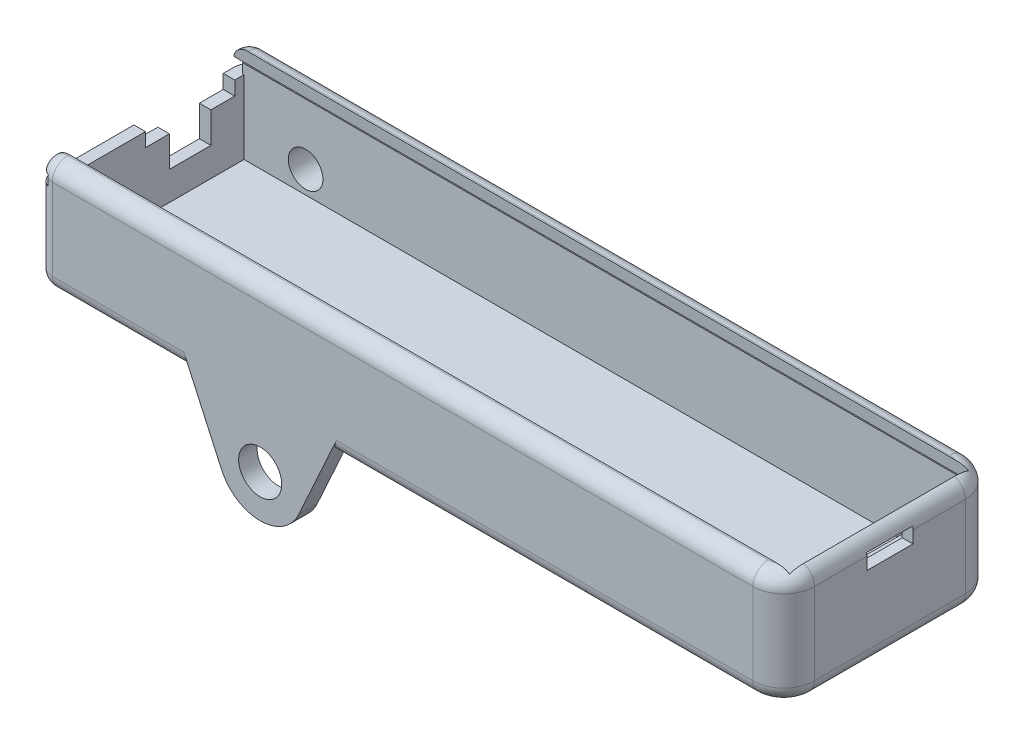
ISO-10303-21;
HEADER;
FILE_DESCRIPTION(('STEP AP214'),'2;1');
FILE_NAME('part.step','',(''),(''),'','','');
FILE_SCHEMA(('AUTOMOTIVE_DESIGN { 1 0 10303 214 1 1 1 1 }'));
ENDSEC;
DATA;
#1=APPLICATION_CONTEXT('core data for automotive mechanical design processes');
#2=APPLICATION_PROTOCOL_DEFINITION('international standard','automotive_design',2000,#1);
#3=PRODUCT_CONTEXT('',#1,'mechanical');
#4=PRODUCT('Part','Part','',(#3));
#5=PRODUCT_RELATED_PRODUCT_CATEGORY('part','',(#4));
#6=PRODUCT_DEFINITION_FORMATION('','',#4);
#7=PRODUCT_DEFINITION_CONTEXT('part definition',#1,'design');
#8=PRODUCT_DEFINITION('design','',#6,#7);
#9=PRODUCT_DEFINITION_SHAPE('','',#8);
#10=(LENGTH_UNIT() NAMED_UNIT(*) SI_UNIT(.MILLI.,.METRE.));
#11=(NAMED_UNIT(*) PLANE_ANGLE_UNIT() SI_UNIT($,.RADIAN.));
#12=(NAMED_UNIT(*) SI_UNIT($,.STERADIAN.) SOLID_ANGLE_UNIT());
#13=UNCERTAINTY_MEASURE_WITH_UNIT(LENGTH_MEASURE(1.E-05),#10,'distance_accuracy_value','');
#14=(GEOMETRIC_REPRESENTATION_CONTEXT(3) GLOBAL_UNCERTAINTY_ASSIGNED_CONTEXT((#13)) GLOBAL_UNIT_ASSIGNED_CONTEXT((#10,
#11,#12)) REPRESENTATION_CONTEXT('',''));
#15=CARTESIAN_POINT('',(0.,0.,0.));
#16=DIRECTION('',(0.,0.,1.));
#17=DIRECTION('',(1.,0.,0.));
#18=AXIS2_PLACEMENT_3D('',#15,#16,#17);
#19=CARTESIAN_POINT('',(118.11,16.002,-29.972));
#20=DIRECTION('',(0.,-1.,0.));
#21=DIRECTION('',(0.,0.,-1.));
#22=AXIS2_PLACEMENT_3D('',#19,#20,#21);
#23=DEGENERATE_TOROIDAL_SURFACE('',#22,2.54,2.54,.T.);
#24=CARTESIAN_POINT('',(118.11,18.542,-29.972));
#25=DIRECTION('',(0.,-1.,0.));
#26=DIRECTION('',(0.,0.,-1.));
#27=AXIS2_PLACEMENT_3D('',#24,#25,#26);
#28=CIRCLE('',#27,2.54);
#29=CARTESIAN_POINT('',(119.217160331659,18.542,-32.258));
#30=VERTEX_POINT('',#29);
#31=CARTESIAN_POINT('',(118.11,18.542,-32.512));
#32=VERTEX_POINT('',#31);
#33=EDGE_CURVE('E601',#30,#32,#28,.F.);
#34=ORIENTED_EDGE('',*,*,#33,.F.);
#35=CARTESIAN_POINT('',(118.1098,18.5293788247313,-32.2591042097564));
#36=CARTESIAN_POINT('',(118.158410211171,18.529373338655,-32.2591046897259));
#37=CARTESIAN_POINT('',(118.207020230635,18.5295322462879,-32.2590907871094));
#38=CARTESIAN_POINT('',(118.30423733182,18.5301359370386,-32.2590379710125));
#39=CARTESIAN_POINT('',(118.352844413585,18.5305807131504,-32.2589990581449));
#40=CARTESIAN_POINT('',(118.498663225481,18.5322795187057,-32.2588504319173));
#41=CARTESIAN_POINT('',(118.595870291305,18.5338980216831,-32.2587088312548));
#42=CARTESIAN_POINT('',(118.791248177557,18.5373088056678,-32.2584104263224));
#43=CARTESIAN_POINT('',(118.889418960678,18.5391026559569,-32.2582534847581));
#44=CARTESIAN_POINT('',(119.085778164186,18.5416218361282,-32.2580330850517));
#45=CARTESIAN_POINT('',(119.183966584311,18.5423471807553,-32.2579696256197));
#46=CARTESIAN_POINT('',(119.376242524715,18.5413429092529,-32.2580574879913));
#47=CARTESIAN_POINT('',(119.470330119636,18.5397145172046,-32.2581999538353));
#48=CARTESIAN_POINT('',(119.658398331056,18.532915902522,-32.2587947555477));
#49=CARTESIAN_POINT('',(119.75237894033,18.5277454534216,-32.2592471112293));
#50=CARTESIAN_POINT('',(119.939585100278,18.512683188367,-32.2605648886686));
#51=CARTESIAN_POINT('',(120.032812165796,18.5028110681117,-32.2614285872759));
#52=CARTESIAN_POINT('',(120.218457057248,18.4772709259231,-32.2636630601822));
#53=CARTESIAN_POINT('',(120.310875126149,18.4616047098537,-32.2650336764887));
#54=CARTESIAN_POINT('',(120.490606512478,18.4243108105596,-32.2682964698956));
#55=CARTESIAN_POINT('',(120.577974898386,18.4029505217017,-32.2701652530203));
#56=CARTESIAN_POINT('',(120.75077785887,18.3533545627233,-32.2745043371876));
#57=CARTESIAN_POINT('',(120.836211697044,18.3251163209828,-32.2769748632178));
#58=CARTESIAN_POINT('',(121.005769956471,18.2606951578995,-32.2826109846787));
#59=CARTESIAN_POINT('',(121.089844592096,18.2243807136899,-32.2857880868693));
#60=CARTESIAN_POINT('',(121.254175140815,18.1437995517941,-32.2928380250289));
#61=CARTESIAN_POINT('',(121.334426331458,18.0995233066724,-32.2967116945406));
#62=CARTESIAN_POINT('',(121.4122,18.0511551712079,-32.3009433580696));
#63=B_SPLINE_CURVE_WITH_KNOTS('',3,(#35,#36,#37,#38,#39,#40,#41,#42,#43,#44,#45,#46,#47,#48,#49,
#50,#51,#52,#53,#54,#55,#56,#57,#58,#59,#60,#61,#62),.UNSPECIFIED.,.F.,.F.,(4,2,2,2,2,2,2,2,2,2,
2,2,2,4),(0.,0.145830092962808,0.291656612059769,0.583316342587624,0.877878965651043,
1.17243752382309,1.45469902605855,1.73697857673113,2.0180858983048,2.29910568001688,
2.56873411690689,2.83846352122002,3.11295738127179,3.38778192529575),.UNSPECIFIED.);
#64=CARTESIAN_POINT('',(121.412,18.0512794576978,-32.3009324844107));
#65=VERTEX_POINT('',#64);
#66=EDGE_CURVE('E603',#30,#65,#63,.T.);
#67=ORIENTED_EDGE('',*,*,#66,.T.);
#68=CARTESIAN_POINT('',(121.412,18.3156142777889,-31.3763504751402));
#69=CARTESIAN_POINT('',(121.412,18.2942935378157,-31.4965600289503));
#70=CARTESIAN_POINT('',(121.412,18.2690628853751,-31.6160852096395));
#71=CARTESIAN_POINT('',(121.412,18.2091212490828,-31.8528284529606));
#72=CARTESIAN_POINT('',(121.412,18.1744075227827,-31.9700458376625));
#73=CARTESIAN_POINT('',(121.412,18.0940532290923,-32.2002765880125));
#74=CARTESIAN_POINT('',(121.412,18.0484517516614,-32.3133033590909));
#75=CARTESIAN_POINT('',(121.412,17.9449662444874,-32.5335118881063));
#76=CARTESIAN_POINT('',(121.412,17.8870954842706,-32.6406998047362));
#77=CARTESIAN_POINT('',(121.412,17.7520430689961,-32.8566051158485));
#78=CARTESIAN_POINT('',(121.412,17.6735585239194,-32.9645213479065));
#79=CARTESIAN_POINT('',(121.412,17.5004665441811,-33.1666889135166));
#80=CARTESIAN_POINT('',(121.412,17.4058610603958,-33.2609418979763));
#81=CARTESIAN_POINT('',(121.412,17.2007522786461,-33.4322074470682));
#82=CARTESIAN_POINT('',(121.412,17.0901320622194,-33.5090815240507));
#83=CARTESIAN_POINT('',(121.412,16.856225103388,-33.6403529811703));
#84=CARTESIAN_POINT('',(121.412,16.7329468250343,-33.6947652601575));
#85=CARTESIAN_POINT('',(121.412,16.4920998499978,-33.7731380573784));
#86=CARTESIAN_POINT('',(121.412,16.3754086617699,-33.7998018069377));
#87=CARTESIAN_POINT('',(121.412,16.1391244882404,-33.83125448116));
#88=CARTESIAN_POINT('',(121.412,16.0195329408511,-33.8360540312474));
#89=CARTESIAN_POINT('',(121.412,15.7911479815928,-33.8240462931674));
#90=CARTESIAN_POINT('',(121.412,15.6822602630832,-33.8089471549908));
#91=CARTESIAN_POINT('',(121.412,15.4685666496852,-33.7607835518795));
#92=CARTESIAN_POINT('',(121.412,15.3637601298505,-33.7277218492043));
#93=CARTESIAN_POINT('',(121.412,15.1602197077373,-33.6448244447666));
#94=CARTESIAN_POINT('',(121.412,15.0615317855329,-33.5948765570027));
#95=CARTESIAN_POINT('',(121.412,14.8730926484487,-33.4803246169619));
#96=CARTESIAN_POINT('',(121.412,14.7833442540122,-33.4157159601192));
#97=CARTESIAN_POINT('',(121.412,14.6071471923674,-33.2683227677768));
#98=CARTESIAN_POINT('',(121.412,14.5215936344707,-33.1844735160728));
#99=CARTESIAN_POINT('',(121.412,14.3634114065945,-33.0054160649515));
#100=CARTESIAN_POINT('',(121.412,14.2907865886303,-32.910204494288));
#101=CARTESIAN_POINT('',(121.412,14.1742751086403,-32.735147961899));
#102=CARTESIAN_POINT('',(121.412,14.1276706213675,-32.657079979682));
#103=CARTESIAN_POINT('',(121.412,14.0415723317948,-32.4970960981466));
#104=CARTESIAN_POINT('',(121.412,14.0020818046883,-32.4151784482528));
#105=CARTESIAN_POINT('',(121.412,13.8935416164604,-32.1648695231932));
#106=CARTESIAN_POINT('',(121.412,13.8345322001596,-31.9920927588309));
#107=CARTESIAN_POINT('',(121.412,13.7429085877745,-31.6571176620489));
#108=CARTESIAN_POINT('',(121.412,13.7083636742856,-31.4954109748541));
#109=CARTESIAN_POINT('',(121.412,13.6532008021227,-31.1695229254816));
#110=CARTESIAN_POINT('',(121.412,13.632599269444,-31.0053388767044));
#111=CARTESIAN_POINT('',(121.412,13.6017913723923,-30.6751800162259));
#112=CARTESIAN_POINT('',(121.412,13.5916417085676,-30.5092003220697));
#113=CARTESIAN_POINT('',(121.412,13.5796199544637,-30.17703621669));
#114=CARTESIAN_POINT('',(121.412,13.5777441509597,-30.0108519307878));
#115=CARTESIAN_POINT('',(121.412,13.5816683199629,-29.6885636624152));
#116=CARTESIAN_POINT('',(121.412,13.5870136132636,-29.5324542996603));
#117=CARTESIAN_POINT('',(121.412,13.6057704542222,-29.2206273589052));
#118=CARTESIAN_POINT('',(121.412,13.6191850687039,-29.0649099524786));
#119=CARTESIAN_POINT('',(121.412,13.6563828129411,-28.755717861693));
#120=CARTESIAN_POINT('',(121.412,13.6800954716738,-28.6022351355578));
#121=CARTESIAN_POINT('',(121.412,13.741009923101,-28.2979898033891));
#122=CARTESIAN_POINT('',(121.412,13.7782002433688,-28.1472249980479));
#123=CARTESIAN_POINT('',(121.412,13.8698150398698,-27.8494602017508));
#124=CARTESIAN_POINT('',(121.412,13.9243855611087,-27.702503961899));
#125=CARTESIAN_POINT('',(121.412,14.0538599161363,-27.4173482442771));
#126=CARTESIAN_POINT('',(121.412,14.1287812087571,-27.2791564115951));
#127=CARTESIAN_POINT('',(121.412,14.2581918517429,-27.0819397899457));
#128=CARTESIAN_POINT('',(121.412,14.304521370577,-27.0174978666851));
#129=CARTESIAN_POINT('',(121.412,14.4028718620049,-26.8931363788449));
#130=CARTESIAN_POINT('',(121.412,14.454889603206,-26.8332142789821));
#131=CARTESIAN_POINT('',(121.412,14.5644830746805,-26.7188087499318));
#132=CARTESIAN_POINT('',(121.412,14.6220517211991,-26.6643185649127));
#133=CARTESIAN_POINT('',(121.412,14.7424950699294,-26.56161221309));
#134=CARTESIAN_POINT('',(121.412,14.8053676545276,-26.513393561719));
#135=CARTESIAN_POINT('',(121.412,14.9655058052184,-26.4039383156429));
#136=CARTESIAN_POINT('',(121.412,15.0655071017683,-26.3466208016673));
#137=CARTESIAN_POINT('',(121.412,15.273662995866,-26.2495387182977));
#138=CARTESIAN_POINT('',(121.412,15.3818137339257,-26.2097659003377));
#139=CARTESIAN_POINT('',(121.412,15.6037522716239,-26.149530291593));
#140=CARTESIAN_POINT('',(121.412,15.7175557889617,-26.1291249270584));
#141=CARTESIAN_POINT('',(121.412,15.9469843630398,-26.1088910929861));
#142=CARTESIAN_POINT('',(121.412,16.0626092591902,-26.1090608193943));
#143=CARTESIAN_POINT('',(121.412,16.2859730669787,-26.1294058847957));
#144=CARTESIAN_POINT('',(121.412,16.3938089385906,-26.1485382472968));
#145=CARTESIAN_POINT('',(121.412,16.6047942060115,-26.2043717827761));
#146=CARTESIAN_POINT('',(121.412,16.7079441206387,-26.2410710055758));
#147=CARTESIAN_POINT('',(121.412,16.9086137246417,-26.3311533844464));
#148=CARTESIAN_POINT('',(121.412,17.0060179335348,-26.3847923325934));
#149=CARTESIAN_POINT('',(121.412,17.1914257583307,-26.5063754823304));
#150=CARTESIAN_POINT('',(121.412,17.2794254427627,-26.5743256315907));
#151=CARTESIAN_POINT('',(121.412,17.4523445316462,-26.7288668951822));
#152=CARTESIAN_POINT('',(121.412,17.5362419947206,-26.8165958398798));
#153=CARTESIAN_POINT('',(121.412,17.6906811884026,-27.0030044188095));
#154=CARTESIAN_POINT('',(121.412,17.7612230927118,-27.1016839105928));
#155=CARTESIAN_POINT('',(121.412,17.8750540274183,-27.2843658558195));
#156=CARTESIAN_POINT('',(121.412,17.9209203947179,-27.3667907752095));
#157=CARTESIAN_POINT('',(121.412,18.0051521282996,-27.5354106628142));
#158=CARTESIAN_POINT('',(121.412,18.0435137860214,-27.6216074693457));
#159=CARTESIAN_POINT('',(121.412,18.1483370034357,-27.8848131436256));
#160=CARTESIAN_POINT('',(121.412,18.2042936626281,-28.0660287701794));
#161=CARTESIAN_POINT('',(121.412,18.2917519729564,-28.4247932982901));
#162=CARTESIAN_POINT('',(121.412,18.3242846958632,-28.6021105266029));
#163=CARTESIAN_POINT('',(121.412,18.3743812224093,-28.9590088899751));
#164=CARTESIAN_POINT('',(121.412,18.391924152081,-29.1385928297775));
#165=CARTESIAN_POINT('',(121.412,18.4099309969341,-29.4085176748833));
#166=CARTESIAN_POINT('',(121.412,18.4145488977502,-29.4986258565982));
#167=CARTESIAN_POINT('',(121.412,18.4212988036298,-29.6789354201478));
#168=CARTESIAN_POINT('',(121.412,18.4234309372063,-29.769136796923));
#169=CARTESIAN_POINT('',(121.412,18.4253696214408,-29.9495024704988));
#170=CARTESIAN_POINT('',(121.412,18.4251777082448,-30.039666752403));
#171=CARTESIAN_POINT('',(121.412,18.4224564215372,-30.2199560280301));
#172=CARTESIAN_POINT('',(121.412,18.4199271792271,-30.310081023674));
#173=CARTESIAN_POINT('',(121.412,18.4127006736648,-30.4818844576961));
#174=CARTESIAN_POINT('',(121.412,18.4082259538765,-30.5635719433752));
#175=CARTESIAN_POINT('',(121.412,18.3969535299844,-30.7267766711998));
#176=CARTESIAN_POINT('',(121.412,18.3901559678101,-30.8082939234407));
#177=CARTESIAN_POINT('',(121.412,18.3657766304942,-31.0526330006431));
#178=CARTESIAN_POINT('',(121.412,18.3442128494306,-31.2151074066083));
#179=CARTESIAN_POINT('',(121.412,18.3156142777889,-31.3763504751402));
#180=B_SPLINE_CURVE_WITH_KNOTS('',3,(#68,#69,#70,#71,#72,#73,#74,#75,#76,#77,#78,#79,#80,#81,
#82,#83,#84,#85,#86,#87,#88,#89,#90,#91,#92,#93,#94,#95,#96,#97,#98,#99,#100,#101,#102,#103,
#104,#105,#106,#107,#108,#109,#110,#111,#112,#113,#114,#115,#116,#117,#118,#119,#120,#121,#122,
#123,#124,#125,#126,#127,#128,#129,#130,#131,#132,#133,#134,#135,#136,#137,#138,#139,#140,#141,
#142,#143,#144,#145,#146,#147,#148,#149,#150,#151,#152,#153,#154,#155,#156,#157,#158,#159,#160,
#161,#162,#163,#164,#165,#166,#167,#168,#169,#170,#171,#172,#173,#174,#175,#176,#177,#178,#179),
.UNSPECIFIED.,.T.,.F.,(4,2,2,2,2,2,2,2,2,2,2,2,2,2,2,2,2,2,2,2,2,2,2,2,2,2,2,2,2,2,2,2,2,2,2,2,
2,2,2,2,2,2,2,2,2,2,2,2,2,2,2,2,2,2,2,4),(0.,0.366173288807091,0.732452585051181,
1.09743610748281,1.46202688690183,1.86084650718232,2.2596178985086,2.66146299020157,
3.06304110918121,3.42018599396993,3.77715729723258,4.10539409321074,4.433580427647,
4.76399142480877,5.09450633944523,5.45250762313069,5.8106153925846,6.08300465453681,
6.35551900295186,6.90114685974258,7.39651326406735,7.89246222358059,8.39108771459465,
8.88948940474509,9.35792775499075,9.82654425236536,10.292003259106,10.7570669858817,
11.2261465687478,11.6956298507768,11.9334538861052,12.171143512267,12.4085337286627,
12.6458296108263,12.9900091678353,13.3340267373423,13.6790611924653,14.0240653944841,
14.3510910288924,14.6780803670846,15.0102645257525,15.342587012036,15.7053748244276,
16.0681579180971,16.350746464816,16.6334743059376,17.2003382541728,17.740403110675,
18.2812188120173,18.551876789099,18.8225207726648,19.0929858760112,19.3634357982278,
19.6088320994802,19.854213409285,20.345379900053),.UNSPECIFIED.);
#181=CARTESIAN_POINT('',(121.412,18.425005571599,-29.972));
#182=VERTEX_POINT('',#181);
#183=EDGE_CURVE('E496',#182,#65,#180,.T.);
#184=ORIENTED_EDGE('',*,*,#183,.F.);
#185=CARTESIAN_POINT('',(120.65,16.002,-29.972));
#186=DIRECTION('',(0.,0.,1.));
#187=DIRECTION('',(1.,0.,0.));
#188=AXIS2_PLACEMENT_3D('',#185,#186,#187);
#189=CIRCLE('',#188,2.54);
#190=CARTESIAN_POINT('',(123.19,16.002,-29.972));
#191=VERTEX_POINT('',#190);
#192=EDGE_CURVE('E1118',#191,#182,#189,.T.);
#193=ORIENTED_EDGE('',*,*,#192,.F.);
#194=CARTESIAN_POINT('',(118.11,16.002,-29.972));
#195=DIRECTION('',(0.,-1.,0.));
#196=DIRECTION('',(0.,0.,-1.));
#197=AXIS2_PLACEMENT_3D('',#194,#195,#196);
#198=CIRCLE('',#197,5.08);
#199=CARTESIAN_POINT('',(118.11,16.002,-35.052));
#200=VERTEX_POINT('',#199);
#201=EDGE_CURVE('E639',#200,#191,#198,.T.);
#202=ORIENTED_EDGE('',*,*,#201,.F.);
#203=CARTESIAN_POINT('',(118.11,16.002,-32.512));
#204=DIRECTION('',(1.,0.,0.));
#205=DIRECTION('',(0.,0.,-1.));
#206=AXIS2_PLACEMENT_3D('',#203,#204,#205);
#207=CIRCLE('',#206,2.54);
#208=EDGE_CURVE('E606',#200,#32,#207,.T.);
#209=ORIENTED_EDGE('',*,*,#208,.T.);
#210=EDGE_LOOP('',(#34,#67,#184,#193,#202,#209));
#211=FACE_BOUND('',#210,.T.);
#212=ADVANCED_FACE('F28',(#211),#23,.T.);
#213=CARTESIAN_POINT('',(2.54,16.002,0.));
#214=DIRECTION('',(0.,0.,1.));
#215=DIRECTION('',(1.,0.,0.));
#216=AXIS2_PLACEMENT_3D('',#213,#214,#215);
#217=CYLINDRICAL_SURFACE('',#216,2.54);
#218=DIRECTION('',(0.,0.,1.));
#219=VECTOR('',#218,1.);
#220=CARTESIAN_POINT('',(0.0513184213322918,16.51,0.));
#221=LINE('',#220,#219);
#222=CARTESIAN_POINT('',(0.0513184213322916,16.51,-32.512));
#223=VERTEX_POINT('',#222);
#224=CARTESIAN_POINT('',(0.051318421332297,16.51,-32.4357769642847));
#225=VERTEX_POINT('',#224);
#226=EDGE_CURVE('E1180',#223,#225,#221,.T.);
#227=ORIENTED_EDGE('',*,*,#226,.T.);
#228=CARTESIAN_POINT('',(2.54,16.002,-32.4802212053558));
#229=DIRECTION('',(0.,-0.087155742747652,0.996194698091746));
#230=DIRECTION('',(0.,0.996194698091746,0.087155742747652));
#231=AXIS2_PLACEMENT_3D('',#228,#229,#230);
#232=ELLIPSE('',#231,2.5497023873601,2.54);
#233=CARTESIAN_POINT('',(2.54,18.542,-32.258));
#234=VERTEX_POINT('',#233);
#235=EDGE_CURVE('E1279',#225,#234,#232,.F.);
#236=ORIENTED_EDGE('',*,*,#235,.T.);
#237=DIRECTION('',(0.,0.,-1.));
#238=VECTOR('',#237,1.);
#239=CARTESIAN_POINT('',(2.54,18.542,0.));
#240=LINE('',#239,#238);
#241=CARTESIAN_POINT('',(2.54,18.542,-32.512));
#242=VERTEX_POINT('',#241);
#243=EDGE_CURVE('E610',#242,#234,#240,.F.);
#244=ORIENTED_EDGE('',*,*,#243,.F.);
#245=CARTESIAN_POINT('',(2.54,16.002,-32.512));
#246=DIRECTION('',(0.,0.,1.));
#247=DIRECTION('',(1.,0.,0.));
#248=AXIS2_PLACEMENT_3D('',#245,#246,#247);
#249=CIRCLE('',#248,2.54);
#250=EDGE_CURVE('E1121',#242,#223,#249,.T.);
#251=ORIENTED_EDGE('',*,*,#250,.T.);
#252=EDGE_LOOP('',(#227,#236,#244,#251));
#253=FACE_BOUND('',#252,.T.);
#254=ADVANCED_FACE('F591',(#253),#217,.T.);
#255=CARTESIAN_POINT('',(123.19,18.542,-32.258));
#256=DIRECTION('',(0.,0.,1.));
#257=DIRECTION('',(1.,0.,0.));
#258=AXIS2_PLACEMENT_3D('',#255,#256,#257);
#259=PLANE('',#258);
#260=CARTESIAN_POINT('',(12.065,6.477,-32.258));
#261=DIRECTION('',(0.,0.,1.));
#262=DIRECTION('',(1.,0.,0.));
#263=AXIS2_PLACEMENT_3D('',#260,#261,#262);
#264=CIRCLE('',#263,2.8575);
#265=CARTESIAN_POINT('',(14.9225,6.477,-32.258));
#266=VERTEX_POINT('',#265);
#267=EDGE_CURVE('E1313',#266,#266,#264,.F.);
#268=ORIENTED_EDGE('',*,*,#267,.T.);
#269=EDGE_LOOP('',(#268));
#270=FACE_BOUND('',#269,.T.);
#271=DIRECTION('',(0.,1.,0.));
#272=VECTOR('',#271,1.);
#273=CARTESIAN_POINT('',(121.412,13.462,-32.258));
#274=LINE('',#273,#272);
#275=CARTESIAN_POINT('',(121.412,13.462,-32.258));
#276=VERTEX_POINT('',#275);
#277=CARTESIAN_POINT('',(121.412,16.51,-32.258));
#278=VERTEX_POINT('',#277);
#279=EDGE_CURVE('E485',#276,#278,#274,.T.);
#280=ORIENTED_EDGE('',*,*,#279,.T.);
#281=DIRECTION('',(-1.,0.,0.));
#282=VECTOR('',#281,1.);
#283=CARTESIAN_POINT('',(123.451761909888,16.51,-32.258));
#284=LINE('',#283,#282);
#285=CARTESIAN_POINT('',(1.651,16.51,-32.258));
#286=VERTEX_POINT('',#285);
#287=EDGE_CURVE('E468',#278,#286,#284,.T.);
#288=ORIENTED_EDGE('',*,*,#287,.T.);
#289=DIRECTION('',(0.,-1.,0.));
#290=VECTOR('',#289,1.);
#291=CARTESIAN_POINT('',(1.651,18.542,-32.258));
#292=LINE('',#291,#290);
#293=CARTESIAN_POINT('',(1.651,14.9053444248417,-32.258));
#294=VERTEX_POINT('',#293);
#295=EDGE_CURVE('E1167',#286,#294,#292,.T.);
#296=ORIENTED_EDGE('',*,*,#295,.T.);
#297=DIRECTION('',(1.,0.,0.));
#298=VECTOR('',#297,1.);
#299=CARTESIAN_POINT('',(0.,14.9053444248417,-32.258));
#300=LINE('',#299,#298);
#301=CARTESIAN_POINT('',(1.905,14.9053444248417,-32.258));
#302=VERTEX_POINT('',#301);
#303=EDGE_CURVE('E1104',#294,#302,#300,.T.);
#304=ORIENTED_EDGE('',*,*,#303,.T.);
#305=DIRECTION('',(0.,-1.,0.));
#306=VECTOR('',#305,1.);
#307=CARTESIAN_POINT('',(1.905,18.542,-32.258));
#308=LINE('',#307,#306);
#309=CARTESIAN_POINT('',(1.905,2.794,-32.258));
#310=VERTEX_POINT('',#309);
#311=EDGE_CURVE('E1268',#302,#310,#308,.T.);
#312=ORIENTED_EDGE('',*,*,#311,.T.);
#313=DIRECTION('',(-1.,0.,0.));
#314=VECTOR('',#313,1.);
#315=CARTESIAN_POINT('',(0.,2.794,-32.258));
#316=LINE('',#315,#314);
#317=CARTESIAN_POINT('',(120.396,2.794,-32.258));
#318=VERTEX_POINT('',#317);
#319=EDGE_CURVE('E1274',#318,#310,#316,.T.);
#320=ORIENTED_EDGE('',*,*,#319,.F.);
#321=DIRECTION('',(0.,-1.,0.));
#322=VECTOR('',#321,1.);
#323=CARTESIAN_POINT('',(120.396,18.542,-32.258));
#324=LINE('',#323,#322);
#325=CARTESIAN_POINT('',(120.396,13.462,-32.258));
#326=VERTEX_POINT('',#325);
#327=EDGE_CURVE('E1264',#326,#318,#324,.T.);
#328=ORIENTED_EDGE('',*,*,#327,.F.);
#329=DIRECTION('',(1.,0.,0.));
#330=VECTOR('',#329,1.);
#331=CARTESIAN_POINT('',(120.396,13.462,-32.258));
#332=LINE('',#331,#330);
#333=EDGE_CURVE('E492',#326,#276,#332,.T.);
#334=ORIENTED_EDGE('',*,*,#333,.T.);
#335=EDGE_LOOP('',(#280,#288,#296,#304,#312,#320,#328,#334));
#336=FACE_BOUND('',#335,.T.);
#337=ADVANCED_FACE('F490',(#270,#336),#259,.T.);
#338=CARTESIAN_POINT('',(1.651,16.51,-35.052));
#339=DIRECTION('',(0.,-1.,0.));
#340=DIRECTION('',(0.,0.,-1.));
#341=AXIS2_PLACEMENT_3D('',#338,#339,#340);
#342=PLANE('',#341);
#343=DIRECTION('',(0.,0.,1.));
#344=VECTOR('',#343,1.);
#345=CARTESIAN_POINT('',(1.651,16.51,-35.052));
#346=LINE('',#345,#344);
#347=CARTESIAN_POINT('',(1.651,16.51,-34.8364816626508));
#348=VERTEX_POINT('',#347);
#349=CARTESIAN_POINT('',(1.651,16.51,-32.4357769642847));
#350=VERTEX_POINT('',#349);
#351=EDGE_CURVE('E1161',#348,#350,#346,.T.);
#352=ORIENTED_EDGE('',*,*,#351,.T.);
#353=DIRECTION('',(-1.,0.,0.));
#354=VECTOR('',#353,1.);
#355=CARTESIAN_POINT('',(123.451761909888,16.51,-32.4357769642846));
#356=LINE('',#355,#354);
#357=EDGE_CURVE('E1292',#350,#225,#356,.T.);
#358=ORIENTED_EDGE('',*,*,#357,.T.);
#359=ORIENTED_EDGE('',*,*,#226,.F.);
#360=CARTESIAN_POINT('',(2.54,16.51,-32.512));
#361=DIRECTION('',(0.,-1.,0.));
#362=DIRECTION('',(0.,0.,-1.));
#363=AXIS2_PLACEMENT_3D('',#360,#361,#362);
#364=CIRCLE('',#363,2.48868157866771);
#365=EDGE_CURVE('E1177',#348,#223,#364,.F.);
#366=ORIENTED_EDGE('',*,*,#365,.F.);
#367=EDGE_LOOP('',(#352,#358,#359,#366));
#368=FACE_BOUND('',#367,.T.);
#369=ADVANCED_FACE('F814',(#368),#342,.T.);
#370=CARTESIAN_POINT('',(123.19,18.542,-35.052));
#371=DIRECTION('',(1.,0.,0.));
#372=DIRECTION('',(0.,0.,-1.));
#373=AXIS2_PLACEMENT_3D('',#370,#371,#372);
#374=PLANE('',#373);
#375=DIRECTION('',(0.,0.,1.));
#376=VECTOR('',#375,1.);
#377=CARTESIAN_POINT('',(123.19,16.002,-35.052));
#378=LINE('',#377,#376);
#379=CARTESIAN_POINT('',(123.19,16.002,-21.336));
#380=VERTEX_POINT('',#379);
#381=EDGE_CURVE('E636',#191,#380,#378,.T.);
#382=ORIENTED_EDGE('',*,*,#381,.T.);
#383=DIRECTION('',(0.,1.,0.));
#384=VECTOR('',#383,1.);
#385=CARTESIAN_POINT('',(123.19,13.97,-21.336));
#386=LINE('',#385,#384);
#387=CARTESIAN_POINT('',(123.19,13.97,-21.336));
#388=VERTEX_POINT('',#387);
#389=EDGE_CURVE('E1434',#388,#380,#386,.T.);
#390=ORIENTED_EDGE('',*,*,#389,.F.);
#391=DIRECTION('',(0.,0.,1.));
#392=VECTOR('',#391,1.);
#393=CARTESIAN_POINT('',(123.19,13.97,-21.336));
#394=LINE('',#393,#392);
#395=CARTESIAN_POINT('',(123.19,13.97,-13.716));
#396=VERTEX_POINT('',#395);
#397=EDGE_CURVE('E1438',#388,#396,#394,.T.);
#398=ORIENTED_EDGE('',*,*,#397,.T.);
#399=DIRECTION('',(0.,-1.,0.));
#400=VECTOR('',#399,1.);
#401=CARTESIAN_POINT('',(123.19,16.51,-13.716));
#402=LINE('',#401,#400);
#403=CARTESIAN_POINT('',(123.19,16.002,-13.716));
#404=VERTEX_POINT('',#403);
#405=EDGE_CURVE('E1436',#404,#396,#402,.T.);
#406=ORIENTED_EDGE('',*,*,#405,.F.);
#407=CARTESIAN_POINT('',(123.19,16.002,-5.08));
#408=VERTEX_POINT('',#407);
#409=EDGE_CURVE('E635',#404,#408,#378,.T.);
#410=ORIENTED_EDGE('',*,*,#409,.T.);
#411=DIRECTION('',(0.,-1.,0.));
#412=VECTOR('',#411,1.);
#413=CARTESIAN_POINT('',(123.19,18.542,-5.08));
#414=LINE('',#413,#412);
#415=CARTESIAN_POINT('',(123.19,2.54,-5.08));
#416=VERTEX_POINT('',#415);
#417=EDGE_CURVE('E1083',#408,#416,#414,.T.);
#418=ORIENTED_EDGE('',*,*,#417,.T.);
#419=DIRECTION('',(0.,0.,1.));
#420=VECTOR('',#419,1.);
#421=CARTESIAN_POINT('',(123.19,2.54,-35.052));
#422=LINE('',#421,#420);
#423=CARTESIAN_POINT('',(123.19,2.54,-29.972));
#424=VERTEX_POINT('',#423);
#425=EDGE_CURVE('E959',#416,#424,#422,.F.);
#426=ORIENTED_EDGE('',*,*,#425,.T.);
#427=DIRECTION('',(0.,-1.,0.));
#428=VECTOR('',#427,1.);
#429=CARTESIAN_POINT('',(123.19,18.542,-29.972));
#430=LINE('',#429,#428);
#431=EDGE_CURVE('E1080',#424,#191,#430,.F.);
#432=ORIENTED_EDGE('',*,*,#431,.T.);
#433=EDGE_LOOP('',(#382,#390,#398,#406,#410,#418,#426,#432));
#434=FACE_BOUND('',#433,.T.);
#435=ADVANCED_FACE('F832',(#434),#374,.T.);
#436=CARTESIAN_POINT('',(120.65,16.002,-35.052));
#437=DIRECTION('',(0.,0.,-1.));
#438=DIRECTION('',(-1.,0.,0.));
#439=AXIS2_PLACEMENT_3D('',#436,#437,#438);
#440=CYLINDRICAL_SURFACE('',#439,2.54);
#441=DIRECTION('',(0.,0.,-1.));
#442=VECTOR('',#441,1.);
#443=CARTESIAN_POINT('',(123.138681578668,16.51,-35.052));
#444=LINE('',#443,#442);
#445=CARTESIAN_POINT('',(123.138681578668,16.51,-21.336));
#446=VERTEX_POINT('',#445);
#447=CARTESIAN_POINT('',(123.138681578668,16.51,-13.716));
#448=VERTEX_POINT('',#447);
#449=EDGE_CURVE('E1452',#446,#448,#444,.F.);
#450=ORIENTED_EDGE('',*,*,#449,.F.);
#451=CARTESIAN_POINT('',(120.65,16.002,-21.336));
#452=DIRECTION('',(0.,0.,1.));
#453=DIRECTION('',(1.,0.,0.));
#454=AXIS2_PLACEMENT_3D('',#451,#452,#453);
#455=CIRCLE('',#454,2.54);
#456=EDGE_CURVE('E1455',#446,#380,#455,.F.);
#457=ORIENTED_EDGE('',*,*,#456,.T.);
#458=ORIENTED_EDGE('',*,*,#381,.F.);
#459=ORIENTED_EDGE('',*,*,#192,.T.);
#460=DIRECTION('',(0.,0.,-1.));
#461=VECTOR('',#460,1.);
#462=CARTESIAN_POINT('',(121.412,18.425005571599,-35.052));
#463=LINE('',#462,#461);
#464=CARTESIAN_POINT('',(121.412,18.425005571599,-5.08));
#465=VERTEX_POINT('',#464);
#466=EDGE_CURVE('E493',#465,#182,#463,.T.);
#467=ORIENTED_EDGE('',*,*,#466,.F.);
#468=CARTESIAN_POINT('',(120.65,16.002,-5.08));
#469=DIRECTION('',(0.,0.,1.));
#470=DIRECTION('',(1.,0.,0.));
#471=AXIS2_PLACEMENT_3D('',#468,#469,#470);
#472=CIRCLE('',#471,2.54);
#473=EDGE_CURVE('E1106',#408,#465,#472,.T.);
#474=ORIENTED_EDGE('',*,*,#473,.F.);
#475=ORIENTED_EDGE('',*,*,#409,.F.);
#476=CARTESIAN_POINT('',(120.65,16.002,-13.716));
#477=DIRECTION('',(0.,0.,-1.));
#478=DIRECTION('',(-1.,0.,0.));
#479=AXIS2_PLACEMENT_3D('',#476,#477,#478);
#480=CIRCLE('',#479,2.54);
#481=EDGE_CURVE('E1450',#404,#448,#480,.F.);
#482=ORIENTED_EDGE('',*,*,#481,.T.);
#483=EDGE_LOOP('',(#450,#457,#458,#459,#467,#474,#475,#482));
#484=FACE_BOUND('',#483,.T.);
#485=ADVANCED_FACE('F518',(#484),#440,.T.);
#486=CARTESIAN_POINT('',(121.412,13.462,-2.794));
#487=DIRECTION('',(1.,0.,0.));
#488=DIRECTION('',(0.,0.,-1.));
#489=AXIS2_PLACEMENT_3D('',#486,#487,#488);
#490=PLANE('',#489);
#491=ORIENTED_EDGE('',*,*,#183,.T.);
#492=DIRECTION('',(0.,0.996194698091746,0.087155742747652));
#493=VECTOR('',#492,1.);
#494=CARTESIAN_POINT('',(121.412,16.51,-32.4357769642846));
#495=LINE('',#494,#493);
#496=CARTESIAN_POINT('',(121.412,16.51,-32.4357769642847));
#497=VERTEX_POINT('',#496);
#498=EDGE_CURVE('E488',#497,#65,#495,.T.);
#499=ORIENTED_EDGE('',*,*,#498,.F.);
#500=DIRECTION('',(0.,0.,-1.));
#501=VECTOR('',#500,1.);
#502=CARTESIAN_POINT('',(121.412,16.51,-32.258));
#503=LINE('',#502,#501);
#504=EDGE_CURVE('E471',#278,#497,#503,.T.);
#505=ORIENTED_EDGE('',*,*,#504,.F.);
#506=ORIENTED_EDGE('',*,*,#279,.F.);
#507=DIRECTION('',(0.,0.,-1.));
#508=VECTOR('',#507,1.);
#509=CARTESIAN_POINT('',(121.412,13.462,-2.794));
#510=LINE('',#509,#508);
#511=CARTESIAN_POINT('',(121.412,13.462,-2.794));
#512=VERTEX_POINT('',#511);
#513=EDGE_CURVE('E1462',#512,#276,#510,.T.);
#514=ORIENTED_EDGE('',*,*,#513,.F.);
#515=DIRECTION('',(0.,1.,0.));
#516=VECTOR('',#515,1.);
#517=CARTESIAN_POINT('',(121.412,13.462,-2.794));
#518=LINE('',#517,#516);
#519=CARTESIAN_POINT('',(121.412,16.51,-2.794));
#520=VERTEX_POINT('',#519);
#521=EDGE_CURVE('E494',#512,#520,#518,.T.);
#522=ORIENTED_EDGE('',*,*,#521,.T.);
#523=DIRECTION('',(0.,0.,1.));
#524=VECTOR('',#523,1.);
#525=CARTESIAN_POINT('',(121.412,16.51,-2.794));
#526=LINE('',#525,#524);
#527=CARTESIAN_POINT('',(121.412,16.51,-2.61622303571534));
#528=VERTEX_POINT('',#527);
#529=EDGE_CURVE('E1301',#520,#528,#526,.T.);
#530=ORIENTED_EDGE('',*,*,#529,.T.);
#531=DIRECTION('',(0.,0.996194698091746,-0.087155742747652));
#532=VECTOR('',#531,1.);
#533=CARTESIAN_POINT('',(121.412,16.51,-2.61622303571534));
#534=LINE('',#533,#532);
#535=CARTESIAN_POINT('',(121.412,18.0512794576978,-2.75106751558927));
#536=VERTEX_POINT('',#535);
#537=EDGE_CURVE('E556',#528,#536,#534,.T.);
#538=ORIENTED_EDGE('',*,*,#537,.T.);
#539=CARTESIAN_POINT('',(121.412,18.3156142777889,-3.67564952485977));
#540=CARTESIAN_POINT('',(121.412,18.3364026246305,-3.79287641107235));
#541=CARTESIAN_POINT('',(121.412,18.3534645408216,-3.91076082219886));
#542=CARTESIAN_POINT('',(121.412,18.3815232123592,-4.14726806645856));
#543=CARTESIAN_POINT('',(121.412,18.3925175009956,-4.26589118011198));
#544=CARTESIAN_POINT('',(121.412,18.4095663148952,-4.50375846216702));
#545=CARTESIAN_POINT('',(121.412,18.4156092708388,-4.62300343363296));
#546=CARTESIAN_POINT('',(121.412,18.4234343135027,-4.86160955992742));
#547=CARTESIAN_POINT('',(121.412,18.4252170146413,-4.98097069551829));
#548=CARTESIAN_POINT('',(121.412,18.4247547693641,-5.21968614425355));
#549=CARTESIAN_POINT('',(121.412,18.4225098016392,-5.3390404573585));
#550=CARTESIAN_POINT('',(121.412,18.4137015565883,-5.57761420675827));
#551=CARTESIAN_POINT('',(121.412,18.4071376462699,-5.69683362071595));
#552=CARTESIAN_POINT('',(121.412,18.3889390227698,-5.93461409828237));
#553=CARTESIAN_POINT('',(121.412,18.3773163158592,-6.05317605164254));
#554=CARTESIAN_POINT('',(121.412,18.3478547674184,-6.28950574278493));
#555=CARTESIAN_POINT('',(121.412,18.3300185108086,-6.40727379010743));
#556=CARTESIAN_POINT('',(121.412,18.2936062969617,-6.60419972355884));
#557=CARTESIAN_POINT('',(121.412,18.2770674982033,-6.68373168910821));
#558=CARTESIAN_POINT('',(121.412,18.2399646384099,-6.84185988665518));
#559=CARTESIAN_POINT('',(121.412,18.219400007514,-6.92045598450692));
#560=CARTESIAN_POINT('',(121.412,18.1510477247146,-7.15394907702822));
#561=CARTESIAN_POINT('',(121.412,18.0965292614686,-7.30697326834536));
#562=CARTESIAN_POINT('',(121.412,17.9652016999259,-7.60562910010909));
#563=CARTESIAN_POINT('',(121.412,17.8881401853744,-7.75115378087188));
#564=CARTESIAN_POINT('',(121.412,17.7544805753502,-7.95769100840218));
#565=CARTESIAN_POINT('',(121.412,17.706898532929,-8.02459743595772));
#566=CARTESIAN_POINT('',(121.412,17.6056463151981,-8.15361436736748));
#567=CARTESIAN_POINT('',(121.412,17.5519781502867,-8.21572644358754));
#568=CARTESIAN_POINT('',(121.412,17.4103880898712,-8.36369573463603));
#569=CARTESIAN_POINT('',(121.412,17.3186942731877,-8.44602067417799));
#570=CARTESIAN_POINT('',(121.412,17.1229896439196,-8.59438223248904));
#571=CARTESIAN_POINT('',(121.412,17.0189873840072,-8.66043006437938));
#572=CARTESIAN_POINT('',(121.412,16.800300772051,-8.77347825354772));
#573=CARTESIAN_POINT('',(121.412,16.685561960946,-8.82037422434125));
#574=CARTESIAN_POINT('',(121.412,16.4493338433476,-8.8920216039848));
#575=CARTESIAN_POINT('',(121.412,16.3278463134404,-8.91677881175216));
#576=CARTESIAN_POINT('',(121.412,16.0935614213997,-8.94155059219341));
#577=CARTESIAN_POINT('',(121.412,15.9809764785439,-8.94360747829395));
#578=CARTESIAN_POINT('',(121.412,15.7571820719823,-8.92816224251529));
#579=CARTESIAN_POINT('',(121.412,15.6459722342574,-8.91066556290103));
#580=CARTESIAN_POINT('',(121.412,15.4313760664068,-8.85776221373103));
#581=CARTESIAN_POINT('',(121.412,15.3278562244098,-8.82289184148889));
#582=CARTESIAN_POINT('',(121.412,15.127758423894,-8.73706481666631));
#583=CARTESIAN_POINT('',(121.412,15.0311806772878,-8.68610767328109));
#584=CARTESIAN_POINT('',(121.412,14.8423470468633,-8.56724710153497));
#585=CARTESIAN_POINT('',(121.412,14.7505433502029,-8.49862830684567));
#586=CARTESIAN_POINT('',(121.412,14.5781449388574,-8.3485427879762));
#587=CARTESIAN_POINT('',(121.412,14.4975579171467,-8.26706732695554));
#588=CARTESIAN_POINT('',(121.412,14.3187693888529,-8.05972503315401));
#589=CARTESIAN_POINT('',(121.412,14.2261591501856,-7.92902515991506));
#590=CARTESIAN_POINT('',(121.412,14.0635404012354,-7.65448257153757));
#591=CARTESIAN_POINT('',(121.412,13.9935515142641,-7.51062858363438));
#592=CARTESIAN_POINT('',(121.412,13.8405624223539,-7.13314946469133));
#593=CARTESIAN_POINT('',(121.412,13.771734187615,-6.89383399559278));
#594=CARTESIAN_POINT('',(121.412,13.6950572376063,-6.52947908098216));
#595=CARTESIAN_POINT('',(121.412,13.6739021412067,-6.40674499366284));
#596=CARTESIAN_POINT('',(121.412,13.6388349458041,-6.16022169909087));
#597=CARTESIAN_POINT('',(121.412,13.6249216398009,-6.03643267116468));
#598=CARTESIAN_POINT('',(121.412,13.6057582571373,-5.82006855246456));
#599=CARTESIAN_POINT('',(121.412,13.5992030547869,-5.72759793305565));
#600=CARTESIAN_POINT('',(121.412,13.5889021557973,-5.54249479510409));
#601=CARTESIAN_POINT('',(121.412,13.5851565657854,-5.4498622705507));
#602=CARTESIAN_POINT('',(121.412,13.5801972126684,-5.26447037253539));
#603=CARTESIAN_POINT('',(121.412,13.5789851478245,-5.17171095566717));
#604=CARTESIAN_POINT('',(121.412,13.5790038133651,-4.98619496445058));
#605=CARTESIAN_POINT('',(121.412,13.5802344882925,-4.89343839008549));
#606=CARTESIAN_POINT('',(121.412,13.5852257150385,-4.70826446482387));
#607=CARTESIAN_POINT('',(121.412,13.5889787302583,-4.61584692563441));
#608=CARTESIAN_POINT('',(121.412,13.5992874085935,-4.43117252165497));
#609=CARTESIAN_POINT('',(121.412,13.6058432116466,-4.3389156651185));
#610=CARTESIAN_POINT('',(121.412,13.6303206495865,-4.06272443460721));
#611=CARTESIAN_POINT('',(121.412,13.653056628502,-3.87913832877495));
#612=CARTESIAN_POINT('',(121.412,13.7001387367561,-3.60763899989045));
#613=CARTESIAN_POINT('',(121.412,13.7177828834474,-3.51856232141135));
#614=CARTESIAN_POINT('',(121.412,13.7580139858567,-3.34153518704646));
#615=CARTESIAN_POINT('',(121.412,13.7806012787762,-3.25358480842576));
#616=CARTESIAN_POINT('',(121.412,13.8567377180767,-2.99239103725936));
#617=CARTESIAN_POINT('',(121.412,13.9187222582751,-2.82141614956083));
#618=CARTESIAN_POINT('',(121.412,14.0580113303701,-2.51762203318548));
#619=CARTESIAN_POINT('',(121.412,14.1313889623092,-2.38302396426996));
#620=CARTESIAN_POINT('',(121.412,14.2992654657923,-2.12750469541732));
#621=CARTESIAN_POINT('',(121.412,14.3937488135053,-2.00657354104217));
#622=CARTESIAN_POINT('',(121.412,14.5835934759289,-1.80575612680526));
#623=CARTESIAN_POINT('',(121.412,14.6753227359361,-1.72244444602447));
#624=CARTESIAN_POINT('',(121.412,14.8713515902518,-1.57212937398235));
#625=CARTESIAN_POINT('',(121.412,14.9756452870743,-1.50511837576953));
#626=CARTESIAN_POINT('',(121.412,15.195119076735,-1.39030327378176));
#627=CARTESIAN_POINT('',(121.412,15.3103551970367,-1.34260541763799));
#628=CARTESIAN_POINT('',(121.412,15.5477393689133,-1.26958410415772));
#629=CARTESIAN_POINT('',(121.412,15.669885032,-1.24425296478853));
#630=CARTESIAN_POINT('',(121.412,15.9049350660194,-1.21871270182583));
#631=CARTESIAN_POINT('',(121.412,16.017607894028,-1.21633532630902));
#632=CARTESIAN_POINT('',(121.412,16.2416324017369,-1.23117819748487));
#633=CARTESIAN_POINT('',(121.412,16.3529844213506,-1.2483932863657));
#634=CARTESIAN_POINT('',(121.412,16.567801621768,-1.30076872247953));
#635=CARTESIAN_POINT('',(121.412,16.6714031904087,-1.33537522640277));
#636=CARTESIAN_POINT('',(121.412,16.8716950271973,-1.42069813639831));
#637=CARTESIAN_POINT('',(121.412,16.968385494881,-1.47141407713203));
#638=CARTESIAN_POINT('',(121.412,17.1574204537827,-1.58977554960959));
#639=CARTESIAN_POINT('',(121.412,17.2493199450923,-1.6581287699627));
#640=CARTESIAN_POINT('',(121.412,17.4219547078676,-1.80771873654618));
#641=CARTESIAN_POINT('',(121.412,17.5026806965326,-1.88896607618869));
#642=CARTESIAN_POINT('',(121.412,17.6816847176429,-2.09563549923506));
#643=CARTESIAN_POINT('',(121.412,17.774409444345,-2.22587688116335));
#644=CARTESIAN_POINT('',(121.412,17.9373059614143,-2.49952292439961));
#645=CARTESIAN_POINT('',(121.412,18.0074641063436,-2.64293548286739));
#646=CARTESIAN_POINT('',(121.412,18.1255067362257,-2.93240952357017));
#647=CARTESIAN_POINT('',(121.412,18.1741086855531,-3.07818482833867));
#648=CARTESIAN_POINT('',(121.412,18.2353249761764,-3.30008248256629));
#649=CARTESIAN_POINT('',(121.412,18.25379721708,-3.37467568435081));
#650=CARTESIAN_POINT('',(121.412,18.2872346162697,-3.52463790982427));
#651=CARTESIAN_POINT('',(121.412,18.302200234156,-3.60000683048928));
#652=CARTESIAN_POINT('',(121.412,18.3156142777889,-3.67564952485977));
#653=B_SPLINE_CURVE_WITH_KNOTS('',3,(#539,#540,#541,#542,#543,#544,#545,#546,#547,#548,#549,
#550,#551,#552,#553,#554,#555,#556,#557,#558,#559,#560,#561,#562,#563,#564,#565,#566,#567,#568,
#569,#570,#571,#572,#573,#574,#575,#576,#577,#578,#579,#580,#581,#582,#583,#584,#585,#586,#587,
#588,#589,#590,#591,#592,#593,#594,#595,#596,#597,#598,#599,#600,#601,#602,#603,#604,#605,#606,
#607,#608,#609,#610,#611,#612,#613,#614,#615,#616,#617,#618,#619,#620,#621,#622,#623,#624,#625,
#626,#627,#628,#629,#630,#631,#632,#633,#634,#635,#636,#637,#638,#639,#640,#641,#642,#643,#644,
#645,#646,#647,#648,#649,#650,#651,#652),.UNSPECIFIED.,.T.,.F.,(4,2,2,2,2,2,2,2,2,2,2,2,2,2,2,2,
2,2,2,2,2,2,2,2,2,2,2,2,2,2,2,2,2,2,2,2,2,2,2,2,2,2,2,2,2,2,2,2,2,2,2,2,2,2,2,2,4),(0.,
0.357128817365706,0.714402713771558,1.07250905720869,1.43056375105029,1.78862033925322,
2.14672941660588,2.50399317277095,2.86110847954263,3.1047125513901,3.34835113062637,
3.83434953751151,4.32601282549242,4.57199756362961,4.81790128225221,5.18596325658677,
5.55377096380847,5.92355746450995,6.29324707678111,6.62937258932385,6.96540457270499,
7.29165269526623,7.61791077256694,7.96035655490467,8.30303605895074,8.78089072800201,
9.25915881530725,10.0016416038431,10.3751857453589,10.748667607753,11.0267405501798,
11.3048240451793,11.5830938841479,11.8613574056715,12.1387931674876,12.4162427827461,
12.9704497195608,13.2427454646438,13.5150597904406,14.0585148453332,14.5167442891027,
14.9746377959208,15.3448569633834,15.7149030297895,16.0869580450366,16.4588852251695,
16.7952910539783,17.1316083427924,17.4578362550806,17.7840547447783,18.1262554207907,
18.4687387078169,18.9456925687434,19.422934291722,19.882813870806,20.1132876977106,
20.3437313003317),.UNSPECIFIED.);
#654=EDGE_CURVE('E36',#536,#465,#653,.T.);
#655=ORIENTED_EDGE('',*,*,#654,.T.);
#656=ORIENTED_EDGE('',*,*,#466,.T.);
#657=EDGE_LOOP('',(#491,#499,#505,#506,#514,#522,#530,#538,#655,#656));
#658=FACE_BOUND('',#657,.T.);
#659=DIRECTION('',(0.,1.,0.));
#660=VECTOR('',#659,1.);
#661=CARTESIAN_POINT('',(121.412,13.97,-21.336));
#662=LINE('',#661,#660);
#663=CARTESIAN_POINT('',(121.412,13.97,-21.336));
#664=VERTEX_POINT('',#663);
#665=CARTESIAN_POINT('',(121.412,16.51,-21.336));
#666=VERTEX_POINT('',#665);
#667=EDGE_CURVE('E1420',#664,#666,#662,.T.);
#668=ORIENTED_EDGE('',*,*,#667,.T.);
#669=DIRECTION('',(0.,0.,-1.));
#670=VECTOR('',#669,1.);
#671=CARTESIAN_POINT('',(121.412,16.51,-13.716));
#672=LINE('',#671,#670);
#673=CARTESIAN_POINT('',(121.412,16.51,-13.716));
#674=VERTEX_POINT('',#673);
#675=EDGE_CURVE('E1422',#674,#666,#672,.T.);
#676=ORIENTED_EDGE('',*,*,#675,.F.);
#677=DIRECTION('',(0.,-1.,0.));
#678=VECTOR('',#677,1.);
#679=CARTESIAN_POINT('',(121.412,16.51,-13.716));
#680=LINE('',#679,#678);
#681=CARTESIAN_POINT('',(121.412,13.97,-13.716));
#682=VERTEX_POINT('',#681);
#683=EDGE_CURVE('E1426',#674,#682,#680,.T.);
#684=ORIENTED_EDGE('',*,*,#683,.T.);
#685=DIRECTION('',(0.,0.,1.));
#686=VECTOR('',#685,1.);
#687=CARTESIAN_POINT('',(121.412,13.97,-21.336));
#688=LINE('',#687,#686);
#689=EDGE_CURVE('E1431',#664,#682,#688,.T.);
#690=ORIENTED_EDGE('',*,*,#689,.F.);
#691=EDGE_LOOP('',(#668,#676,#684,#690));
#692=FACE_BOUND('',#691,.T.);
#693=ADVANCED_FACE('F482',(#658,#692),#490,.F.);
#694=CARTESIAN_POINT('',(12.065,6.477,0.00105000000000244));
#695=DIRECTION('',(0.,0.,-1.));
#696=DIRECTION('',(-1.,0.,0.));
#697=AXIS2_PLACEMENT_3D('',#694,#695,#696);
#698=CYLINDRICAL_SURFACE('',#697,2.8575);
#699=ORIENTED_EDGE('',*,*,#267,.F.);
#700=EDGE_LOOP('',(#699));
#701=FACE_BOUND('',#700,.T.);
#702=DIRECTION('',(0.,0.,-1.));
#703=VECTOR('',#702,1.);
#704=CARTESIAN_POINT('',(9.278948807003,7.112,0.00105000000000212));
#705=LINE('',#704,#703);
#706=CARTESIAN_POINT('',(9.278948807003,7.112,-41.148));
#707=VERTEX_POINT('',#706);
#708=CARTESIAN_POINT('',(9.278948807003,7.112,-36.322));
#709=VERTEX_POINT('',#708);
#710=EDGE_CURVE('E1333',#707,#709,#705,.F.);
#711=ORIENTED_EDGE('',*,*,#710,.F.);
#712=CARTESIAN_POINT('',(12.065,6.477,-41.148));
#713=DIRECTION('',(0.,0.,-1.));
#714=DIRECTION('',(-1.,0.,0.));
#715=AXIS2_PLACEMENT_3D('',#712,#713,#714);
#716=CIRCLE('',#715,2.8575);
#717=CARTESIAN_POINT('',(14.851051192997,7.112,-41.148));
#718=VERTEX_POINT('',#717);
#719=EDGE_CURVE('E1325',#707,#718,#716,.T.);
#720=ORIENTED_EDGE('',*,*,#719,.T.);
#721=DIRECTION('',(0.,0.,-1.));
#722=VECTOR('',#721,1.);
#723=CARTESIAN_POINT('',(14.851051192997,7.112,0.00105000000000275));
#724=LINE('',#723,#722);
#725=CARTESIAN_POINT('',(14.851051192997,7.112,-36.322));
#726=VERTEX_POINT('',#725);
#727=EDGE_CURVE('E1335',#726,#718,#724,.T.);
#728=ORIENTED_EDGE('',*,*,#727,.F.);
#729=CARTESIAN_POINT('',(12.065,6.477,-36.322));
#730=DIRECTION('',(0.,0.,1.));
#731=DIRECTION('',(1.,0.,0.));
#732=AXIS2_PLACEMENT_3D('',#729,#730,#731);
#733=CIRCLE('',#732,2.8575);
#734=CARTESIAN_POINT('',(14.851051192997,5.842,-36.322));
#735=VERTEX_POINT('',#734);
#736=EDGE_CURVE('E1329',#726,#735,#733,.F.);
#737=ORIENTED_EDGE('',*,*,#736,.T.);
#738=DIRECTION('',(0.,0.,-1.));
#739=VECTOR('',#738,1.);
#740=CARTESIAN_POINT('',(14.851051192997,5.842,0.00105000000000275));
#741=LINE('',#740,#739);
#742=CARTESIAN_POINT('',(14.851051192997,5.842,-41.148));
#743=VERTEX_POINT('',#742);
#744=EDGE_CURVE('E1344',#743,#735,#741,.F.);
#745=ORIENTED_EDGE('',*,*,#744,.F.);
#746=CARTESIAN_POINT('',(9.278948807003,5.842,-41.148));
#747=VERTEX_POINT('',#746);
#748=EDGE_CURVE('E1328',#743,#747,#716,.T.);
#749=ORIENTED_EDGE('',*,*,#748,.T.);
#750=DIRECTION('',(0.,0.,-1.));
#751=VECTOR('',#750,1.);
#752=CARTESIAN_POINT('',(9.278948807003,5.842,0.00105000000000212));
#753=LINE('',#752,#751);
#754=CARTESIAN_POINT('',(9.278948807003,5.842,-36.322));
#755=VERTEX_POINT('',#754);
#756=EDGE_CURVE('E1346',#755,#747,#753,.T.);
#757=ORIENTED_EDGE('',*,*,#756,.F.);
#758=EDGE_CURVE('E1332',#755,#709,#733,.F.);
#759=ORIENTED_EDGE('',*,*,#758,.T.);
#760=EDGE_LOOP('',(#711,#720,#728,#737,#745,#749,#757,#759));
#761=FACE_BOUND('',#760,.T.);
#762=ADVANCED_FACE('F517',(#701,#761),#698,.F.);
#763=CARTESIAN_POINT('',(12.065,6.477,-39.37));
#764=DIRECTION('',(0.,0.,1.));
#765=DIRECTION('',(1.,0.,0.));
#766=AXIS2_PLACEMENT_3D('',#763,#764,#765);
#767=CYLINDRICAL_SURFACE('',#766,4.1275);
#768=CARTESIAN_POINT('',(12.065,6.477,-35.052));
#769=DIRECTION('',(0.,0.,-1.));
#770=DIRECTION('',(-1.,0.,0.));
#771=AXIS2_PLACEMENT_3D('',#768,#769,#770);
#772=CIRCLE('',#771,4.1275);
#773=CARTESIAN_POINT('',(7.9375,6.477,-35.052));
#774=VERTEX_POINT('',#773);
#775=EDGE_CURVE('E848',#774,#774,#772,.T.);
#776=ORIENTED_EDGE('',*,*,#775,.T.);
#777=EDGE_LOOP('',(#776));
#778=FACE_BOUND('',#777,.T.);
#779=DIRECTION('',(0.,0.,1.));
#780=VECTOR('',#779,1.);
#781=CARTESIAN_POINT('',(7.98663865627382,7.112,-39.37));
#782=LINE('',#781,#780);
#783=CARTESIAN_POINT('',(7.98663865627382,7.112,-36.322));
#784=VERTEX_POINT('',#783);
#785=CARTESIAN_POINT('',(7.98663865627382,7.112,-39.37));
#786=VERTEX_POINT('',#785);
#787=EDGE_CURVE('E1340',#784,#786,#782,.F.);
#788=ORIENTED_EDGE('',*,*,#787,.F.);
#789=CARTESIAN_POINT('',(12.065,6.477,-36.322));
#790=DIRECTION('',(0.,0.,1.));
#791=DIRECTION('',(1.,0.,0.));
#792=AXIS2_PLACEMENT_3D('',#789,#790,#791);
#793=CIRCLE('',#792,4.1275);
#794=CARTESIAN_POINT('',(7.98663865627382,5.842,-36.322));
#795=VERTEX_POINT('',#794);
#796=EDGE_CURVE('E704',#784,#795,#793,.T.);
#797=ORIENTED_EDGE('',*,*,#796,.T.);
#798=DIRECTION('',(0.,0.,1.));
#799=VECTOR('',#798,1.);
#800=CARTESIAN_POINT('',(7.98663865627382,5.842,-39.37));
#801=LINE('',#800,#799);
#802=CARTESIAN_POINT('',(7.98663865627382,5.842,-39.37));
#803=VERTEX_POINT('',#802);
#804=EDGE_CURVE('E1348',#803,#795,#801,.T.);
#805=ORIENTED_EDGE('',*,*,#804,.F.);
#806=CARTESIAN_POINT('',(12.065,6.477,-39.37));
#807=DIRECTION('',(0.,0.,-1.));
#808=DIRECTION('',(-1.,0.,0.));
#809=AXIS2_PLACEMENT_3D('',#806,#807,#808);
#810=CIRCLE('',#809,4.1275);
#811=CARTESIAN_POINT('',(16.1433613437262,5.842,-39.37));
#812=VERTEX_POINT('',#811);
#813=EDGE_CURVE('E1319',#812,#803,#810,.T.);
#814=ORIENTED_EDGE('',*,*,#813,.F.);
#815=DIRECTION('',(0.,0.,1.));
#816=VECTOR('',#815,1.);
#817=CARTESIAN_POINT('',(16.1433613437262,5.842,-39.37));
#818=LINE('',#817,#816);
#819=CARTESIAN_POINT('',(16.1433613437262,5.842,-36.322));
#820=VERTEX_POINT('',#819);
#821=EDGE_CURVE('E1351',#820,#812,#818,.F.);
#822=ORIENTED_EDGE('',*,*,#821,.F.);
#823=CARTESIAN_POINT('',(16.1433613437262,7.112,-36.322));
#824=VERTEX_POINT('',#823);
#825=EDGE_CURVE('E701',#820,#824,#793,.T.);
#826=ORIENTED_EDGE('',*,*,#825,.T.);
#827=DIRECTION('',(0.,0.,1.));
#828=VECTOR('',#827,1.);
#829=CARTESIAN_POINT('',(16.1433613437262,7.112,-39.37));
#830=LINE('',#829,#828);
#831=CARTESIAN_POINT('',(16.1433613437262,7.112,-39.37));
#832=VERTEX_POINT('',#831);
#833=EDGE_CURVE('E1337',#832,#824,#830,.T.);
#834=ORIENTED_EDGE('',*,*,#833,.F.);
#835=EDGE_CURVE('E1316',#786,#832,#810,.T.);
#836=ORIENTED_EDGE('',*,*,#835,.F.);
#837=EDGE_LOOP('',(#788,#797,#805,#814,#822,#826,#834,#836));
#838=FACE_BOUND('',#837,.T.);
#839=ADVANCED_FACE('F1533',(#778,#838),#767,.T.);
#840=CARTESIAN_POINT('',(12.065,6.477,-39.37));
#841=DIRECTION('',(0.,0.,-1.));
#842=DIRECTION('',(-1.,0.,0.));
#843=AXIS2_PLACEMENT_3D('',#840,#841,#842);
#844=PLANE('',#843);
#845=DIRECTION('',(-1.,0.,0.));
#846=VECTOR('',#845,1.);
#847=CARTESIAN_POINT('',(12.065,7.112,-39.37));
#848=LINE('',#847,#846);
#849=CARTESIAN_POINT('',(17.4250169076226,7.112,-39.37));
#850=VERTEX_POINT('',#849);
#851=EDGE_CURVE('E1339',#850,#832,#848,.T.);
#852=ORIENTED_EDGE('',*,*,#851,.F.);
#853=CARTESIAN_POINT('',(12.065,6.477,-39.37));
#854=DIRECTION('',(0.,0.,-1.));
#855=DIRECTION('',(-1.,0.,0.));
#856=AXIS2_PLACEMENT_3D('',#853,#854,#855);
#857=CIRCLE('',#856,5.3975);
#858=CARTESIAN_POINT('',(6.70498309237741,7.112,-39.37));
#859=VERTEX_POINT('',#858);
#860=EDGE_CURVE('E1321',#859,#850,#857,.T.);
#861=ORIENTED_EDGE('',*,*,#860,.F.);
#862=EDGE_CURVE('E1342',#786,#859,#848,.T.);
#863=ORIENTED_EDGE('',*,*,#862,.F.);
#864=ORIENTED_EDGE('',*,*,#835,.T.);
#865=EDGE_LOOP('',(#852,#861,#863,#864));
#866=FACE_BOUND('',#865,.T.);
#867=ADVANCED_FACE('F1541',(#866),#844,.F.);
#868=DIRECTION('',(1.,0.,0.));
#869=VECTOR('',#868,1.);
#870=CARTESIAN_POINT('',(12.065,5.842,-39.37));
#871=LINE('',#870,#869);
#872=CARTESIAN_POINT('',(6.70498309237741,5.842,-39.37));
#873=VERTEX_POINT('',#872);
#874=EDGE_CURVE('E1350',#873,#803,#871,.T.);
#875=ORIENTED_EDGE('',*,*,#874,.F.);
#876=CARTESIAN_POINT('',(17.4250169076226,5.842,-39.37));
#877=VERTEX_POINT('',#876);
#878=EDGE_CURVE('E1324',#877,#873,#857,.T.);
#879=ORIENTED_EDGE('',*,*,#878,.F.);
#880=EDGE_CURVE('E1353',#812,#877,#871,.T.);
#881=ORIENTED_EDGE('',*,*,#880,.F.);
#882=ORIENTED_EDGE('',*,*,#813,.T.);
#883=EDGE_LOOP('',(#875,#879,#881,#882));
#884=FACE_BOUND('',#883,.T.);
#885=ADVANCED_FACE('F1549',(#884),#844,.F.);
#886=CARTESIAN_POINT('',(12.065,6.477,-41.148));
#887=DIRECTION('',(0.,0.,-1.));
#888=DIRECTION('',(-1.,0.,0.));
#889=AXIS2_PLACEMENT_3D('',#886,#887,#888);
#890=PLANE('',#889);
#891=CARTESIAN_POINT('',(12.065,6.477,-41.148));
#892=DIRECTION('',(0.,0.,-1.));
#893=DIRECTION('',(-1.,0.,0.));
#894=AXIS2_PLACEMENT_3D('',#891,#892,#893);
#895=CIRCLE('',#894,4.12749999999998);
#896=CARTESIAN_POINT('',(7.98663865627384,7.112,-41.148));
#897=VERTEX_POINT('',#896);
#898=CARTESIAN_POINT('',(16.1433613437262,7.112,-41.148));
#899=VERTEX_POINT('',#898);
#900=EDGE_CURVE('E649',#897,#899,#895,.T.);
#901=ORIENTED_EDGE('',*,*,#900,.T.);
#902=DIRECTION('',(-1.,0.,0.));
#903=VECTOR('',#902,1.);
#904=CARTESIAN_POINT('',(17.4250169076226,7.112,-41.148));
#905=LINE('',#904,#903);
#906=EDGE_CURVE('E1366',#899,#718,#905,.T.);
#907=ORIENTED_EDGE('',*,*,#906,.T.);
#908=ORIENTED_EDGE('',*,*,#719,.F.);
#909=EDGE_CURVE('E1369',#707,#897,#905,.T.);
#910=ORIENTED_EDGE('',*,*,#909,.T.);
#911=EDGE_LOOP('',(#901,#907,#908,#910));
#912=FACE_BOUND('',#911,.T.);
#913=ADVANCED_FACE('F1556',(#912),#890,.T.);
#914=CARTESIAN_POINT('',(16.1433613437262,5.842,-41.148));
#915=VERTEX_POINT('',#914);
#916=CARTESIAN_POINT('',(7.98663865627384,5.842,-41.148));
#917=VERTEX_POINT('',#916);
#918=EDGE_CURVE('E648',#915,#917,#895,.T.);
#919=ORIENTED_EDGE('',*,*,#918,.T.);
#920=DIRECTION('',(1.,0.,0.));
#921=VECTOR('',#920,1.);
#922=CARTESIAN_POINT('',(6.70498309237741,5.842,-41.148));
#923=LINE('',#922,#921);
#924=EDGE_CURVE('E1377',#917,#747,#923,.T.);
#925=ORIENTED_EDGE('',*,*,#924,.T.);
#926=ORIENTED_EDGE('',*,*,#748,.F.);
#927=EDGE_CURVE('E1363',#743,#915,#923,.T.);
#928=ORIENTED_EDGE('',*,*,#927,.T.);
#929=EDGE_LOOP('',(#919,#925,#926,#928));
#930=FACE_BOUND('',#929,.T.);
#931=ADVANCED_FACE('F1563',(#930),#890,.T.);
#932=CARTESIAN_POINT('',(12.065,6.477,-41.148));
#933=DIRECTION('',(0.,0.,1.));
#934=DIRECTION('',(1.,0.,0.));
#935=AXIS2_PLACEMENT_3D('',#932,#933,#934);
#936=CYLINDRICAL_SURFACE('',#935,5.3975);
#937=DIRECTION('',(0.,0.,-1.));
#938=VECTOR('',#937,1.);
#939=CARTESIAN_POINT('',(17.4250169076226,7.112,-24.182550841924));
#940=LINE('',#939,#938);
#941=CARTESIAN_POINT('',(17.4250169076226,7.112,-39.878));
#942=VERTEX_POINT('',#941);
#943=EDGE_CURVE('E1358',#850,#942,#940,.T.);
#944=ORIENTED_EDGE('',*,*,#943,.T.);
#945=CARTESIAN_POINT('',(12.065,6.477,-39.878));
#946=DIRECTION('',(0.,0.,-1.));
#947=DIRECTION('',(-1.,0.,0.));
#948=AXIS2_PLACEMENT_3D('',#945,#946,#947);
#949=CIRCLE('',#948,5.3975);
#950=CARTESIAN_POINT('',(6.70498309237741,7.112,-39.878));
#951=VERTEX_POINT('',#950);
#952=EDGE_CURVE('E652',#942,#951,#949,.F.);
#953=ORIENTED_EDGE('',*,*,#952,.T.);
#954=DIRECTION('',(0.,0.,-1.));
#955=VECTOR('',#954,1.);
#956=CARTESIAN_POINT('',(6.70498309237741,7.112,-24.182550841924));
#957=LINE('',#956,#955);
#958=EDGE_CURVE('E1364',#859,#951,#957,.T.);
#959=ORIENTED_EDGE('',*,*,#958,.F.);
#960=ORIENTED_EDGE('',*,*,#860,.T.);
#961=EDGE_LOOP('',(#944,#953,#959,#960));
#962=FACE_BOUND('',#961,.T.);
#963=ADVANCED_FACE('F1571',(#962),#936,.T.);
#964=DIRECTION('',(0.,0.,-1.));
#965=VECTOR('',#964,1.);
#966=CARTESIAN_POINT('',(6.70498309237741,5.842,-24.182550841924));
#967=LINE('',#966,#965);
#968=CARTESIAN_POINT('',(6.70498309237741,5.842,-39.878));
#969=VERTEX_POINT('',#968);
#970=EDGE_CURVE('E1360',#873,#969,#967,.T.);
#971=ORIENTED_EDGE('',*,*,#970,.T.);
#972=CARTESIAN_POINT('',(17.4250169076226,5.842,-39.878));
#973=VERTEX_POINT('',#972);
#974=EDGE_CURVE('E653',#969,#973,#949,.F.);
#975=ORIENTED_EDGE('',*,*,#974,.T.);
#976=DIRECTION('',(0.,0.,-1.));
#977=VECTOR('',#976,1.);
#978=CARTESIAN_POINT('',(17.4250169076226,5.842,-24.182550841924));
#979=LINE('',#978,#977);
#980=EDGE_CURVE('E1356',#877,#973,#979,.T.);
#981=ORIENTED_EDGE('',*,*,#980,.F.);
#982=ORIENTED_EDGE('',*,*,#878,.T.);
#983=EDGE_LOOP('',(#971,#975,#981,#982));
#984=FACE_BOUND('',#983,.T.);
#985=ADVANCED_FACE('F1578',(#984),#936,.T.);
#986=CARTESIAN_POINT('',(12.065,6.477,-41.148));
#987=DIRECTION('',(0.,0.,1.));
#988=DIRECTION('',(1.,0.,0.));
#989=AXIS2_PLACEMENT_3D('',#986,#987,#988);
#990=CONICAL_SURFACE('',#989,4.12749999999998,0.785398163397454);
#991=ORIENTED_EDGE('',*,*,#900,.F.);
#992=CARTESIAN_POINT('',(11.3983624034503,7.112,-44.3548313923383));
#993=CARTESIAN_POINT('',(11.3618028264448,7.112,-44.3283252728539));
#994=CARTESIAN_POINT('',(11.3257114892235,7.112,-44.3011916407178));
#995=CARTESIAN_POINT('',(11.2542875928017,7.112,-44.2459613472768));
#996=CARTESIAN_POINT('',(11.2189548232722,7.112,-44.2178649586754));
#997=CARTESIAN_POINT('',(11.1488752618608,7.112,-44.1610064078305));
#998=CARTESIAN_POINT('',(11.1141280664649,7.112,-44.1322447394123));
#999=CARTESIAN_POINT('',(11.0450709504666,7.112,-44.0741963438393));
#1000=CARTESIAN_POINT('',(11.0107610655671,7.112,-44.0449095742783));
#1001=CARTESIAN_POINT('',(10.9084049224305,7.112,-43.9565054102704));
#1002=CARTESIAN_POINT('',(10.8408719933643,7.112,-43.8967945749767));
#1003=CARTESIAN_POINT('',(10.706681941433,7.112,-43.7763715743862));
#1004=CARTESIAN_POINT('',(10.6400250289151,7.112,-43.7156591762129));
#1005=CARTESIAN_POINT('',(10.5049803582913,7.112,-43.5914092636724));
#1006=CARTESIAN_POINT('',(10.4366147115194,7.112,-43.5278477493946));
#1007=CARTESIAN_POINT('',(10.300349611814,7.112,-43.400226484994));
#1008=CARTESIAN_POINT('',(10.23245016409,7.112,-43.3361667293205));
#1009=CARTESIAN_POINT('',(10.0292519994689,7.112,-43.143452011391));
#1010=CARTESIAN_POINT('',(9.89445774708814,7.112,-43.0142655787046));
#1011=CARTESIAN_POINT('',(9.62564326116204,7.112,-42.7550957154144));
#1012=CARTESIAN_POINT('',(9.49162301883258,7.112,-42.6251122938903));
#1013=CARTESIAN_POINT('',(9.22408169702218,7.112,-42.3646384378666));
#1014=CARTESIAN_POINT('',(9.09056060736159,7.112,-42.2341480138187));
#1015=CARTESIAN_POINT('',(8.6901180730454,7.112,-41.8418213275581));
#1016=CARTESIAN_POINT('',(8.42368536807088,7.112,-41.5794866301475));
#1017=CARTESIAN_POINT('',(7.89148372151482,7.112,-41.0541601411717));
#1018=CARTESIAN_POINT('',(7.62571476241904,7.112,-40.791168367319));
#1019=CARTESIAN_POINT('',(7.03059633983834,7.112,-40.2014007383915));
#1020=CARTESIAN_POINT('',(6.70135148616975,7.112,-39.8745193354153));
#1021=CARTESIAN_POINT('',(6.04319514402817,7.112,-39.2204146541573));
#1022=CARTESIAN_POINT('',(5.71428365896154,7.112,-38.8931913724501));
#1023=CARTESIAN_POINT('',(5.05730957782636,7.112,-38.2391674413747));
#1024=CARTESIAN_POINT('',(4.72924657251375,7.112,-37.912367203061));
#1025=CARTESIAN_POINT('',(4.07326965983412,7.112,-37.2586243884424));
#1026=CARTESIAN_POINT('',(3.74535575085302,7.112,-36.9316818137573));
#1027=CARTESIAN_POINT('',(3.41748209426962,7.112,-36.604698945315));
#1028=B_SPLINE_CURVE_WITH_KNOTS('',3,(#992,#993,#994,#995,#996,#997,#998,#999,#1000,#1001,#1002,
#1003,#1004,#1005,#1006,#1007,#1008,#1009,#1010,#1011,#1012,#1013,#1014,#1015,#1016,#1017,#1018,
#1019,#1020,#1021,#1022,#1023,#1024,#1025,#1026,#1027),.UNSPECIFIED.,.F.,.F.,(4,2,2,2,2,2,2,2,2,
2,2,2,2,2,2,2,2,4),(0.,0.13544957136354,0.270861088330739,0.406175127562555,0.541500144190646,
0.811916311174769,1.08239626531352,1.36243775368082,1.64248236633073,2.20258913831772,
2.76268954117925,3.32277845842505,4.44449437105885,5.56618036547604,6.95804282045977,
8.34991935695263,9.73909660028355,11.1282584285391),.UNSPECIFIED.);
#1029=EDGE_CURVE('E695',#897,#951,#1028,.T.);
#1030=ORIENTED_EDGE('',*,*,#1029,.T.);
#1031=ORIENTED_EDGE('',*,*,#952,.F.);
#1032=CARTESIAN_POINT('',(20.7125179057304,7.112,-36.604698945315));
#1033=CARTESIAN_POINT('',(20.3842905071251,7.112,-36.9320355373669));
#1034=CARTESIAN_POINT('',(20.0560220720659,7.112,-37.2593310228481));
#1035=CARTESIAN_POINT('',(19.3993572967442,7.112,-37.9137577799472));
#1036=CARTESIAN_POINT('',(19.0709609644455,7.112,-38.2408890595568));
#1037=CARTESIAN_POINT('',(18.4140081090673,7.112,-38.8948920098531));
#1038=CARTESIAN_POINT('',(18.0854516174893,7.112,-39.2217637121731));
#1039=CARTESIAN_POINT('',(17.5923521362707,7.112,-39.7118213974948));
#1040=CARTESIAN_POINT('',(17.427937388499,7.112,-39.8751364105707));
#1041=CARTESIAN_POINT('',(17.0989938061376,7.112,-40.2016534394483));
#1042=CARTESIAN_POINT('',(16.9344649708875,7.112,-40.3648554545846));
#1043=CARTESIAN_POINT('',(16.6052049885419,7.112,-40.6911569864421));
#1044=CARTESIAN_POINT('',(16.4404737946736,7.112,-40.8542564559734));
#1045=CARTESIAN_POINT('',(16.1108049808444,7.112,-41.1802397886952));
#1046=CARTESIAN_POINT('',(15.9458673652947,7.112,-41.343123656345));
#1047=CARTESIAN_POINT('',(15.6157158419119,7.112,-41.6685574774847));
#1048=CARTESIAN_POINT('',(15.4505019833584,7.112,-41.8311074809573));
#1049=CARTESIAN_POINT('',(15.119606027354,7.112,-42.1557557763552));
#1050=CARTESIAN_POINT('',(14.9539238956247,7.112,-42.3178540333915));
#1051=CARTESIAN_POINT('',(14.7047923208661,7.112,-42.5604716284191));
#1052=CARTESIAN_POINT('',(14.621623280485,7.112,-42.6412788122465));
#1053=CARTESIAN_POINT('',(14.4550368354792,7.112,-42.802633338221));
#1054=CARTESIAN_POINT('',(14.371619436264,7.112,-42.8831806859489));
#1055=CARTESIAN_POINT('',(14.2044674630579,7.112,-43.0439044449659));
#1056=CARTESIAN_POINT('',(14.1207329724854,7.112,-43.12408094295));
#1057=CARTESIAN_POINT('',(13.9527850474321,7.112,-43.2839449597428));
#1058=CARTESIAN_POINT('',(13.868571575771,7.112,-43.3636324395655));
#1059=CARTESIAN_POINT('',(13.6993798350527,7.112,-43.5223423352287));
#1060=CARTESIAN_POINT('',(13.6144009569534,7.112,-43.6013641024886));
#1061=CARTESIAN_POINT('',(13.4434064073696,7.112,-43.7582481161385));
#1062=CARTESIAN_POINT('',(13.3573909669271,7.112,-43.836110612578));
#1063=CARTESIAN_POINT('',(13.2270070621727,7.112,-43.9514597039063));
#1064=CARTESIAN_POINT('',(13.1832960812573,7.112,-43.989687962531));
#1065=CARTESIAN_POINT('',(13.0952869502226,7.112,-44.0654536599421));
#1066=CARTESIAN_POINT('',(13.0509888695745,7.112,-44.1029911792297));
#1067=CARTESIAN_POINT('',(12.9615552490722,7.112,-44.1771340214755));
#1068=CARTESIAN_POINT('',(12.9164190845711,7.112,-44.2137385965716));
#1069=CARTESIAN_POINT('',(12.8478629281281,7.112,-44.2675812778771));
#1070=CARTESIAN_POINT('',(12.8248642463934,7.112,-44.2853548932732));
#1071=CARTESIAN_POINT('',(12.778523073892,7.112,-44.3204535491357));
#1072=CARTESIAN_POINT('',(12.7551805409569,7.112,-44.3377785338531));
#1073=CARTESIAN_POINT('',(12.7316375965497,7.112,-44.3548313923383));
#1074=B_SPLINE_CURVE_WITH_KNOTS('',3,(#1032,#1033,#1034,#1035,#1036,#1037,#1038,#1039,#1040,
#1041,#1042,#1043,#1044,#1045,#1046,#1047,#1048,#1049,#1050,#1051,#1052,#1053,#1054,#1055,#1056,
#1057,#1058,#1059,#1060,#1061,#1062,#1063,#1064,#1065,#1066,#1067,#1068,#1069,#1070,#1071,#1072,
#1073),.UNSPECIFIED.,.F.,.F.,(4,2,2,2,2,2,2,2,2,2,2,2,2,2,2,2,2,2,2,2,4),(0.,1.39066255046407,
2.78124915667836,4.17162672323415,4.86685040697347,5.56207814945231,6.25752049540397,
6.95294822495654,7.64826289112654,8.34362984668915,8.69151164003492,9.03938591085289,
9.38717426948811,9.73499000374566,10.0831125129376,10.4311588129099,10.6053616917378,
10.7795441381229,10.953862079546,11.041055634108,11.1282599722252),.UNSPECIFIED.);
#1075=EDGE_CURVE('E690',#942,#899,#1074,.T.);
#1076=ORIENTED_EDGE('',*,*,#1075,.T.);
#1077=EDGE_LOOP('',(#991,#1030,#1031,#1076));
#1078=FACE_BOUND('',#1077,.T.);
#1079=ADVANCED_FACE('F669',(#1078),#990,.T.);
#1080=ORIENTED_EDGE('',*,*,#974,.F.);
#1081=CARTESIAN_POINT('',(3.41748209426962,5.842,-36.604698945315));
#1082=CARTESIAN_POINT('',(3.74570949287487,5.842,-36.9320355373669));
#1083=CARTESIAN_POINT('',(4.07397792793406,5.842,-37.2593310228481));
#1084=CARTESIAN_POINT('',(4.73064270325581,5.842,-37.9137577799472));
#1085=CARTESIAN_POINT('',(5.05903903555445,5.842,-38.2408890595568));
#1086=CARTESIAN_POINT('',(5.71599189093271,5.842,-38.8948920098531));
#1087=CARTESIAN_POINT('',(6.04454838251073,5.842,-39.2217637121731));
#1088=CARTESIAN_POINT('',(6.53764786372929,5.842,-39.7118213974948));
#1089=CARTESIAN_POINT('',(6.70206261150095,5.842,-39.8751364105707));
#1090=CARTESIAN_POINT('',(7.03100619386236,5.842,-40.2016534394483));
#1091=CARTESIAN_POINT('',(7.19553502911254,5.842,-40.3648554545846));
#1092=CARTESIAN_POINT('',(7.52479501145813,5.842,-40.6911569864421));
#1093=CARTESIAN_POINT('',(7.68952620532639,5.842,-40.8542564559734));
#1094=CARTESIAN_POINT('',(8.01919501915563,5.842,-41.1802397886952));
#1095=CARTESIAN_POINT('',(8.1841326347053,5.842,-41.343123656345));
#1096=CARTESIAN_POINT('',(8.51428415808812,5.842,-41.6685574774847));
#1097=CARTESIAN_POINT('',(8.67949801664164,5.842,-41.8311074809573));
#1098=CARTESIAN_POINT('',(9.01039397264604,5.842,-42.1557557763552));
#1099=CARTESIAN_POINT('',(9.1760761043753,5.842,-42.3178540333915));
#1100=CARTESIAN_POINT('',(9.42520767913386,5.842,-42.5604716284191));
#1101=CARTESIAN_POINT('',(9.508376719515,5.842,-42.6412788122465));
#1102=CARTESIAN_POINT('',(9.67496316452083,5.842,-42.802633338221));
#1103=CARTESIAN_POINT('',(9.75838056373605,5.842,-42.8831806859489));
#1104=CARTESIAN_POINT('',(9.92553253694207,5.842,-43.0439044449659));
#1105=CARTESIAN_POINT('',(10.0092670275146,5.842,-43.12408094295));
#1106=CARTESIAN_POINT('',(10.1772149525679,5.842,-43.2839449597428));
#1107=CARTESIAN_POINT('',(10.261428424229,5.842,-43.3636324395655));
#1108=CARTESIAN_POINT('',(10.4306201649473,5.842,-43.5223423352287));
#1109=CARTESIAN_POINT('',(10.5155990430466,5.842,-43.6013641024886));
#1110=CARTESIAN_POINT('',(10.6865935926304,5.842,-43.7582481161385));
#1111=CARTESIAN_POINT('',(10.7726090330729,5.842,-43.836110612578));
#1112=CARTESIAN_POINT('',(10.9029929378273,5.842,-43.9514597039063));
#1113=CARTESIAN_POINT('',(10.9467039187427,5.842,-43.989687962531));
#1114=CARTESIAN_POINT('',(11.0347130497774,5.842,-44.0654536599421));
#1115=CARTESIAN_POINT('',(11.0790111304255,5.842,-44.1029911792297));
#1116=CARTESIAN_POINT('',(11.1684447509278,5.842,-44.1771340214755));
#1117=CARTESIAN_POINT('',(11.2135809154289,5.842,-44.2137385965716));
#1118=CARTESIAN_POINT('',(11.2821370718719,5.842,-44.2675812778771));
#1119=CARTESIAN_POINT('',(11.3051357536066,5.842,-44.2853548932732));
#1120=CARTESIAN_POINT('',(11.351476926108,5.842,-44.3204535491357));
#1121=CARTESIAN_POINT('',(11.3748194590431,5.842,-44.3377785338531));
#1122=CARTESIAN_POINT('',(11.3983624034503,5.842,-44.3548313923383));
#1123=B_SPLINE_CURVE_WITH_KNOTS('',3,(#1081,#1082,#1083,#1084,#1085,#1086,#1087,#1088,#1089,
#1090,#1091,#1092,#1093,#1094,#1095,#1096,#1097,#1098,#1099,#1100,#1101,#1102,#1103,#1104,#1105,
#1106,#1107,#1108,#1109,#1110,#1111,#1112,#1113,#1114,#1115,#1116,#1117,#1118,#1119,#1120,#1121,
#1122),.UNSPECIFIED.,.F.,.F.,(4,2,2,2,2,2,2,2,2,2,2,2,2,2,2,2,2,2,2,2,4),(0.,1.39066255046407,
2.78124915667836,4.17162672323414,4.86685040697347,5.56207814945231,6.25752049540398,
6.95294822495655,7.64826289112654,8.34362984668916,8.69151164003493,9.03938591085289,
9.38717426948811,9.73499000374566,10.0831125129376,10.4311588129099,10.6053616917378,
10.7795441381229,10.953862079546,11.041055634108,11.1282599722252),.UNSPECIFIED.);
#1124=EDGE_CURVE('E664',#969,#917,#1123,.T.);
#1125=ORIENTED_EDGE('',*,*,#1124,.T.);
#1126=ORIENTED_EDGE('',*,*,#918,.F.);
#1127=CARTESIAN_POINT('',(12.7316375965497,5.842,-44.3548313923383));
#1128=CARTESIAN_POINT('',(12.7681971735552,5.842,-44.3283252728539));
#1129=CARTESIAN_POINT('',(12.8042885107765,5.842,-44.3011916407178));
#1130=CARTESIAN_POINT('',(12.8757124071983,5.842,-44.2459613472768));
#1131=CARTESIAN_POINT('',(12.9110451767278,5.842,-44.2178649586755));
#1132=CARTESIAN_POINT('',(12.9811247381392,5.842,-44.1610064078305));
#1133=CARTESIAN_POINT('',(13.0158719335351,5.842,-44.1322447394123));
#1134=CARTESIAN_POINT('',(13.0849290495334,5.842,-44.0741963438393));
#1135=CARTESIAN_POINT('',(13.1192389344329,5.842,-44.0449095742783));
#1136=CARTESIAN_POINT('',(13.2215950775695,5.842,-43.9565054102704));
#1137=CARTESIAN_POINT('',(13.2891280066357,5.842,-43.8967945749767));
#1138=CARTESIAN_POINT('',(13.423318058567,5.842,-43.7763715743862));
#1139=CARTESIAN_POINT('',(13.4899749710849,5.842,-43.7156591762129));
#1140=CARTESIAN_POINT('',(13.6250196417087,5.842,-43.5914092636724));
#1141=CARTESIAN_POINT('',(13.6933852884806,5.842,-43.5278477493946));
#1142=CARTESIAN_POINT('',(13.829650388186,5.842,-43.400226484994));
#1143=CARTESIAN_POINT('',(13.89754983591,5.842,-43.3361667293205));
#1144=CARTESIAN_POINT('',(14.1007480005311,5.842,-43.143452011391));
#1145=CARTESIAN_POINT('',(14.2355422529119,5.842,-43.0142655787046));
#1146=CARTESIAN_POINT('',(14.504356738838,5.842,-42.7550957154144));
#1147=CARTESIAN_POINT('',(14.6383769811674,5.842,-42.6251122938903));
#1148=CARTESIAN_POINT('',(14.9059183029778,5.842,-42.3646384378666));
#1149=CARTESIAN_POINT('',(15.0394393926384,5.842,-42.2341480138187));
#1150=CARTESIAN_POINT('',(15.4398819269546,5.842,-41.8418213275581));
#1151=CARTESIAN_POINT('',(15.7063146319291,5.842,-41.5794866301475));
#1152=CARTESIAN_POINT('',(16.2385162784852,5.842,-41.0541601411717));
#1153=CARTESIAN_POINT('',(16.504285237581,5.842,-40.791168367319));
#1154=CARTESIAN_POINT('',(17.0994036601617,5.842,-40.2014007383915));
#1155=CARTESIAN_POINT('',(17.4286485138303,5.842,-39.8745193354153));
#1156=CARTESIAN_POINT('',(18.0868048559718,5.842,-39.2204146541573));
#1157=CARTESIAN_POINT('',(18.4157163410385,5.842,-38.8931913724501));
#1158=CARTESIAN_POINT('',(19.0726904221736,5.842,-38.2391674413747));
#1159=CARTESIAN_POINT('',(19.4007534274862,5.842,-37.912367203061));
#1160=CARTESIAN_POINT('',(20.0567303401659,5.842,-37.2586243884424));
#1161=CARTESIAN_POINT('',(20.384644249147,5.842,-36.9316818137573));
#1162=CARTESIAN_POINT('',(20.7125179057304,5.842,-36.604698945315));
#1163=B_SPLINE_CURVE_WITH_KNOTS('',3,(#1127,#1128,#1129,#1130,#1131,#1132,#1133,#1134,#1135,
#1136,#1137,#1138,#1139,#1140,#1141,#1142,#1143,#1144,#1145,#1146,#1147,#1148,#1149,#1150,#1151,
#1152,#1153,#1154,#1155,#1156,#1157,#1158,#1159,#1160,#1161,#1162),.UNSPECIFIED.,.F.,.F.,(4,2,2,
2,2,2,2,2,2,2,2,2,2,2,2,2,2,4),(0.,0.13544957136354,0.270861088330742,0.406175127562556,
0.541500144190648,0.811916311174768,1.08239626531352,1.36243775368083,1.64248236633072,
2.20258913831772,2.76268954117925,3.32277845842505,4.44449437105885,5.56618036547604,
6.95804282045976,8.34991935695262,9.73909660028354,11.1282584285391),.UNSPECIFIED.);
#1164=EDGE_CURVE('E656',#915,#973,#1163,.T.);
#1165=ORIENTED_EDGE('',*,*,#1164,.T.);
#1166=EDGE_LOOP('',(#1080,#1125,#1126,#1165));
#1167=FACE_BOUND('',#1166,.T.);
#1168=ADVANCED_FACE('F837',(#1167),#990,.T.);
#1169=CARTESIAN_POINT('',(123.19,18.542,-35.052));
#1170=DIRECTION('',(0.,0.,1.));
#1171=DIRECTION('',(1.,0.,0.));
#1172=AXIS2_PLACEMENT_3D('',#1169,#1170,#1171);
#1173=PLANE('',#1172);
#1174=ORIENTED_EDGE('',*,*,#775,.F.);
#1175=EDGE_LOOP('',(#1174));
#1176=FACE_BOUND('',#1175,.T.);
#1177=CARTESIAN_POINT('',(36.83,-8.255,-35.0520000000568));
#1178=DIRECTION('',(0.,0.,1.));
#1179=DIRECTION('',(1.,0.,0.));
#1180=AXIS2_PLACEMENT_3D('',#1177,#1178,#1179);
#1181=CIRCLE('',#1180,3.556);
#1182=CARTESIAN_POINT('',(33.274,-8.255,-35.0520000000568));
#1183=VERTEX_POINT('',#1182);
#1184=EDGE_CURVE('E852',#1183,#1183,#1181,.T.);
#1185=ORIENTED_EDGE('',*,*,#1184,.T.);
#1186=EDGE_LOOP('',(#1185));
#1187=FACE_BOUND('',#1186,.T.);
#1188=DIRECTION('',(-1.,0.,0.));
#1189=VECTOR('',#1188,1.);
#1190=CARTESIAN_POINT('',(123.19,2.54,-35.052));
#1191=LINE('',#1190,#1189);
#1192=CARTESIAN_POINT('',(24.2443167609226,2.54,-35.0520000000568));
#1193=VERTEX_POINT('',#1192);
#1194=CARTESIAN_POINT('',(21.4311961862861,2.54,-35.052));
#1195=VERTEX_POINT('',#1194);
#1196=EDGE_CURVE('E855',#1193,#1195,#1191,.T.);
#1197=ORIENTED_EDGE('',*,*,#1196,.T.);
#1198=CARTESIAN_POINT('',(12.065,6.477,-35.052));
#1199=DIRECTION('',(0.,0.,-1.));
#1200=DIRECTION('',(-1.,0.,0.));
#1201=AXIS2_PLACEMENT_3D('',#1198,#1199,#1200);
#1202=CIRCLE('',#1201,10.16);
#1203=CARTESIAN_POINT('',(2.69880381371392,2.54,-35.052));
#1204=VERTEX_POINT('',#1203);
#1205=EDGE_CURVE('E508',#1195,#1204,#1202,.T.);
#1206=ORIENTED_EDGE('',*,*,#1205,.T.);
#1207=CARTESIAN_POINT('',(2.54,2.54,-35.052));
#1208=VERTEX_POINT('',#1207);
#1209=EDGE_CURVE('E863',#1204,#1208,#1191,.T.);
#1210=ORIENTED_EDGE('',*,*,#1209,.T.);
#1211=DIRECTION('',(0.,-1.,0.));
#1212=VECTOR('',#1211,1.);
#1213=CARTESIAN_POINT('',(2.54,18.542,-35.052));
#1214=LINE('',#1213,#1212);
#1215=CARTESIAN_POINT('',(2.54,16.002,-35.052));
#1216=VERTEX_POINT('',#1215);
#1217=EDGE_CURVE('E935',#1208,#1216,#1214,.F.);
#1218=ORIENTED_EDGE('',*,*,#1217,.T.);
#1219=DIRECTION('',(-1.,0.,0.));
#1220=VECTOR('',#1219,1.);
#1221=CARTESIAN_POINT('',(123.19,16.002,-35.052));
#1222=LINE('',#1221,#1220);
#1223=EDGE_CURVE('E643',#1216,#200,#1222,.F.);
#1224=ORIENTED_EDGE('',*,*,#1223,.T.);
#1225=DIRECTION('',(0.,-1.,0.));
#1226=VECTOR('',#1225,1.);
#1227=CARTESIAN_POINT('',(118.11,18.542,-35.052));
#1228=LINE('',#1227,#1226);
#1229=CARTESIAN_POINT('',(118.11,2.54,-35.052));
#1230=VERTEX_POINT('',#1229);
#1231=EDGE_CURVE('E1089',#200,#1230,#1228,.T.);
#1232=ORIENTED_EDGE('',*,*,#1231,.T.);
#1233=DIRECTION('',(-1.,0.,0.));
#1234=VECTOR('',#1233,1.);
#1235=CARTESIAN_POINT('',(123.19,2.54,-35.052));
#1236=LINE('',#1235,#1234);
#1237=CARTESIAN_POINT('',(49.4156832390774,2.54,-35.0520000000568));
#1238=VERTEX_POINT('',#1237);
#1239=EDGE_CURVE('E964',#1230,#1238,#1236,.T.);
#1240=ORIENTED_EDGE('',*,*,#1239,.T.);
#1241=DIRECTION('',(0.414140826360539,0.910212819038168,0.));
#1242=VECTOR('',#1241,1.);
#1243=CARTESIAN_POINT('',(43.1878365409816,-11.1477736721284,-35.0520000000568));
#1244=LINE('',#1243,#1242);
#1245=CARTESIAN_POINT('',(43.1878365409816,-11.1477736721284,-35.0520000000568));
#1246=VERTEX_POINT('',#1245);
#1247=EDGE_CURVE('E1014',#1246,#1238,#1244,.T.);
#1248=ORIENTED_EDGE('',*,*,#1247,.F.);
#1249=CARTESIAN_POINT('',(36.83,-8.255,-35.0520000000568));
#1250=DIRECTION('',(0.,0.,-1.));
#1251=DIRECTION('',(-1.,0.,0.));
#1252=AXIS2_PLACEMENT_3D('',#1249,#1250,#1251);
#1253=CIRCLE('',#1252,6.98500000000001);
#1254=CARTESIAN_POINT('',(30.4721634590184,-11.1477736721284,-35.0520000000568));
#1255=VERTEX_POINT('',#1254);
#1256=EDGE_CURVE('E1012',#1246,#1255,#1253,.T.);
#1257=ORIENTED_EDGE('',*,*,#1256,.T.);
#1258=DIRECTION('',(-0.41414082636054,0.910212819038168,0.));
#1259=VECTOR('',#1258,1.);
#1260=CARTESIAN_POINT('',(30.4721634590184,-11.1477736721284,-35.0520000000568));
#1261=LINE('',#1260,#1259);
#1262=EDGE_CURVE('E858',#1255,#1193,#1261,.T.);
#1263=ORIENTED_EDGE('',*,*,#1262,.T.);
#1264=EDGE_LOOP('',(#1197,#1206,#1210,#1218,#1224,#1232,#1240,#1248,#1257,#1263));
#1265=FACE_BOUND('',#1264,.T.);
#1266=ADVANCED_FACE('F835',(#1176,#1187,#1265),#1173,.F.);
#1267=CARTESIAN_POINT('',(0.,18.542,0.));
#1268=DIRECTION('',(-1.,0.,0.));
#1269=DIRECTION('',(0.,0.,1.));
#1270=AXIS2_PLACEMENT_3D('',#1267,#1268,#1269);
#1271=PLANE('',#1270);
#1272=DIRECTION('',(0.,-1.,0.));
#1273=VECTOR('',#1272,1.);
#1274=CARTESIAN_POINT('',(0.,18.542,-2.54));
#1275=LINE('',#1274,#1273);
#1276=CARTESIAN_POINT('',(0.,2.54,-2.54));
#1277=VERTEX_POINT('',#1276);
#1278=CARTESIAN_POINT('',(0.,14.9053444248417,-2.54));
#1279=VERTEX_POINT('',#1278);
#1280=EDGE_CURVE('E932',#1277,#1279,#1275,.F.);
#1281=ORIENTED_EDGE('',*,*,#1280,.T.);
#1282=DIRECTION('',(0.,0.,-1.));
#1283=VECTOR('',#1282,1.);
#1284=CARTESIAN_POINT('',(0.,14.9053444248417,-2.794));
#1285=LINE('',#1284,#1283);
#1286=CARTESIAN_POINT('',(0.,14.9053444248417,-16.002));
#1287=VERTEX_POINT('',#1286);
#1288=EDGE_CURVE('E1210',#1279,#1287,#1285,.T.);
#1289=ORIENTED_EDGE('',*,*,#1288,.T.);
#1290=DIRECTION('',(0.,1.,0.));
#1291=VECTOR('',#1290,1.);
#1292=CARTESIAN_POINT('',(0.,12.6193444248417,-16.002));
#1293=LINE('',#1292,#1291);
#1294=CARTESIAN_POINT('',(0.,12.6193444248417,-16.002));
#1295=VERTEX_POINT('',#1294);
#1296=EDGE_CURVE('E1212',#1295,#1287,#1293,.T.);
#1297=ORIENTED_EDGE('',*,*,#1296,.F.);
#1298=DIRECTION('',(0.,0.,-1.));
#1299=VECTOR('',#1298,1.);
#1300=CARTESIAN_POINT('',(0.,12.6193444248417,-16.002));
#1301=LINE('',#1300,#1299);
#1302=CARTESIAN_POINT('',(0.,12.6193444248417,-19.939));
#1303=VERTEX_POINT('',#1302);
#1304=EDGE_CURVE('E1214',#1295,#1303,#1301,.T.);
#1305=ORIENTED_EDGE('',*,*,#1304,.T.);
#1306=DIRECTION('',(0.,1.,0.));
#1307=VECTOR('',#1306,1.);
#1308=CARTESIAN_POINT('',(0.,7.5393444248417,-19.939));
#1309=LINE('',#1308,#1307);
#1310=CARTESIAN_POINT('',(0.,7.5393444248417,-19.939));
#1311=VERTEX_POINT('',#1310);
#1312=EDGE_CURVE('E1217',#1311,#1303,#1309,.T.);
#1313=ORIENTED_EDGE('',*,*,#1312,.F.);
#1314=DIRECTION('',(0.,0.,-1.));
#1315=VECTOR('',#1314,1.);
#1316=CARTESIAN_POINT('',(0.,7.5393444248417,-19.939));
#1317=LINE('',#1316,#1315);
#1318=CARTESIAN_POINT('',(0.,7.5393444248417,-26.797));
#1319=VERTEX_POINT('',#1318);
#1320=EDGE_CURVE('E1219',#1311,#1319,#1317,.T.);
#1321=ORIENTED_EDGE('',*,*,#1320,.T.);
#1322=DIRECTION('',(0.,-1.,0.));
#1323=VECTOR('',#1322,1.);
#1324=CARTESIAN_POINT('',(0.,12.6193444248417,-26.797));
#1325=LINE('',#1324,#1323);
#1326=CARTESIAN_POINT('',(0.,12.6193444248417,-26.797));
#1327=VERTEX_POINT('',#1326);
#1328=EDGE_CURVE('E1222',#1327,#1319,#1325,.T.);
#1329=ORIENTED_EDGE('',*,*,#1328,.F.);
#1330=DIRECTION('',(0.,0.,-1.));
#1331=VECTOR('',#1330,1.);
#1332=CARTESIAN_POINT('',(0.,12.6193444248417,-26.797));
#1333=LINE('',#1332,#1331);
#1334=CARTESIAN_POINT('',(0.,12.6193444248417,-30.734));
#1335=VERTEX_POINT('',#1334);
#1336=EDGE_CURVE('E1224',#1327,#1335,#1333,.T.);
#1337=ORIENTED_EDGE('',*,*,#1336,.T.);
#1338=DIRECTION('',(0.,-1.,0.));
#1339=VECTOR('',#1338,1.);
#1340=CARTESIAN_POINT('',(0.,14.9053444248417,-30.734));
#1341=LINE('',#1340,#1339);
#1342=CARTESIAN_POINT('',(0.,14.9053444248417,-30.734));
#1343=VERTEX_POINT('',#1342);
#1344=EDGE_CURVE('E1227',#1343,#1335,#1341,.T.);
#1345=ORIENTED_EDGE('',*,*,#1344,.F.);
#1346=DIRECTION('',(0.,0.,-1.));
#1347=VECTOR('',#1346,1.);
#1348=CARTESIAN_POINT('',(0.,14.9053444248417,-30.734));
#1349=LINE('',#1348,#1347);
#1350=CARTESIAN_POINT('',(0.,14.9053444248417,-32.512));
#1351=VERTEX_POINT('',#1350);
#1352=EDGE_CURVE('E1229',#1343,#1351,#1349,.T.);
#1353=ORIENTED_EDGE('',*,*,#1352,.T.);
#1354=DIRECTION('',(0.,-1.,0.));
#1355=VECTOR('',#1354,1.);
#1356=CARTESIAN_POINT('',(0.,18.542,-32.512));
#1357=LINE('',#1356,#1355);
#1358=CARTESIAN_POINT('',(0.,2.54,-32.512));
#1359=VERTEX_POINT('',#1358);
#1360=EDGE_CURVE('E936',#1351,#1359,#1357,.T.);
#1361=ORIENTED_EDGE('',*,*,#1360,.T.);
#1362=DIRECTION('',(0.,0.,-1.));
#1363=VECTOR('',#1362,1.);
#1364=CARTESIAN_POINT('',(0.,2.54,0.));
#1365=LINE('',#1364,#1363);
#1366=EDGE_CURVE('E874',#1359,#1277,#1365,.F.);
#1367=ORIENTED_EDGE('',*,*,#1366,.T.);
#1368=EDGE_LOOP('',(#1281,#1289,#1297,#1305,#1313,#1321,#1329,#1337,#1345,#1353,#1361,#1367));
#1369=FACE_BOUND('',#1368,.T.);
#1370=ADVANCED_FACE('F30',(#1369),#1271,.T.);
#1371=CARTESIAN_POINT('',(0.,18.542,-2.794));
#1372=DIRECTION('',(0.,0.,-1.));
#1373=DIRECTION('',(-1.,0.,0.));
#1374=AXIS2_PLACEMENT_3D('',#1371,#1372,#1373);
#1375=PLANE('',#1374);
#1376=DIRECTION('',(-1.,0.,0.));
#1377=VECTOR('',#1376,1.);
#1378=CARTESIAN_POINT('',(123.451761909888,16.51,-2.794));
#1379=LINE('',#1378,#1377);
#1380=CARTESIAN_POINT('',(1.651,16.51,-2.794));
#1381=VERTEX_POINT('',#1380);
#1382=EDGE_CURVE('E557',#520,#1381,#1379,.T.);
#1383=ORIENTED_EDGE('',*,*,#1382,.F.);
#1384=ORIENTED_EDGE('',*,*,#521,.F.);
#1385=DIRECTION('',(-1.,0.,0.));
#1386=VECTOR('',#1385,1.);
#1387=CARTESIAN_POINT('',(121.412,13.462,-2.794));
#1388=LINE('',#1387,#1386);
#1389=CARTESIAN_POINT('',(120.396,13.462,-2.794));
#1390=VERTEX_POINT('',#1389);
#1391=EDGE_CURVE('E1461',#512,#1390,#1388,.T.);
#1392=ORIENTED_EDGE('',*,*,#1391,.T.);
#1393=DIRECTION('',(0.,-1.,0.));
#1394=VECTOR('',#1393,1.);
#1395=CARTESIAN_POINT('',(120.396,18.542,-2.794));
#1396=LINE('',#1395,#1394);
#1397=CARTESIAN_POINT('',(120.396,2.794,-2.794));
#1398=VERTEX_POINT('',#1397);
#1399=EDGE_CURVE('E1262',#1390,#1398,#1396,.T.);
#1400=ORIENTED_EDGE('',*,*,#1399,.T.);
#1401=DIRECTION('',(1.,0.,0.));
#1402=VECTOR('',#1401,1.);
#1403=CARTESIAN_POINT('',(0.,2.794,-2.794));
#1404=LINE('',#1403,#1402);
#1405=CARTESIAN_POINT('',(1.905,2.794,-2.794));
#1406=VERTEX_POINT('',#1405);
#1407=EDGE_CURVE('E1260',#1406,#1398,#1404,.T.);
#1408=ORIENTED_EDGE('',*,*,#1407,.F.);
#1409=DIRECTION('',(0.,-1.,0.));
#1410=VECTOR('',#1409,1.);
#1411=CARTESIAN_POINT('',(1.905,18.542,-2.794));
#1412=LINE('',#1411,#1410);
#1413=CARTESIAN_POINT('',(1.905,14.9053444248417,-2.794));
#1414=VERTEX_POINT('',#1413);
#1415=EDGE_CURVE('E1084',#1414,#1406,#1412,.T.);
#1416=ORIENTED_EDGE('',*,*,#1415,.F.);
#1417=DIRECTION('',(1.,0.,0.));
#1418=VECTOR('',#1417,1.);
#1419=CARTESIAN_POINT('',(0.,14.9053444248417,-2.794));
#1420=LINE('',#1419,#1418);
#1421=CARTESIAN_POINT('',(1.651,14.9053444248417,-2.794));
#1422=VERTEX_POINT('',#1421);
#1423=EDGE_CURVE('E1111',#1422,#1414,#1420,.T.);
#1424=ORIENTED_EDGE('',*,*,#1423,.F.);
#1425=DIRECTION('',(0.,1.,0.));
#1426=VECTOR('',#1425,1.);
#1427=CARTESIAN_POINT('',(1.651,18.542,-2.794));
#1428=LINE('',#1427,#1426);
#1429=EDGE_CURVE('E1169',#1422,#1381,#1428,.T.);
#1430=ORIENTED_EDGE('',*,*,#1429,.T.);
#1431=EDGE_LOOP('',(#1383,#1384,#1392,#1400,#1408,#1416,#1424,#1430));
#1432=FACE_BOUND('',#1431,.T.);
#1433=ADVANCED_FACE('F770',(#1432),#1375,.T.);
#1434=CARTESIAN_POINT('',(2.54,18.542,-2.54));
#1435=DIRECTION('',(0.,1.,0.));
#1436=DIRECTION('',(0.,0.,1.));
#1437=AXIS2_PLACEMENT_3D('',#1434,#1435,#1436);
#1438=CYLINDRICAL_SURFACE('',#1437,2.54);
#1439=DIRECTION('',(0.,1.,0.));
#1440=VECTOR('',#1439,1.);
#1441=CARTESIAN_POINT('',(1.651,18.542,-0.16065576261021));
#1442=LINE('',#1441,#1440);
#1443=CARTESIAN_POINT('',(1.651,16.002,-0.16065576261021));
#1444=VERTEX_POINT('',#1443);
#1445=CARTESIAN_POINT('',(1.651,14.9053444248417,-0.16065576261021));
#1446=VERTEX_POINT('',#1445);
#1447=EDGE_CURVE('E1153',#1444,#1446,#1442,.F.);
#1448=ORIENTED_EDGE('',*,*,#1447,.T.);
#1449=CARTESIAN_POINT('',(2.54,14.9053444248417,-2.54));
#1450=DIRECTION('',(0.,1.,0.));
#1451=DIRECTION('',(0.,0.,1.));
#1452=AXIS2_PLACEMENT_3D('',#1449,#1450,#1451);
#1453=CIRCLE('',#1452,2.54);
#1454=EDGE_CURVE('E933',#1446,#1279,#1453,.F.);
#1455=ORIENTED_EDGE('',*,*,#1454,.T.);
#1456=ORIENTED_EDGE('',*,*,#1280,.F.);
#1457=CARTESIAN_POINT('',(2.54,2.54,-2.54));
#1458=DIRECTION('',(0.,1.,0.));
#1459=DIRECTION('',(0.,0.,1.));
#1460=AXIS2_PLACEMENT_3D('',#1457,#1458,#1459);
#1461=CIRCLE('',#1460,2.54);
#1462=CARTESIAN_POINT('',(2.54,2.54,0.));
#1463=VERTEX_POINT('',#1462);
#1464=EDGE_CURVE('E862',#1277,#1463,#1461,.T.);
#1465=ORIENTED_EDGE('',*,*,#1464,.T.);
#1466=DIRECTION('',(0.,-1.,0.));
#1467=VECTOR('',#1466,1.);
#1468=CARTESIAN_POINT('',(2.54,18.542,0.));
#1469=LINE('',#1468,#1467);
#1470=CARTESIAN_POINT('',(2.54,16.002,0.));
#1471=VERTEX_POINT('',#1470);
#1472=EDGE_CURVE('E929',#1471,#1463,#1469,.T.);
#1473=ORIENTED_EDGE('',*,*,#1472,.F.);
#1474=CARTESIAN_POINT('',(2.54,16.002,-2.54));
#1475=DIRECTION('',(0.,1.,0.));
#1476=DIRECTION('',(0.,0.,1.));
#1477=AXIS2_PLACEMENT_3D('',#1474,#1475,#1476);
#1478=CIRCLE('',#1477,2.54);
#1479=EDGE_CURVE('E632',#1471,#1444,#1478,.F.);
#1480=ORIENTED_EDGE('',*,*,#1479,.T.);
#1481=EDGE_LOOP('',(#1448,#1455,#1456,#1465,#1473,#1480));
#1482=FACE_BOUND('',#1481,.T.);
#1483=ADVANCED_FACE('F766',(#1482),#1438,.T.);
#1484=CARTESIAN_POINT('',(2.54,18.542,-32.512));
#1485=DIRECTION('',(0.,1.,0.));
#1486=DIRECTION('',(0.,0.,1.));
#1487=AXIS2_PLACEMENT_3D('',#1484,#1485,#1486);
#1488=CYLINDRICAL_SURFACE('',#1487,2.54);
#1489=ORIENTED_EDGE('',*,*,#1360,.F.);
#1490=CARTESIAN_POINT('',(2.54,14.9053444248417,-32.512));
#1491=DIRECTION('',(0.,1.,0.));
#1492=DIRECTION('',(0.,0.,1.));
#1493=AXIS2_PLACEMENT_3D('',#1490,#1491,#1492);
#1494=CIRCLE('',#1493,2.54);
#1495=CARTESIAN_POINT('',(1.651,14.9053444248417,-34.8913442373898));
#1496=VERTEX_POINT('',#1495);
#1497=EDGE_CURVE('E1172',#1351,#1496,#1494,.F.);
#1498=ORIENTED_EDGE('',*,*,#1497,.T.);
#1499=DIRECTION('',(0.,1.,0.));
#1500=VECTOR('',#1499,1.);
#1501=CARTESIAN_POINT('',(1.651,18.542,-34.8913442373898));
#1502=LINE('',#1501,#1500);
#1503=CARTESIAN_POINT('',(1.651,16.002,-34.8913442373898));
#1504=VERTEX_POINT('',#1503);
#1505=EDGE_CURVE('E1159',#1496,#1504,#1502,.T.);
#1506=ORIENTED_EDGE('',*,*,#1505,.T.);
#1507=CARTESIAN_POINT('',(2.54,16.002,-32.512));
#1508=DIRECTION('',(0.,1.,0.));
#1509=DIRECTION('',(0.,0.,1.));
#1510=AXIS2_PLACEMENT_3D('',#1507,#1508,#1509);
#1511=CIRCLE('',#1510,2.54);
#1512=EDGE_CURVE('E641',#1504,#1216,#1511,.F.);
#1513=ORIENTED_EDGE('',*,*,#1512,.T.);
#1514=ORIENTED_EDGE('',*,*,#1217,.F.);
#1515=CARTESIAN_POINT('',(2.54,2.54,-32.512));
#1516=DIRECTION('',(0.,1.,0.));
#1517=DIRECTION('',(0.,0.,1.));
#1518=AXIS2_PLACEMENT_3D('',#1515,#1516,#1517);
#1519=CIRCLE('',#1518,2.54);
#1520=EDGE_CURVE('E866',#1208,#1359,#1519,.T.);
#1521=ORIENTED_EDGE('',*,*,#1520,.T.);
#1522=EDGE_LOOP('',(#1489,#1498,#1506,#1513,#1514,#1521));
#1523=FACE_BOUND('',#1522,.T.);
#1524=ADVANCED_FACE('F762',(#1523),#1488,.T.);
#1525=CARTESIAN_POINT('',(2.54,16.002,-32.512));
#1526=DIRECTION('',(0.,0.,1.));
#1527=DIRECTION('',(1.,0.,0.));
#1528=AXIS2_PLACEMENT_3D('',#1525,#1526,#1527);
#1529=SPHERICAL_SURFACE('',#1528,2.54);
#1530=CARTESIAN_POINT('',(1.651,16.002,-32.512));
#1531=DIRECTION('',(-1.,0.,0.));
#1532=DIRECTION('',(0.,0.,1.));
#1533=AXIS2_PLACEMENT_3D('',#1530,#1531,#1532);
#1534=CIRCLE('',#1533,2.37934423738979);
#1535=EDGE_CURVE('E1156',#1504,#348,#1534,.F.);
#1536=ORIENTED_EDGE('',*,*,#1535,.T.);
#1537=ORIENTED_EDGE('',*,*,#365,.T.);
#1538=ORIENTED_EDGE('',*,*,#250,.F.);
#1539=CARTESIAN_POINT('',(2.54,16.002,-32.512));
#1540=DIRECTION('',(-1.,0.,0.));
#1541=DIRECTION('',(0.,0.,1.));
#1542=AXIS2_PLACEMENT_3D('',#1539,#1540,#1541);
#1543=CIRCLE('',#1542,2.54);
#1544=EDGE_CURVE('E1125',#242,#1216,#1543,.T.);
#1545=ORIENTED_EDGE('',*,*,#1544,.T.);
#1546=ORIENTED_EDGE('',*,*,#1512,.F.);
#1547=EDGE_LOOP('',(#1536,#1537,#1538,#1545,#1546));
#1548=FACE_BOUND('',#1547,.T.);
#1549=ADVANCED_FACE('F765',(#1548),#1529,.T.);
#1550=CARTESIAN_POINT('',(2.54,16.002,-2.57177879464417));
#1551=DIRECTION('',(0.,0.087155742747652,0.996194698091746));
#1552=DIRECTION('',(0.,-0.996194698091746,0.087155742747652));
#1553=AXIS2_PLACEMENT_3D('',#1550,#1551,#1552);
#1554=ELLIPSE('',#1553,2.5497023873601,2.54);
#1555=CARTESIAN_POINT('',(0.051318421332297,16.51,-2.61622303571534));
#1556=VERTEX_POINT('',#1555);
#1557=CARTESIAN_POINT('',(2.54,18.542,-2.794));
#1558=VERTEX_POINT('',#1557);
#1559=EDGE_CURVE('E555',#1556,#1558,#1554,.F.);
#1560=ORIENTED_EDGE('',*,*,#1559,.F.);
#1561=DIRECTION('',(0.,0.,1.));
#1562=VECTOR('',#1561,1.);
#1563=CARTESIAN_POINT('',(0.0513184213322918,16.51,0.));
#1564=LINE('',#1563,#1562);
#1565=CARTESIAN_POINT('',(0.0513184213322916,16.51,-2.54));
#1566=VERTEX_POINT('',#1565);
#1567=EDGE_CURVE('E1148',#1556,#1566,#1564,.T.);
#1568=ORIENTED_EDGE('',*,*,#1567,.T.);
#1569=CARTESIAN_POINT('',(2.54,16.002,-2.54));
#1570=DIRECTION('',(0.,0.,1.));
#1571=DIRECTION('',(1.,0.,0.));
#1572=AXIS2_PLACEMENT_3D('',#1569,#1570,#1571);
#1573=CIRCLE('',#1572,2.54);
#1574=CARTESIAN_POINT('',(2.54,18.542,-2.54));
#1575=VERTEX_POINT('',#1574);
#1576=EDGE_CURVE('E1115',#1575,#1566,#1573,.T.);
#1577=ORIENTED_EDGE('',*,*,#1576,.F.);
#1578=DIRECTION('',(0.,0.,-1.));
#1579=VECTOR('',#1578,1.);
#1580=CARTESIAN_POINT('',(2.54,18.542,0.));
#1581=LINE('',#1580,#1579);
#1582=EDGE_CURVE('E614',#1558,#1575,#1581,.F.);
#1583=ORIENTED_EDGE('',*,*,#1582,.F.);
#1584=EDGE_LOOP('',(#1560,#1568,#1577,#1583));
#1585=FACE_BOUND('',#1584,.T.);
#1586=ADVANCED_FACE('F597',(#1585),#217,.T.);
#1587=CARTESIAN_POINT('',(2.54,16.002,-2.54));
#1588=DIRECTION('',(0.,0.,1.));
#1589=DIRECTION('',(1.,0.,0.));
#1590=AXIS2_PLACEMENT_3D('',#1587,#1588,#1589);
#1591=SPHERICAL_SURFACE('',#1590,2.54);
#1592=ORIENTED_EDGE('',*,*,#1576,.T.);
#1593=CARTESIAN_POINT('',(2.54,16.51,-2.54));
#1594=DIRECTION('',(0.,-1.,0.));
#1595=DIRECTION('',(0.,0.,-1.));
#1596=AXIS2_PLACEMENT_3D('',#1593,#1594,#1595);
#1597=CIRCLE('',#1596,2.48868157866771);
#1598=CARTESIAN_POINT('',(1.651,16.51,-0.215518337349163));
#1599=VERTEX_POINT('',#1598);
#1600=EDGE_CURVE('E645',#1566,#1599,#1597,.F.);
#1601=ORIENTED_EDGE('',*,*,#1600,.T.);
#1602=CARTESIAN_POINT('',(1.651,16.002,-2.54));
#1603=DIRECTION('',(-1.,0.,0.));
#1604=DIRECTION('',(0.,0.,1.));
#1605=AXIS2_PLACEMENT_3D('',#1602,#1603,#1604);
#1606=CIRCLE('',#1605,2.37934423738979);
#1607=EDGE_CURVE('E1152',#1599,#1444,#1606,.F.);
#1608=ORIENTED_EDGE('',*,*,#1607,.T.);
#1609=ORIENTED_EDGE('',*,*,#1479,.F.);
#1610=CARTESIAN_POINT('',(2.54,16.002,-2.54));
#1611=DIRECTION('',(1.,0.,0.));
#1612=DIRECTION('',(0.,0.,-1.));
#1613=AXIS2_PLACEMENT_3D('',#1610,#1611,#1612);
#1614=CIRCLE('',#1613,2.54);
#1615=EDGE_CURVE('E1099',#1575,#1471,#1614,.T.);
#1616=ORIENTED_EDGE('',*,*,#1615,.F.);
#1617=EDGE_LOOP('',(#1592,#1601,#1608,#1609,#1616));
#1618=FACE_BOUND('',#1617,.T.);
#1619=ADVANCED_FACE('F543',(#1618),#1591,.T.);
#1620=CARTESIAN_POINT('',(0.,18.542,0.));
#1621=DIRECTION('',(0.,-1.,0.));
#1622=DIRECTION('',(0.,0.,-1.));
#1623=AXIS2_PLACEMENT_3D('',#1620,#1621,#1622);
#1624=PLANE('',#1623);
#1625=DIRECTION('',(1.,0.,0.));
#1626=VECTOR('',#1625,1.);
#1627=CARTESIAN_POINT('',(0.,18.542,-2.54));
#1628=LINE('',#1627,#1626);
#1629=CARTESIAN_POINT('',(118.11,18.542,-2.54));
#1630=VERTEX_POINT('',#1629);
#1631=EDGE_CURVE('E621',#1575,#1630,#1628,.T.);
#1632=ORIENTED_EDGE('',*,*,#1631,.T.);
#1633=CARTESIAN_POINT('',(118.11,18.542,-5.08));
#1634=DIRECTION('',(0.,-1.,0.));
#1635=DIRECTION('',(0.,0.,-1.));
#1636=AXIS2_PLACEMENT_3D('',#1633,#1634,#1635);
#1637=CIRCLE('',#1636,2.54);
#1638=CARTESIAN_POINT('',(119.217160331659,18.542,-2.794));
#1639=VERTEX_POINT('',#1638);
#1640=EDGE_CURVE('E624',#1630,#1639,#1637,.F.);
#1641=ORIENTED_EDGE('',*,*,#1640,.T.);
#1642=DIRECTION('',(1.,0.,0.));
#1643=VECTOR('',#1642,1.);
#1644=CARTESIAN_POINT('',(0.,18.542,-2.794));
#1645=LINE('',#1644,#1643);
#1646=EDGE_CURVE('E1144',#1558,#1639,#1645,.T.);
#1647=ORIENTED_EDGE('',*,*,#1646,.F.);
#1648=ORIENTED_EDGE('',*,*,#1582,.T.);
#1649=EDGE_LOOP('',(#1632,#1641,#1647,#1648));
#1650=FACE_BOUND('',#1649,.T.);
#1651=ADVANCED_FACE('F828',(#1650),#1624,.F.);
#1652=CARTESIAN_POINT('',(0.,0.,0.));
#1653=DIRECTION('',(0.,-1.,0.));
#1654=DIRECTION('',(0.,0.,-1.));
#1655=AXIS2_PLACEMENT_3D('',#1652,#1653,#1654);
#1656=PLANE('',#1655);
#1657=DIRECTION('',(0.,0.,1.));
#1658=VECTOR('',#1657,1.);
#1659=CARTESIAN_POINT('',(25.4,0.,-3.04799999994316));
#1660=LINE('',#1659,#1658);
#1661=CARTESIAN_POINT('',(25.4,0.,-3.04799999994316));
#1662=VERTEX_POINT('',#1661);
#1663=CARTESIAN_POINT('',(25.4,0.,-2.54));
#1664=VERTEX_POINT('',#1663);
#1665=EDGE_CURVE('E984',#1662,#1664,#1660,.T.);
#1666=ORIENTED_EDGE('',*,*,#1665,.T.);
#1667=DIRECTION('',(1.,0.,0.));
#1668=VECTOR('',#1667,1.);
#1669=CARTESIAN_POINT('',(0.,0.,-2.54));
#1670=LINE('',#1669,#1668);
#1671=CARTESIAN_POINT('',(2.54,0.,-2.54));
#1672=VERTEX_POINT('',#1671);
#1673=EDGE_CURVE('E868',#1664,#1672,#1670,.F.);
#1674=ORIENTED_EDGE('',*,*,#1673,.T.);
#1675=DIRECTION('',(0.,0.,-1.));
#1676=VECTOR('',#1675,1.);
#1677=CARTESIAN_POINT('',(2.54,0.,0.));
#1678=LINE('',#1677,#1676);
#1679=CARTESIAN_POINT('',(2.54,0.,-32.512));
#1680=VERTEX_POINT('',#1679);
#1681=EDGE_CURVE('E919',#1672,#1680,#1678,.T.);
#1682=ORIENTED_EDGE('',*,*,#1681,.T.);
#1683=DIRECTION('',(-1.,0.,0.));
#1684=VECTOR('',#1683,1.);
#1685=CARTESIAN_POINT('',(123.19,0.,-32.512));
#1686=LINE('',#1685,#1684);
#1687=CARTESIAN_POINT('',(25.4,0.,-32.512));
#1688=VERTEX_POINT('',#1687);
#1689=EDGE_CURVE('E975',#1680,#1688,#1686,.F.);
#1690=ORIENTED_EDGE('',*,*,#1689,.T.);
#1691=DIRECTION('',(0.,0.,-1.));
#1692=VECTOR('',#1691,1.);
#1693=CARTESIAN_POINT('',(25.4,0.,-32.0040000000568));
#1694=LINE('',#1693,#1692);
#1695=CARTESIAN_POINT('',(25.4,0.,-32.0040000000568));
#1696=VERTEX_POINT('',#1695);
#1697=EDGE_CURVE('E1030',#1696,#1688,#1694,.T.);
#1698=ORIENTED_EDGE('',*,*,#1697,.F.);
#1699=DIRECTION('',(1.,0.,0.));
#1700=VECTOR('',#1699,1.);
#1701=CARTESIAN_POINT('',(25.4,0.,-32.0040000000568));
#1702=LINE('',#1701,#1700);
#1703=CARTESIAN_POINT('',(48.26,0.,-32.0040000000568));
#1704=VERTEX_POINT('',#1703);
#1705=EDGE_CURVE('E1023',#1696,#1704,#1702,.T.);
#1706=ORIENTED_EDGE('',*,*,#1705,.T.);
#1707=DIRECTION('',(0.,0.,-1.));
#1708=VECTOR('',#1707,1.);
#1709=CARTESIAN_POINT('',(48.26,0.,-32.0040000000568));
#1710=LINE('',#1709,#1708);
#1711=CARTESIAN_POINT('',(48.26,0.,-32.512));
#1712=VERTEX_POINT('',#1711);
#1713=EDGE_CURVE('E1032',#1704,#1712,#1710,.T.);
#1714=ORIENTED_EDGE('',*,*,#1713,.T.);
#1715=DIRECTION('',(-1.,0.,0.));
#1716=VECTOR('',#1715,1.);
#1717=CARTESIAN_POINT('',(123.19,0.,-32.512));
#1718=LINE('',#1717,#1716);
#1719=CARTESIAN_POINT('',(118.11,0.,-32.512));
#1720=VERTEX_POINT('',#1719);
#1721=EDGE_CURVE('E946',#1712,#1720,#1718,.F.);
#1722=ORIENTED_EDGE('',*,*,#1721,.T.);
#1723=CARTESIAN_POINT('',(118.11,0.,-29.972));
#1724=DIRECTION('',(0.,-1.,0.));
#1725=DIRECTION('',(0.,0.,-1.));
#1726=AXIS2_PLACEMENT_3D('',#1723,#1724,#1725);
#1727=CIRCLE('',#1726,2.54);
#1728=CARTESIAN_POINT('',(120.65,0.,-29.972));
#1729=VERTEX_POINT('',#1728);
#1730=EDGE_CURVE('E948',#1720,#1729,#1727,.T.);
#1731=ORIENTED_EDGE('',*,*,#1730,.T.);
#1732=DIRECTION('',(0.,0.,1.));
#1733=VECTOR('',#1732,1.);
#1734=CARTESIAN_POINT('',(120.65,0.,0.));
#1735=LINE('',#1734,#1733);
#1736=CARTESIAN_POINT('',(120.65,0.,-5.08));
#1737=VERTEX_POINT('',#1736);
#1738=EDGE_CURVE('E950',#1729,#1737,#1735,.T.);
#1739=ORIENTED_EDGE('',*,*,#1738,.T.);
#1740=CARTESIAN_POINT('',(118.11,0.,-5.08));
#1741=DIRECTION('',(0.,-1.,0.));
#1742=DIRECTION('',(0.,0.,-1.));
#1743=AXIS2_PLACEMENT_3D('',#1740,#1741,#1742);
#1744=CIRCLE('',#1743,2.54);
#1745=CARTESIAN_POINT('',(118.11,0.,-2.54));
#1746=VERTEX_POINT('',#1745);
#1747=EDGE_CURVE('E952',#1737,#1746,#1744,.T.);
#1748=ORIENTED_EDGE('',*,*,#1747,.T.);
#1749=DIRECTION('',(1.,0.,0.));
#1750=VECTOR('',#1749,1.);
#1751=CARTESIAN_POINT('',(0.,0.,-2.54));
#1752=LINE('',#1751,#1750);
#1753=CARTESIAN_POINT('',(48.26,0.,-2.54));
#1754=VERTEX_POINT('',#1753);
#1755=EDGE_CURVE('E954',#1746,#1754,#1752,.F.);
#1756=ORIENTED_EDGE('',*,*,#1755,.T.);
#1757=DIRECTION('',(0.,0.,1.));
#1758=VECTOR('',#1757,1.);
#1759=CARTESIAN_POINT('',(48.26,0.,-3.04799999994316));
#1760=LINE('',#1759,#1758);
#1761=CARTESIAN_POINT('',(48.26,0.,-3.04799999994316));
#1762=VERTEX_POINT('',#1761);
#1763=EDGE_CURVE('E1060',#1762,#1754,#1760,.T.);
#1764=ORIENTED_EDGE('',*,*,#1763,.F.);
#1765=DIRECTION('',(1.,0.,0.));
#1766=VECTOR('',#1765,1.);
#1767=CARTESIAN_POINT('',(25.4,0.,-3.04799999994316));
#1768=LINE('',#1767,#1766);
#1769=EDGE_CURVE('E1053',#1662,#1762,#1768,.T.);
#1770=ORIENTED_EDGE('',*,*,#1769,.F.);
#1771=EDGE_LOOP('',(#1666,#1674,#1682,#1690,#1698,#1706,#1714,#1722,#1731,#1739,#1748,#1756,
#1764,#1770));
#1772=FACE_BOUND('',#1771,.T.);
#1773=CARTESIAN_POINT('',(14.605,-5.6843418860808E-11,-17.526));
#1774=DIRECTION('',(0.,-1.,0.));
#1775=DIRECTION('',(0.,0.,-1.));
#1776=AXIS2_PLACEMENT_3D('',#1773,#1774,#1775);
#1777=CIRCLE('',#1776,9.271);
#1778=CARTESIAN_POINT('',(14.605,-5.6843418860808E-11,-26.797));
#1779=VERTEX_POINT('',#1778);
#1780=EDGE_CURVE('E989',#1779,#1779,#1777,.T.);
#1781=ORIENTED_EDGE('',*,*,#1780,.F.);
#1782=EDGE_LOOP('',(#1781));
#1783=FACE_BOUND('',#1782,.T.);
#1784=ADVANCED_FACE('F824',(#1772,#1783),#1656,.T.);
#1785=CARTESIAN_POINT('',(0.,18.542,0.));
#1786=DIRECTION('',(0.,0.,-1.));
#1787=DIRECTION('',(-1.,0.,0.));
#1788=AXIS2_PLACEMENT_3D('',#1785,#1786,#1787);
#1789=PLANE('',#1788);
#1790=DIRECTION('',(0.,-1.,0.));
#1791=VECTOR('',#1790,1.);
#1792=CARTESIAN_POINT('',(118.11,18.542,0.));
#1793=LINE('',#1792,#1791);
#1794=CARTESIAN_POINT('',(118.11,2.54,0.));
#1795=VERTEX_POINT('',#1794);
#1796=CARTESIAN_POINT('',(118.11,16.002,0.));
#1797=VERTEX_POINT('',#1796);
#1798=EDGE_CURVE('E1086',#1795,#1797,#1793,.F.);
#1799=ORIENTED_EDGE('',*,*,#1798,.T.);
#1800=DIRECTION('',(1.,0.,0.));
#1801=VECTOR('',#1800,1.);
#1802=CARTESIAN_POINT('',(0.,16.002,0.));
#1803=LINE('',#1802,#1801);
#1804=EDGE_CURVE('E627',#1797,#1471,#1803,.F.);
#1805=ORIENTED_EDGE('',*,*,#1804,.T.);
#1806=ORIENTED_EDGE('',*,*,#1472,.T.);
#1807=DIRECTION('',(1.,0.,0.));
#1808=VECTOR('',#1807,1.);
#1809=CARTESIAN_POINT('',(0.,2.54,0.));
#1810=LINE('',#1809,#1808);
#1811=CARTESIAN_POINT('',(24.2443167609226,2.54,5.6843418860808E-11));
#1812=VERTEX_POINT('',#1811);
#1813=EDGE_CURVE('E972',#1463,#1812,#1810,.T.);
#1814=ORIENTED_EDGE('',*,*,#1813,.T.);
#1815=DIRECTION('',(-0.41414082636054,0.910212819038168,0.));
#1816=VECTOR('',#1815,1.);
#1817=CARTESIAN_POINT('',(30.4721634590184,-11.1477736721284,5.6843418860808E-11));
#1818=LINE('',#1817,#1816);
#1819=CARTESIAN_POINT('',(30.4721634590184,-11.1477736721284,5.6843418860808E-11));
#1820=VERTEX_POINT('',#1819);
#1821=EDGE_CURVE('E1046',#1820,#1812,#1818,.T.);
#1822=ORIENTED_EDGE('',*,*,#1821,.F.);
#1823=CARTESIAN_POINT('',(36.83,-8.255,5.6843418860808E-11));
#1824=DIRECTION('',(0.,0.,-1.));
#1825=DIRECTION('',(-1.,0.,0.));
#1826=AXIS2_PLACEMENT_3D('',#1823,#1824,#1825);
#1827=CIRCLE('',#1826,6.98500000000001);
#1828=CARTESIAN_POINT('',(43.1878365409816,-11.1477736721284,5.6843418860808E-11));
#1829=VERTEX_POINT('',#1828);
#1830=EDGE_CURVE('E1043',#1829,#1820,#1827,.T.);
#1831=ORIENTED_EDGE('',*,*,#1830,.F.);
#1832=DIRECTION('',(0.414140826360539,0.910212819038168,0.));
#1833=VECTOR('',#1832,1.);
#1834=CARTESIAN_POINT('',(43.1878365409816,-11.1477736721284,5.6843418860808E-11));
#1835=LINE('',#1834,#1833);
#1836=CARTESIAN_POINT('',(49.4156832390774,2.54,5.6843418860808E-11));
#1837=VERTEX_POINT('',#1836);
#1838=EDGE_CURVE('E1051',#1829,#1837,#1835,.T.);
#1839=ORIENTED_EDGE('',*,*,#1838,.T.);
#1840=DIRECTION('',(1.,0.,0.));
#1841=VECTOR('',#1840,1.);
#1842=CARTESIAN_POINT('',(0.,2.54,0.));
#1843=LINE('',#1842,#1841);
#1844=EDGE_CURVE('E939',#1837,#1795,#1843,.T.);
#1845=ORIENTED_EDGE('',*,*,#1844,.T.);
#1846=EDGE_LOOP('',(#1799,#1805,#1806,#1814,#1822,#1831,#1839,#1845));
#1847=FACE_BOUND('',#1846,.T.);
#1848=CARTESIAN_POINT('',(36.83,-8.255,5.6843418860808E-11));
#1849=DIRECTION('',(0.,0.,1.));
#1850=DIRECTION('',(1.,0.,0.));
#1851=AXIS2_PLACEMENT_3D('',#1848,#1849,#1850);
#1852=CIRCLE('',#1851,3.556);
#1853=CARTESIAN_POINT('',(40.386,-8.255,5.6843418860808E-11));
#1854=VERTEX_POINT('',#1853);
#1855=EDGE_CURVE('E1037',#1854,#1854,#1852,.T.);
#1856=ORIENTED_EDGE('',*,*,#1855,.F.);
#1857=EDGE_LOOP('',(#1856));
#1858=FACE_BOUND('',#1857,.T.);
#1859=ADVANCED_FACE('F827',(#1847,#1858),#1789,.F.);
#1860=DIRECTION('',(-1.,0.,0.));
#1861=VECTOR('',#1860,1.);
#1862=CARTESIAN_POINT('',(0.,18.542,-32.512));
#1863=LINE('',#1862,#1861);
#1864=EDGE_CURVE('E611',#32,#242,#1863,.T.);
#1865=ORIENTED_EDGE('',*,*,#1864,.T.);
#1866=ORIENTED_EDGE('',*,*,#243,.T.);
#1867=DIRECTION('',(-1.,0.,0.));
#1868=VECTOR('',#1867,1.);
#1869=CARTESIAN_POINT('',(0.,18.542,-32.258));
#1870=LINE('',#1869,#1868);
#1871=EDGE_CURVE('E1068',#30,#234,#1870,.T.);
#1872=ORIENTED_EDGE('',*,*,#1871,.F.);
#1873=ORIENTED_EDGE('',*,*,#33,.T.);
#1874=EDGE_LOOP('',(#1865,#1866,#1872,#1873));
#1875=FACE_BOUND('',#1874,.T.);
#1876=ADVANCED_FACE('F804',(#1875),#1624,.F.);
#1877=CARTESIAN_POINT('',(1.905,18.542,0.));
#1878=DIRECTION('',(-1.,0.,0.));
#1879=DIRECTION('',(0.,0.,1.));
#1880=AXIS2_PLACEMENT_3D('',#1877,#1878,#1879);
#1881=PLANE('',#1880);
#1882=ORIENTED_EDGE('',*,*,#311,.F.);
#1883=DIRECTION('',(0.,0.,-1.));
#1884=VECTOR('',#1883,1.);
#1885=CARTESIAN_POINT('',(1.905,14.9053444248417,-30.734));
#1886=LINE('',#1885,#1884);
#1887=CARTESIAN_POINT('',(1.905,14.9053444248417,-30.734));
#1888=VERTEX_POINT('',#1887);
#1889=EDGE_CURVE('E1207',#1888,#302,#1886,.T.);
#1890=ORIENTED_EDGE('',*,*,#1889,.F.);
#1891=DIRECTION('',(0.,-1.,0.));
#1892=VECTOR('',#1891,1.);
#1893=CARTESIAN_POINT('',(1.905,14.9053444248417,-30.734));
#1894=LINE('',#1893,#1892);
#1895=CARTESIAN_POINT('',(1.905,12.6193444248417,-30.734));
#1896=VERTEX_POINT('',#1895);
#1897=EDGE_CURVE('E1204',#1888,#1896,#1894,.T.);
#1898=ORIENTED_EDGE('',*,*,#1897,.T.);
#1899=DIRECTION('',(0.,0.,-1.));
#1900=VECTOR('',#1899,1.);
#1901=CARTESIAN_POINT('',(1.905,12.6193444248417,-26.797));
#1902=LINE('',#1901,#1900);
#1903=CARTESIAN_POINT('',(1.905,12.6193444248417,-26.797));
#1904=VERTEX_POINT('',#1903);
#1905=EDGE_CURVE('E1201',#1904,#1896,#1902,.T.);
#1906=ORIENTED_EDGE('',*,*,#1905,.F.);
#1907=DIRECTION('',(0.,-1.,0.));
#1908=VECTOR('',#1907,1.);
#1909=CARTESIAN_POINT('',(1.905,12.6193444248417,-26.797));
#1910=LINE('',#1909,#1908);
#1911=CARTESIAN_POINT('',(1.905,7.5393444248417,-26.797));
#1912=VERTEX_POINT('',#1911);
#1913=EDGE_CURVE('E1198',#1904,#1912,#1910,.T.);
#1914=ORIENTED_EDGE('',*,*,#1913,.T.);
#1915=DIRECTION('',(0.,0.,-1.));
#1916=VECTOR('',#1915,1.);
#1917=CARTESIAN_POINT('',(1.905,7.5393444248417,-19.939));
#1918=LINE('',#1917,#1916);
#1919=CARTESIAN_POINT('',(1.905,7.5393444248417,-19.939));
#1920=VERTEX_POINT('',#1919);
#1921=EDGE_CURVE('E1195',#1920,#1912,#1918,.T.);
#1922=ORIENTED_EDGE('',*,*,#1921,.F.);
#1923=DIRECTION('',(0.,1.,0.));
#1924=VECTOR('',#1923,1.);
#1925=CARTESIAN_POINT('',(1.905,7.5393444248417,-19.939));
#1926=LINE('',#1925,#1924);
#1927=CARTESIAN_POINT('',(1.905,12.6193444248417,-19.939));
#1928=VERTEX_POINT('',#1927);
#1929=EDGE_CURVE('E1192',#1920,#1928,#1926,.T.);
#1930=ORIENTED_EDGE('',*,*,#1929,.T.);
#1931=DIRECTION('',(0.,0.,-1.));
#1932=VECTOR('',#1931,1.);
#1933=CARTESIAN_POINT('',(1.905,12.6193444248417,-16.002));
#1934=LINE('',#1933,#1932);
#1935=CARTESIAN_POINT('',(1.905,12.6193444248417,-16.002));
#1936=VERTEX_POINT('',#1935);
#1937=EDGE_CURVE('E1189',#1936,#1928,#1934,.T.);
#1938=ORIENTED_EDGE('',*,*,#1937,.F.);
#1939=DIRECTION('',(0.,1.,0.));
#1940=VECTOR('',#1939,1.);
#1941=CARTESIAN_POINT('',(1.905,12.6193444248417,-16.002));
#1942=LINE('',#1941,#1940);
#1943=CARTESIAN_POINT('',(1.905,14.9053444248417,-16.002));
#1944=VERTEX_POINT('',#1943);
#1945=EDGE_CURVE('E1186',#1936,#1944,#1942,.T.);
#1946=ORIENTED_EDGE('',*,*,#1945,.T.);
#1947=DIRECTION('',(0.,0.,-1.));
#1948=VECTOR('',#1947,1.);
#1949=CARTESIAN_POINT('',(1.905,14.9053444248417,-2.794));
#1950=LINE('',#1949,#1948);
#1951=EDGE_CURVE('E1183',#1414,#1944,#1950,.T.);
#1952=ORIENTED_EDGE('',*,*,#1951,.F.);
#1953=ORIENTED_EDGE('',*,*,#1415,.T.);
#1954=DIRECTION('',(0.,0.,-1.));
#1955=VECTOR('',#1954,1.);
#1956=CARTESIAN_POINT('',(1.905,2.794,0.));
#1957=LINE('',#1956,#1955);
#1958=EDGE_CURVE('E1267',#1406,#310,#1957,.T.);
#1959=ORIENTED_EDGE('',*,*,#1958,.T.);
#1960=EDGE_LOOP('',(#1882,#1890,#1898,#1906,#1914,#1922,#1930,#1938,#1946,#1952,#1953,#1959));
#1961=FACE_BOUND('',#1960,.T.);
#1962=ADVANCED_FACE('F800',(#1961),#1881,.F.);
#1963=CARTESIAN_POINT('',(120.396,18.542,-35.052));
#1964=DIRECTION('',(1.,0.,0.));
#1965=DIRECTION('',(0.,0.,-1.));
#1966=AXIS2_PLACEMENT_3D('',#1963,#1964,#1965);
#1967=PLANE('',#1966);
#1968=ORIENTED_EDGE('',*,*,#1399,.F.);
#1969=DIRECTION('',(0.,0.,1.));
#1970=VECTOR('',#1969,1.);
#1971=CARTESIAN_POINT('',(120.396,13.462,-32.258));
#1972=LINE('',#1971,#1970);
#1973=EDGE_CURVE('E1458',#326,#1390,#1972,.T.);
#1974=ORIENTED_EDGE('',*,*,#1973,.F.);
#1975=ORIENTED_EDGE('',*,*,#327,.T.);
#1976=DIRECTION('',(0.,0.,1.));
#1977=VECTOR('',#1976,1.);
#1978=CARTESIAN_POINT('',(120.396,2.794,0.));
#1979=LINE('',#1978,#1977);
#1980=EDGE_CURVE('E1270',#318,#1398,#1979,.T.);
#1981=ORIENTED_EDGE('',*,*,#1980,.T.);
#1982=EDGE_LOOP('',(#1968,#1974,#1975,#1981));
#1983=FACE_BOUND('',#1982,.T.);
#1984=ADVANCED_FACE('F803',(#1983),#1967,.F.);
#1985=CARTESIAN_POINT('',(0.,2.794,0.));
#1986=DIRECTION('',(0.,-1.,0.));
#1987=DIRECTION('',(0.,0.,-1.));
#1988=AXIS2_PLACEMENT_3D('',#1985,#1986,#1987);
#1989=PLANE('',#1988);
#1990=ORIENTED_EDGE('',*,*,#1958,.F.);
#1991=ORIENTED_EDGE('',*,*,#1407,.T.);
#1992=ORIENTED_EDGE('',*,*,#1980,.F.);
#1993=ORIENTED_EDGE('',*,*,#319,.T.);
#1994=EDGE_LOOP('',(#1990,#1991,#1992,#1993));
#1995=FACE_BOUND('',#1994,.T.);
#1996=ADVANCED_FACE('F798',(#1995),#1989,.F.);
#1997=CARTESIAN_POINT('',(36.83,-8.255,-3.04799999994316));
#1998=DIRECTION('',(0.,0.,1.));
#1999=DIRECTION('',(1.,0.,0.));
#2000=AXIS2_PLACEMENT_3D('',#1997,#1998,#1999);
#2001=CYLINDRICAL_SURFACE('',#2000,6.98500000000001);
#2002=ORIENTED_EDGE('',*,*,#1830,.T.);
#2003=DIRECTION('',(0.,0.,1.));
#2004=VECTOR('',#2003,1.);
#2005=CARTESIAN_POINT('',(30.4721634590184,-11.1477736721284,-3.04799999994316));
#2006=LINE('',#2005,#2004);
#2007=CARTESIAN_POINT('',(30.4721634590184,-11.1477736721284,-3.04799999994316));
#2008=VERTEX_POINT('',#2007);
#2009=EDGE_CURVE('E1063',#2008,#1820,#2006,.T.);
#2010=ORIENTED_EDGE('',*,*,#2009,.F.);
#2011=CARTESIAN_POINT('',(36.83,-8.255,-3.04799999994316));
#2012=DIRECTION('',(0.,0.,-1.));
#2013=DIRECTION('',(-1.,0.,0.));
#2014=AXIS2_PLACEMENT_3D('',#2011,#2012,#2013);
#2015=CIRCLE('',#2014,6.98500000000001);
#2016=CARTESIAN_POINT('',(43.1878365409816,-11.1477736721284,-3.04799999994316));
#2017=VERTEX_POINT('',#2016);
#2018=EDGE_CURVE('E1047',#2017,#2008,#2015,.T.);
#2019=ORIENTED_EDGE('',*,*,#2018,.F.);
#2020=DIRECTION('',(0.,0.,1.));
#2021=VECTOR('',#2020,1.);
#2022=CARTESIAN_POINT('',(43.1878365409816,-11.1477736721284,-3.04799999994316));
#2023=LINE('',#2022,#2021);
#2024=EDGE_CURVE('E1058',#2017,#1829,#2023,.T.);
#2025=ORIENTED_EDGE('',*,*,#2024,.T.);
#2026=EDGE_LOOP('',(#2002,#2010,#2019,#2025));
#2027=FACE_BOUND('',#2026,.T.);
#2028=ADVANCED_FACE('F794',(#2027),#2001,.T.);
#2029=CARTESIAN_POINT('',(30.4721634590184,-11.1477736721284,-3.04799999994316));
#2030=DIRECTION('',(0.910212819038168,0.41414082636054,0.));
#2031=DIRECTION('',(-0.41414082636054,0.910212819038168,0.));
#2032=AXIS2_PLACEMENT_3D('',#2029,#2030,#2031);
#2033=PLANE('',#2032);
#2034=ORIENTED_EDGE('',*,*,#1821,.T.);
#2035=CARTESIAN_POINT('',(24.2443167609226,2.54,-2.54));
#2036=DIRECTION('',(0.910212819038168,0.41414082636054,0.));
#2037=DIRECTION('',(-0.41414082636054,0.910212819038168,0.));
#2038=AXIS2_PLACEMENT_3D('',#2035,#2036,#2037);
#2039=ELLIPSE('',#2038,2.79055617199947,2.54);
#2040=EDGE_CURVE('E876',#1812,#1664,#2039,.T.);
#2041=ORIENTED_EDGE('',*,*,#2040,.T.);
#2042=ORIENTED_EDGE('',*,*,#1665,.F.);
#2043=DIRECTION('',(-0.41414082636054,0.910212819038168,0.));
#2044=VECTOR('',#2043,1.);
#2045=CARTESIAN_POINT('',(30.4721634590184,-11.1477736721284,-3.04799999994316));
#2046=LINE('',#2045,#2044);
#2047=EDGE_CURVE('E1050',#2008,#1662,#2046,.T.);
#2048=ORIENTED_EDGE('',*,*,#2047,.F.);
#2049=ORIENTED_EDGE('',*,*,#2009,.T.);
#2050=EDGE_LOOP('',(#2034,#2041,#2042,#2048,#2049));
#2051=FACE_BOUND('',#2050,.T.);
#2052=ADVANCED_FACE('F790',(#2051),#2033,.F.);
#2053=CARTESIAN_POINT('',(43.1878365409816,-11.1477736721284,-3.04799999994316));
#2054=DIRECTION('',(0.910212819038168,-0.414140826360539,0.));
#2055=DIRECTION('',(0.414140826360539,0.910212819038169,0.));
#2056=AXIS2_PLACEMENT_3D('',#2053,#2054,#2055);
#2057=PLANE('',#2056);
#2058=ORIENTED_EDGE('',*,*,#1838,.F.);
#2059=ORIENTED_EDGE('',*,*,#2024,.F.);
#2060=DIRECTION('',(0.414140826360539,0.910212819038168,0.));
#2061=VECTOR('',#2060,1.);
#2062=CARTESIAN_POINT('',(43.1878365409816,-11.1477736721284,-3.04799999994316));
#2063=LINE('',#2062,#2061);
#2064=EDGE_CURVE('E1055',#2017,#1762,#2063,.T.);
#2065=ORIENTED_EDGE('',*,*,#2064,.T.);
#2066=ORIENTED_EDGE('',*,*,#1763,.T.);
#2067=CARTESIAN_POINT('',(49.4156832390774,2.54,-2.54));
#2068=DIRECTION('',(0.910212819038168,-0.414140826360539,0.));
#2069=DIRECTION('',(-0.414140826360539,-0.910212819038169,0.));
#2070=AXIS2_PLACEMENT_3D('',#2067,#2068,#2069);
#2071=ELLIPSE('',#2070,2.79055617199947,2.54);
#2072=EDGE_CURVE('E967',#1754,#1837,#2071,.F.);
#2073=ORIENTED_EDGE('',*,*,#2072,.T.);
#2074=EDGE_LOOP('',(#2058,#2059,#2065,#2066,#2073));
#2075=FACE_BOUND('',#2074,.T.);
#2076=ADVANCED_FACE('F786',(#2075),#2057,.T.);
#2077=CARTESIAN_POINT('',(36.83,-8.255,-3.04799999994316));
#2078=DIRECTION('',(0.,0.,-1.));
#2079=DIRECTION('',(-1.,0.,0.));
#2080=AXIS2_PLACEMENT_3D('',#2077,#2078,#2079);
#2081=PLANE('',#2080);
#2082=CARTESIAN_POINT('',(36.83,-8.255,-3.04799999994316));
#2083=DIRECTION('',(0.,0.,1.));
#2084=DIRECTION('',(1.,0.,0.));
#2085=AXIS2_PLACEMENT_3D('',#2082,#2083,#2084);
#2086=CIRCLE('',#2085,3.556);
#2087=CARTESIAN_POINT('',(40.386,-8.255,-3.04799999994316));
#2088=VERTEX_POINT('',#2087);
#2089=EDGE_CURVE('E1040',#2088,#2088,#2086,.T.);
#2090=ORIENTED_EDGE('',*,*,#2089,.T.);
#2091=EDGE_LOOP('',(#2090));
#2092=FACE_BOUND('',#2091,.T.);
#2093=ORIENTED_EDGE('',*,*,#2018,.T.);
#2094=ORIENTED_EDGE('',*,*,#2047,.T.);
#2095=ORIENTED_EDGE('',*,*,#1769,.T.);
#2096=ORIENTED_EDGE('',*,*,#2064,.F.);
#2097=EDGE_LOOP('',(#2093,#2094,#2095,#2096));
#2098=FACE_BOUND('',#2097,.T.);
#2099=ADVANCED_FACE('F782',(#2092,#2098),#2081,.T.);
#2100=CARTESIAN_POINT('',(36.83,-8.255,-3.04799999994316));
#2101=DIRECTION('',(0.,0.,1.));
#2102=DIRECTION('',(1.,0.,0.));
#2103=AXIS2_PLACEMENT_3D('',#2100,#2101,#2102);
#2104=CYLINDRICAL_SURFACE('',#2103,3.556);
#2105=CARTESIAN_POINT('',(40.386,-8.255,-3.04799999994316));
#2106=CARTESIAN_POINT('',(40.386,-8.255,-3.01624999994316));
#2107=CARTESIAN_POINT('',(40.386,-8.255,-2.98449999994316));
#2108=CARTESIAN_POINT('',(40.386,-8.255,-2.92099999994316));
#2109=CARTESIAN_POINT('',(40.386,-8.255,-2.88924999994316));
#2110=CARTESIAN_POINT('',(40.386,-8.255,-2.82574999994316));
#2111=CARTESIAN_POINT('',(40.386,-8.255,-2.79399999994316));
#2112=CARTESIAN_POINT('',(40.386,-8.255,-2.73049999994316));
#2113=CARTESIAN_POINT('',(40.386,-8.255,-2.69874999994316));
#2114=CARTESIAN_POINT('',(40.386,-8.255,-2.63524999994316));
#2115=CARTESIAN_POINT('',(40.386,-8.255,-2.60349999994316));
#2116=CARTESIAN_POINT('',(40.386,-8.255,-2.53999999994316));
#2117=CARTESIAN_POINT('',(40.386,-8.255,-2.50824999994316));
#2118=CARTESIAN_POINT('',(40.386,-8.255,-2.44474999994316));
#2119=CARTESIAN_POINT('',(40.386,-8.255,-2.41299999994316));
#2120=CARTESIAN_POINT('',(40.386,-8.255,-2.34949999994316));
#2121=CARTESIAN_POINT('',(40.386,-8.255,-2.31774999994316));
#2122=CARTESIAN_POINT('',(40.386,-8.255,-2.25424999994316));
#2123=CARTESIAN_POINT('',(40.386,-8.255,-2.22249999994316));
#2124=CARTESIAN_POINT('',(40.386,-8.255,-2.15899999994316));
#2125=CARTESIAN_POINT('',(40.386,-8.255,-2.12724999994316));
#2126=CARTESIAN_POINT('',(40.386,-8.255,-2.06374999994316));
#2127=CARTESIAN_POINT('',(40.386,-8.255,-2.03199999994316));
#2128=CARTESIAN_POINT('',(40.386,-8.255,-1.96849999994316));
#2129=CARTESIAN_POINT('',(40.386,-8.255,-1.93674999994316));
#2130=CARTESIAN_POINT('',(40.386,-8.255,-1.87324999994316));
#2131=CARTESIAN_POINT('',(40.386,-8.255,-1.84149999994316));
#2132=CARTESIAN_POINT('',(40.386,-8.255,-1.77799999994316));
#2133=CARTESIAN_POINT('',(40.386,-8.255,-1.74624999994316));
#2134=CARTESIAN_POINT('',(40.386,-8.255,-1.68274999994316));
#2135=CARTESIAN_POINT('',(40.386,-8.255,-1.65099999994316));
#2136=CARTESIAN_POINT('',(40.386,-8.255,-1.58749999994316));
#2137=CARTESIAN_POINT('',(40.386,-8.255,-1.55574999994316));
#2138=CARTESIAN_POINT('',(40.386,-8.255,-1.49224999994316));
#2139=CARTESIAN_POINT('',(40.386,-8.255,-1.46049999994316));
#2140=CARTESIAN_POINT('',(40.386,-8.255,-1.39699999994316));
#2141=CARTESIAN_POINT('',(40.386,-8.255,-1.36524999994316));
#2142=CARTESIAN_POINT('',(40.386,-8.255,-1.30174999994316));
#2143=CARTESIAN_POINT('',(40.386,-8.255,-1.26999999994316));
#2144=CARTESIAN_POINT('',(40.386,-8.255,-1.20649999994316));
#2145=CARTESIAN_POINT('',(40.386,-8.255,-1.17474999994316));
#2146=CARTESIAN_POINT('',(40.386,-8.255,-1.11124999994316));
#2147=CARTESIAN_POINT('',(40.386,-8.255,-1.07949999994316));
#2148=CARTESIAN_POINT('',(40.386,-8.255,-1.01599999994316));
#2149=CARTESIAN_POINT('',(40.386,-8.255,-0.984249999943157));
#2150=CARTESIAN_POINT('',(40.386,-8.255,-0.920749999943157));
#2151=CARTESIAN_POINT('',(40.386,-8.255,-0.888999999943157));
#2152=CARTESIAN_POINT('',(40.386,-8.255,-0.825499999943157));
#2153=CARTESIAN_POINT('',(40.386,-8.255,-0.793749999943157));
#2154=CARTESIAN_POINT('',(40.386,-8.255,-0.730249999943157));
#2155=CARTESIAN_POINT('',(40.386,-8.255,-0.698499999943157));
#2156=CARTESIAN_POINT('',(40.386,-8.255,-0.634999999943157));
#2157=CARTESIAN_POINT('',(40.386,-8.255,-0.603249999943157));
#2158=CARTESIAN_POINT('',(40.386,-8.255,-0.539749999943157));
#2159=CARTESIAN_POINT('',(40.386,-8.255,-0.507999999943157));
#2160=CARTESIAN_POINT('',(40.386,-8.255,-0.444499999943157));
#2161=CARTESIAN_POINT('',(40.386,-8.255,-0.412749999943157));
#2162=CARTESIAN_POINT('',(40.386,-8.255,-0.349249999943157));
#2163=CARTESIAN_POINT('',(40.386,-8.255,-0.317499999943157));
#2164=CARTESIAN_POINT('',(40.386,-8.255,-0.253999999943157));
#2165=CARTESIAN_POINT('',(40.386,-8.255,-0.222249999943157));
#2166=CARTESIAN_POINT('',(40.386,-8.255,-0.158749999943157));
#2167=CARTESIAN_POINT('',(40.386,-8.255,-0.126999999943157));
#2168=CARTESIAN_POINT('',(40.386,-8.255,-0.0634999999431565));
#2169=CARTESIAN_POINT('',(40.386,-8.255,-0.0317499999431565));
#2170=CARTESIAN_POINT('',(40.386,-8.255,5.6843418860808E-11));
#2171=B_SPLINE_CURVE_WITH_KNOTS('',3,(#2105,#2106,#2107,#2108,#2109,#2110,#2111,#2112,#2113,
#2114,#2115,#2116,#2117,#2118,#2119,#2120,#2121,#2122,#2123,#2124,#2125,#2126,#2127,#2128,#2129,
#2130,#2131,#2132,#2133,#2134,#2135,#2136,#2137,#2138,#2139,#2140,#2141,#2142,#2143,#2144,#2145,
#2146,#2147,#2148,#2149,#2150,#2151,#2152,#2153,#2154,#2155,#2156,#2157,#2158,#2159,#2160,#2161,
#2162,#2163,#2164,#2165,#2166,#2167,#2168,#2169,#2170),.UNSPECIFIED.,.F.,.F.,(4,2,2,2,2,2,2,2,2,
2,2,2,2,2,2,2,2,2,2,2,2,2,2,2,2,2,2,2,2,2,2,2,4),(0.,0.0952500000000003,0.1905,0.28575,0.381,
0.47625,0.5715,0.66675,0.762000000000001,0.85725,0.9525,1.04775,1.143,1.23825,1.3335,1.42875,
1.524,1.61925,1.7145,1.80975,1.905,2.00025,2.0955,2.19075,2.286,2.38125,2.4765,2.57175,2.667,
2.76225,2.8575,2.95275,3.048),.UNSPECIFIED.);
#2172=EDGE_CURVE('BSEAM778',#2088,#1854,#2171,.T.);
#2173=ORIENTED_EDGE('',*,*,#2089,.F.);
#2174=ORIENTED_EDGE('',*,*,#1855,.T.);
#2175=ORIENTED_EDGE('',*,*,#2172,.T.);
#2176=ORIENTED_EDGE('',*,*,#2172,.F.);
#2177=EDGE_LOOP('',(#2173,#2175,#2174,#2176));
#2178=FACE_BOUND('',#2177,.T.);
#2179=ADVANCED_FACE('F778',(#2178),#2104,.F.);
#2180=CARTESIAN_POINT('',(118.11,18.542,-5.08));
#2181=DIRECTION('',(0.,1.,0.));
#2182=DIRECTION('',(0.,0.,1.));
#2183=AXIS2_PLACEMENT_3D('',#2180,#2181,#2182);
#2184=CYLINDRICAL_SURFACE('',#2183,5.08);
#2185=ORIENTED_EDGE('',*,*,#417,.F.);
#2186=CARTESIAN_POINT('',(118.11,16.002,-5.08));
#2187=DIRECTION('',(0.,-1.,0.));
#2188=DIRECTION('',(0.,0.,-1.));
#2189=AXIS2_PLACEMENT_3D('',#2186,#2187,#2188);
#2190=CIRCLE('',#2189,5.08);
#2191=EDGE_CURVE('E630',#408,#1797,#2190,.T.);
#2192=ORIENTED_EDGE('',*,*,#2191,.T.);
#2193=ORIENTED_EDGE('',*,*,#1798,.F.);
#2194=CARTESIAN_POINT('',(118.11,2.54,-5.08));
#2195=DIRECTION('',(0.,-1.,0.));
#2196=DIRECTION('',(0.,0.,-1.));
#2197=AXIS2_PLACEMENT_3D('',#2194,#2195,#2196);
#2198=CIRCLE('',#2197,5.08);
#2199=EDGE_CURVE('E956',#1795,#416,#2198,.F.);
#2200=ORIENTED_EDGE('',*,*,#2199,.T.);
#2201=EDGE_LOOP('',(#2185,#2192,#2193,#2200));
#2202=FACE_BOUND('',#2201,.T.);
#2203=ADVANCED_FACE('F774',(#2202),#2184,.T.);
#2204=CARTESIAN_POINT('',(118.11,18.542,-29.972));
#2205=DIRECTION('',(0.,1.,0.));
#2206=DIRECTION('',(0.,0.,1.));
#2207=AXIS2_PLACEMENT_3D('',#2204,#2205,#2206);
#2208=CYLINDRICAL_SURFACE('',#2207,5.08);
#2209=ORIENTED_EDGE('',*,*,#1231,.F.);
#2210=ORIENTED_EDGE('',*,*,#201,.T.);
#2211=ORIENTED_EDGE('',*,*,#431,.F.);
#2212=CARTESIAN_POINT('',(118.11,2.54,-29.972));
#2213=DIRECTION('',(0.,-1.,0.));
#2214=DIRECTION('',(0.,0.,-1.));
#2215=AXIS2_PLACEMENT_3D('',#2212,#2213,#2214);
#2216=CIRCLE('',#2215,5.08);
#2217=EDGE_CURVE('E961',#424,#1230,#2216,.F.);
#2218=ORIENTED_EDGE('',*,*,#2217,.T.);
#2219=EDGE_LOOP('',(#2209,#2210,#2211,#2218));
#2220=FACE_BOUND('',#2219,.T.);
#2221=ADVANCED_FACE('F750',(#2220),#2208,.T.);
#2222=CARTESIAN_POINT('',(36.83,-8.255,-32.0040000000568));
#2223=DIRECTION('',(0.,0.,1.));
#2224=DIRECTION('',(-1.,0.,0.));
#2225=AXIS2_PLACEMENT_3D('',#2222,#2223,#2224);
#2226=PLANE('',#2225);
#2227=CARTESIAN_POINT('',(36.83,-8.255,-32.0040000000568));
#2228=DIRECTION('',(0.,0.,-1.));
#2229=DIRECTION('',(-1.,0.,0.));
#2230=AXIS2_PLACEMENT_3D('',#2227,#2228,#2229);
#2231=CIRCLE('',#2230,6.98500000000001);
#2232=CARTESIAN_POINT('',(43.1878365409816,-11.1477736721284,-32.0040000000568));
#2233=VERTEX_POINT('',#2232);
#2234=CARTESIAN_POINT('',(30.4721634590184,-11.1477736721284,-32.0040000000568));
#2235=VERTEX_POINT('',#2234);
#2236=EDGE_CURVE('E1017',#2233,#2235,#2231,.T.);
#2237=ORIENTED_EDGE('',*,*,#2236,.F.);
#2238=DIRECTION('',(0.414140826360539,0.910212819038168,0.));
#2239=VECTOR('',#2238,1.);
#2240=CARTESIAN_POINT('',(43.1878365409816,-11.1477736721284,-32.0040000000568));
#2241=LINE('',#2240,#2239);
#2242=EDGE_CURVE('E1020',#2233,#1704,#2241,.T.);
#2243=ORIENTED_EDGE('',*,*,#2242,.T.);
#2244=ORIENTED_EDGE('',*,*,#1705,.F.);
#2245=DIRECTION('',(-0.41414082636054,0.910212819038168,0.));
#2246=VECTOR('',#2245,1.);
#2247=CARTESIAN_POINT('',(30.4721634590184,-11.1477736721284,-32.0040000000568));
#2248=LINE('',#2247,#2246);
#2249=EDGE_CURVE('E1025',#2235,#1696,#2248,.T.);
#2250=ORIENTED_EDGE('',*,*,#2249,.F.);
#2251=EDGE_LOOP('',(#2237,#2243,#2244,#2250));
#2252=FACE_BOUND('',#2251,.T.);
#2253=CARTESIAN_POINT('',(36.83,-8.255,-32.0040000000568));
#2254=DIRECTION('',(0.,0.,1.));
#2255=DIRECTION('',(1.,0.,0.));
#2256=AXIS2_PLACEMENT_3D('',#2253,#2254,#2255);
#2257=CIRCLE('',#2256,3.556);
#2258=CARTESIAN_POINT('',(33.274,-8.255,-32.0040000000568));
#2259=VERTEX_POINT('',#2258);
#2260=EDGE_CURVE('E1009',#2259,#2259,#2257,.T.);
#2261=ORIENTED_EDGE('',*,*,#2260,.F.);
#2262=EDGE_LOOP('',(#2261));
#2263=FACE_BOUND('',#2262,.T.);
#2264=ADVANCED_FACE('F746',(#2252,#2263),#2226,.T.);
#2265=CARTESIAN_POINT('',(36.83,-8.255,-32.0040000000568));
#2266=DIRECTION('',(0.,0.,-1.));
#2267=DIRECTION('',(-1.,0.,0.));
#2268=AXIS2_PLACEMENT_3D('',#2265,#2266,#2267);
#2269=CYLINDRICAL_SURFACE('',#2268,6.98500000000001);
#2270=ORIENTED_EDGE('',*,*,#1256,.F.);
#2271=DIRECTION('',(0.,0.,-1.));
#2272=VECTOR('',#2271,1.);
#2273=CARTESIAN_POINT('',(43.1878365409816,-11.1477736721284,-32.0040000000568));
#2274=LINE('',#2273,#2272);
#2275=EDGE_CURVE('E1035',#2233,#1246,#2274,.T.);
#2276=ORIENTED_EDGE('',*,*,#2275,.F.);
#2277=ORIENTED_EDGE('',*,*,#2236,.T.);
#2278=DIRECTION('',(0.,0.,-1.));
#2279=VECTOR('',#2278,1.);
#2280=CARTESIAN_POINT('',(30.4721634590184,-11.1477736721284,-32.0040000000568));
#2281=LINE('',#2280,#2279);
#2282=EDGE_CURVE('E1028',#2235,#1255,#2281,.T.);
#2283=ORIENTED_EDGE('',*,*,#2282,.T.);
#2284=EDGE_LOOP('',(#2270,#2276,#2277,#2283));
#2285=FACE_BOUND('',#2284,.T.);
#2286=ADVANCED_FACE('F749',(#2285),#2269,.T.);
#2287=CARTESIAN_POINT('',(43.1878365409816,-11.1477736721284,-32.0040000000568));
#2288=DIRECTION('',(-0.910212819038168,0.414140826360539,0.));
#2289=DIRECTION('',(-0.414140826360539,-0.910212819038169,0.));
#2290=AXIS2_PLACEMENT_3D('',#2287,#2288,#2289);
#2291=PLANE('',#2290);
#2292=ORIENTED_EDGE('',*,*,#1247,.T.);
#2293=CARTESIAN_POINT('',(49.4156832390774,2.54,-32.512));
#2294=DIRECTION('',(-0.910212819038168,0.414140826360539,0.));
#2295=DIRECTION('',(0.414140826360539,0.910212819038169,0.));
#2296=AXIS2_PLACEMENT_3D('',#2293,#2294,#2295);
#2297=ELLIPSE('',#2296,2.79055617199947,2.54);
#2298=EDGE_CURVE('E970',#1238,#1712,#2297,.T.);
#2299=ORIENTED_EDGE('',*,*,#2298,.T.);
#2300=ORIENTED_EDGE('',*,*,#1713,.F.);
#2301=ORIENTED_EDGE('',*,*,#2242,.F.);
#2302=ORIENTED_EDGE('',*,*,#2275,.T.);
#2303=EDGE_LOOP('',(#2292,#2299,#2300,#2301,#2302));
#2304=FACE_BOUND('',#2303,.T.);
#2305=ADVANCED_FACE('F754',(#2304),#2291,.F.);
#2306=CARTESIAN_POINT('',(30.4721634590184,-11.1477736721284,-32.0040000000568));
#2307=DIRECTION('',(-0.910212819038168,-0.41414082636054,0.));
#2308=DIRECTION('',(0.41414082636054,-0.910212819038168,0.));
#2309=AXIS2_PLACEMENT_3D('',#2306,#2307,#2308);
#2310=PLANE('',#2309);
#2311=ORIENTED_EDGE('',*,*,#1262,.F.);
#2312=ORIENTED_EDGE('',*,*,#2282,.F.);
#2313=ORIENTED_EDGE('',*,*,#2249,.T.);
#2314=ORIENTED_EDGE('',*,*,#1697,.T.);
#2315=CARTESIAN_POINT('',(24.2443167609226,2.54,-32.512));
#2316=DIRECTION('',(-0.910212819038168,-0.41414082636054,0.));
#2317=DIRECTION('',(0.41414082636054,-0.910212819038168,0.));
#2318=AXIS2_PLACEMENT_3D('',#2315,#2316,#2317);
#2319=ELLIPSE('',#2318,2.79055617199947,2.54);
#2320=EDGE_CURVE('E878',#1688,#1193,#2319,.F.);
#2321=ORIENTED_EDGE('',*,*,#2320,.T.);
#2322=EDGE_LOOP('',(#2311,#2312,#2313,#2314,#2321));
#2323=FACE_BOUND('',#2322,.T.);
#2324=ADVANCED_FACE('F744',(#2323),#2310,.T.);
#2325=CARTESIAN_POINT('',(36.83,-8.255,-32.0040000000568));
#2326=DIRECTION('',(0.,0.,-1.));
#2327=DIRECTION('',(-1.,0.,0.));
#2328=AXIS2_PLACEMENT_3D('',#2325,#2326,#2327);
#2329=CYLINDRICAL_SURFACE('',#2328,3.556);
#2330=CARTESIAN_POINT('',(33.274,-8.255,-32.0040000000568));
#2331=CARTESIAN_POINT('',(33.274,-8.255,-32.0357500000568));
#2332=CARTESIAN_POINT('',(33.274,-8.255,-32.0675000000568));
#2333=CARTESIAN_POINT('',(33.274,-8.255,-32.1310000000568));
#2334=CARTESIAN_POINT('',(33.274,-8.255,-32.1627500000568));
#2335=CARTESIAN_POINT('',(33.274,-8.255,-32.2262500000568));
#2336=CARTESIAN_POINT('',(33.274,-8.255,-32.2580000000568));
#2337=CARTESIAN_POINT('',(33.274,-8.255,-32.3215000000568));
#2338=CARTESIAN_POINT('',(33.274,-8.255,-32.3532500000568));
#2339=CARTESIAN_POINT('',(33.274,-8.255,-32.4167500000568));
#2340=CARTESIAN_POINT('',(33.274,-8.255,-32.4485000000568));
#2341=CARTESIAN_POINT('',(33.274,-8.255,-32.5120000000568));
#2342=CARTESIAN_POINT('',(33.274,-8.255,-32.5437500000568));
#2343=CARTESIAN_POINT('',(33.274,-8.255,-32.6072500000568));
#2344=CARTESIAN_POINT('',(33.274,-8.255,-32.6390000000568));
#2345=CARTESIAN_POINT('',(33.274,-8.255,-32.7025000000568));
#2346=CARTESIAN_POINT('',(33.274,-8.255,-32.7342500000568));
#2347=CARTESIAN_POINT('',(33.274,-8.255,-32.7977500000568));
#2348=CARTESIAN_POINT('',(33.274,-8.255,-32.8295000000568));
#2349=CARTESIAN_POINT('',(33.274,-8.255,-32.8930000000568));
#2350=CARTESIAN_POINT('',(33.274,-8.255,-32.9247500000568));
#2351=CARTESIAN_POINT('',(33.274,-8.255,-32.9882500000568));
#2352=CARTESIAN_POINT('',(33.274,-8.255,-33.0200000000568));
#2353=CARTESIAN_POINT('',(33.274,-8.255,-33.0835000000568));
#2354=CARTESIAN_POINT('',(33.274,-8.255,-33.1152500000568));
#2355=CARTESIAN_POINT('',(33.274,-8.255,-33.1787500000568));
#2356=CARTESIAN_POINT('',(33.274,-8.255,-33.2105000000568));
#2357=CARTESIAN_POINT('',(33.274,-8.255,-33.2740000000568));
#2358=CARTESIAN_POINT('',(33.274,-8.255,-33.3057500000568));
#2359=CARTESIAN_POINT('',(33.274,-8.255,-33.3692500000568));
#2360=CARTESIAN_POINT('',(33.274,-8.255,-33.4010000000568));
#2361=CARTESIAN_POINT('',(33.274,-8.255,-33.4645000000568));
#2362=CARTESIAN_POINT('',(33.274,-8.255,-33.4962500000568));
#2363=CARTESIAN_POINT('',(33.274,-8.255,-33.5597500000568));
#2364=CARTESIAN_POINT('',(33.274,-8.255,-33.5915000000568));
#2365=CARTESIAN_POINT('',(33.274,-8.255,-33.6550000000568));
#2366=CARTESIAN_POINT('',(33.274,-8.255,-33.6867500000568));
#2367=CARTESIAN_POINT('',(33.274,-8.255,-33.7502500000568));
#2368=CARTESIAN_POINT('',(33.274,-8.255,-33.7820000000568));
#2369=CARTESIAN_POINT('',(33.274,-8.255,-33.8455000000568));
#2370=CARTESIAN_POINT('',(33.274,-8.255,-33.8772500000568));
#2371=CARTESIAN_POINT('',(33.274,-8.255,-33.9407500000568));
#2372=CARTESIAN_POINT('',(33.274,-8.255,-33.9725000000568));
#2373=CARTESIAN_POINT('',(33.274,-8.255,-34.0360000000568));
#2374=CARTESIAN_POINT('',(33.274,-8.255,-34.0677500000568));
#2375=CARTESIAN_POINT('',(33.274,-8.255,-34.1312500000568));
#2376=CARTESIAN_POINT('',(33.274,-8.255,-34.1630000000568));
#2377=CARTESIAN_POINT('',(33.274,-8.255,-34.2265000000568));
#2378=CARTESIAN_POINT('',(33.274,-8.255,-34.2582500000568));
#2379=CARTESIAN_POINT('',(33.274,-8.255,-34.3217500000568));
#2380=CARTESIAN_POINT('',(33.274,-8.255,-34.3535000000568));
#2381=CARTESIAN_POINT('',(33.274,-8.255,-34.4170000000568));
#2382=CARTESIAN_POINT('',(33.274,-8.255,-34.4487500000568));
#2383=CARTESIAN_POINT('',(33.274,-8.255,-34.5122500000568));
#2384=CARTESIAN_POINT('',(33.274,-8.255,-34.5440000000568));
#2385=CARTESIAN_POINT('',(33.274,-8.255,-34.6075000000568));
#2386=CARTESIAN_POINT('',(33.274,-8.255,-34.6392500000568));
#2387=CARTESIAN_POINT('',(33.274,-8.255,-34.7027500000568));
#2388=CARTESIAN_POINT('',(33.274,-8.255,-34.7345000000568));
#2389=CARTESIAN_POINT('',(33.274,-8.255,-34.7980000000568));
#2390=CARTESIAN_POINT('',(33.274,-8.255,-34.8297500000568));
#2391=CARTESIAN_POINT('',(33.274,-8.255,-34.8932500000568));
#2392=CARTESIAN_POINT('',(33.274,-8.255,-34.9250000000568));
#2393=CARTESIAN_POINT('',(33.274,-8.255,-34.9885000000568));
#2394=CARTESIAN_POINT('',(33.274,-8.255,-35.0202500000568));
#2395=CARTESIAN_POINT('',(33.274,-8.255,-35.0520000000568));
#2396=B_SPLINE_CURVE_WITH_KNOTS('',3,(#2330,#2331,#2332,#2333,#2334,#2335,#2336,#2337,#2338,
#2339,#2340,#2341,#2342,#2343,#2344,#2345,#2346,#2347,#2348,#2349,#2350,#2351,#2352,#2353,#2354,
#2355,#2356,#2357,#2358,#2359,#2360,#2361,#2362,#2363,#2364,#2365,#2366,#2367,#2368,#2369,#2370,
#2371,#2372,#2373,#2374,#2375,#2376,#2377,#2378,#2379,#2380,#2381,#2382,#2383,#2384,#2385,#2386,
#2387,#2388,#2389,#2390,#2391,#2392,#2393,#2394,#2395),.UNSPECIFIED.,.F.,.F.,(4,2,2,2,2,2,2,2,2,
2,2,2,2,2,2,2,2,2,2,2,2,2,2,2,2,2,2,2,2,2,2,2,4),(0.,0.0952500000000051,0.190500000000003,
0.285750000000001,0.381000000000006,0.476250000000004,0.571500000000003,0.666750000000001,
0.762000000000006,0.857250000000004,0.952500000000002,1.04775000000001,1.14300000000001,1.23825,
1.3335,1.42875000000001,1.524,1.61925,1.71450000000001,1.80975000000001,1.905,2.00025,
2.09550000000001,2.19075000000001,2.286,2.38125000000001,2.47650000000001,2.57175,2.667,
2.76225000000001,2.85750000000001,2.95275,3.04800000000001),.UNSPECIFIED.);
#2397=EDGE_CURVE('BSEAM740',#2259,#1183,#2396,.T.);
#2398=ORIENTED_EDGE('',*,*,#2260,.T.);
#2399=ORIENTED_EDGE('',*,*,#1184,.F.);
#2400=ORIENTED_EDGE('',*,*,#2397,.T.);
#2401=ORIENTED_EDGE('',*,*,#2397,.F.);
#2402=EDGE_LOOP('',(#2398,#2400,#2399,#2401));
#2403=FACE_BOUND('',#2402,.T.);
#2404=ADVANCED_FACE('F740',(#2403),#2329,.F.);
#2405=CARTESIAN_POINT('',(123.19,2.54,-32.512));
#2406=DIRECTION('',(1.,0.,0.));
#2407=DIRECTION('',(0.,0.,-1.));
#2408=AXIS2_PLACEMENT_3D('',#2405,#2406,#2407);
#2409=CYLINDRICAL_SURFACE('',#2408,2.54);
#2410=ORIENTED_EDGE('',*,*,#2298,.F.);
#2411=ORIENTED_EDGE('',*,*,#1239,.F.);
#2412=CARTESIAN_POINT('',(118.11,2.54,-32.512));
#2413=DIRECTION('',(1.,0.,0.));
#2414=DIRECTION('',(0.,0.,-1.));
#2415=AXIS2_PLACEMENT_3D('',#2412,#2413,#2414);
#2416=CIRCLE('',#2415,2.54);
#2417=EDGE_CURVE('E1005',#1720,#1230,#2416,.T.);
#2418=ORIENTED_EDGE('',*,*,#2417,.F.);
#2419=ORIENTED_EDGE('',*,*,#1721,.F.);
#2420=EDGE_LOOP('',(#2410,#2411,#2418,#2419));
#2421=FACE_BOUND('',#2420,.T.);
#2422=ADVANCED_FACE('F736',(#2421),#2409,.T.);
#2423=CARTESIAN_POINT('',(118.11,2.54,-29.972));
#2424=DIRECTION('',(0.,-1.,0.));
#2425=DIRECTION('',(0.,0.,-1.));
#2426=AXIS2_PLACEMENT_3D('',#2423,#2424,#2425);
#2427=DEGENERATE_TOROIDAL_SURFACE('',#2426,2.54,2.54,.T.);
#2428=ORIENTED_EDGE('',*,*,#2417,.T.);
#2429=ORIENTED_EDGE('',*,*,#2217,.F.);
#2430=CARTESIAN_POINT('',(120.65,2.54,-29.972));
#2431=DIRECTION('',(0.,0.,1.));
#2432=DIRECTION('',(1.,0.,0.));
#2433=AXIS2_PLACEMENT_3D('',#2430,#2431,#2432);
#2434=CIRCLE('',#2433,2.54);
#2435=EDGE_CURVE('E1002',#1729,#424,#2434,.T.);
#2436=ORIENTED_EDGE('',*,*,#2435,.F.);
#2437=ORIENTED_EDGE('',*,*,#1730,.F.);
#2438=EDGE_LOOP('',(#2428,#2429,#2436,#2437));
#2439=FACE_BOUND('',#2438,.T.);
#2440=ADVANCED_FACE('F732',(#2439),#2427,.T.);
#2441=CARTESIAN_POINT('',(120.65,2.54,0.));
#2442=DIRECTION('',(0.,0.,1.));
#2443=DIRECTION('',(1.,0.,0.));
#2444=AXIS2_PLACEMENT_3D('',#2441,#2442,#2443);
#2445=CYLINDRICAL_SURFACE('',#2444,2.54);
#2446=ORIENTED_EDGE('',*,*,#2435,.T.);
#2447=ORIENTED_EDGE('',*,*,#425,.F.);
#2448=CARTESIAN_POINT('',(120.65,2.54,-5.08));
#2449=DIRECTION('',(0.,0.,1.));
#2450=DIRECTION('',(1.,0.,0.));
#2451=AXIS2_PLACEMENT_3D('',#2448,#2449,#2450);
#2452=CIRCLE('',#2451,2.54);
#2453=EDGE_CURVE('E999',#1737,#416,#2452,.T.);
#2454=ORIENTED_EDGE('',*,*,#2453,.F.);
#2455=ORIENTED_EDGE('',*,*,#1738,.F.);
#2456=EDGE_LOOP('',(#2446,#2447,#2454,#2455));
#2457=FACE_BOUND('',#2456,.T.);
#2458=ADVANCED_FACE('F728',(#2457),#2445,.T.);
#2459=CARTESIAN_POINT('',(118.11,2.54,-5.08));
#2460=DIRECTION('',(0.,-1.,0.));
#2461=DIRECTION('',(0.,0.,-1.));
#2462=AXIS2_PLACEMENT_3D('',#2459,#2460,#2461);
#2463=DEGENERATE_TOROIDAL_SURFACE('',#2462,2.54,2.54,.T.);
#2464=ORIENTED_EDGE('',*,*,#2453,.T.);
#2465=ORIENTED_EDGE('',*,*,#2199,.F.);
#2466=CARTESIAN_POINT('',(118.11,2.54,-2.54));
#2467=DIRECTION('',(-1.,0.,0.));
#2468=DIRECTION('',(0.,0.,1.));
#2469=AXIS2_PLACEMENT_3D('',#2466,#2467,#2468);
#2470=CIRCLE('',#2469,2.54);
#2471=EDGE_CURVE('E997',#1746,#1795,#2470,.T.);
#2472=ORIENTED_EDGE('',*,*,#2471,.F.);
#2473=ORIENTED_EDGE('',*,*,#1747,.F.);
#2474=EDGE_LOOP('',(#2464,#2465,#2472,#2473));
#2475=FACE_BOUND('',#2474,.T.);
#2476=ADVANCED_FACE('F724',(#2475),#2463,.T.);
#2477=CARTESIAN_POINT('',(0.,2.54,-2.54));
#2478=DIRECTION('',(-1.,0.,0.));
#2479=DIRECTION('',(0.,0.,1.));
#2480=AXIS2_PLACEMENT_3D('',#2477,#2478,#2479);
#2481=CYLINDRICAL_SURFACE('',#2480,2.54);
#2482=ORIENTED_EDGE('',*,*,#2072,.F.);
#2483=ORIENTED_EDGE('',*,*,#1755,.F.);
#2484=ORIENTED_EDGE('',*,*,#2471,.T.);
#2485=ORIENTED_EDGE('',*,*,#1844,.F.);
#2486=EDGE_LOOP('',(#2482,#2483,#2484,#2485));
#2487=FACE_BOUND('',#2486,.T.);
#2488=ADVANCED_FACE('F718',(#2487),#2481,.T.);
#2489=CARTESIAN_POINT('',(123.19,2.54,-32.512));
#2490=DIRECTION('',(1.,0.,0.));
#2491=DIRECTION('',(0.,0.,-1.));
#2492=AXIS2_PLACEMENT_3D('',#2489,#2490,#2491);
#2493=CYLINDRICAL_SURFACE('',#2492,2.54);
#2494=CARTESIAN_POINT('',(21.4311961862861,2.54,-35.052));
#2495=CARTESIAN_POINT('',(21.3977654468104,2.46044105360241,-35.052003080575));
#2496=CARTESIAN_POINT('',(21.3633119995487,2.38133896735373,-35.0482626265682));
#2497=CARTESIAN_POINT('',(21.2926914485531,2.22463154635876,-35.0335724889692));
#2498=CARTESIAN_POINT('',(21.2565252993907,2.14702541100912,-35.022626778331));
#2499=CARTESIAN_POINT('',(21.182894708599,1.99405572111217,-34.9938507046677));
#2500=CARTESIAN_POINT('',(21.1454349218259,1.91868563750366,-34.9760430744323));
#2501=CARTESIAN_POINT('',(21.0694592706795,1.7703803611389,-34.933824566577));
#2502=CARTESIAN_POINT('',(21.0309432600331,1.69744550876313,-34.909412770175));
#2503=CARTESIAN_POINT('',(20.9145262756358,1.48322851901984,-34.8267800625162));
#2504=CARTESIAN_POINT('',(20.8355305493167,1.34606875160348,-34.7590721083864));
#2505=CARTESIAN_POINT('',(20.6778579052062,1.08556429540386,-34.5999656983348));
#2506=CARTESIAN_POINT('',(20.5991822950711,0.962255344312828,-34.5085078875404));
#2507=CARTESIAN_POINT('',(20.4423776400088,0.72668424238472,-34.2979743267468));
#2508=CARTESIAN_POINT('',(20.3644796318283,0.615302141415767,-34.177731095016));
#2509=CARTESIAN_POINT('',(20.2198561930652,0.41572704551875,-33.9142057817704));
#2510=CARTESIAN_POINT('',(20.1530783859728,0.3274241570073,-33.7710383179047));
#2511=CARTESIAN_POINT('',(20.0608817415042,0.208447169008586,-33.5249366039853));
#2512=CARTESIAN_POINT('',(20.0295566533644,0.168799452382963,-33.4285214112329));
#2513=CARTESIAN_POINT('',(19.9753591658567,0.10098015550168,-33.2289352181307));
#2514=CARTESIAN_POINT('',(19.952530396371,0.0728677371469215,-33.1257324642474));
#2515=CARTESIAN_POINT('',(19.9349565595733,0.0513184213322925,-33.02));
#2516=B_SPLINE_CURVE_WITH_KNOTS('',3,(#2494,#2495,#2496,#2497,#2498,#2499,#2500,#2501,#2502,
#2503,#2504,#2505,#2506,#2507,#2508,#2509,#2510,#2511,#2512,#2513,#2514,#2515),.UNSPECIFIED.,
.F.,.F.,(4,2,2,2,2,2,2,2,2,2,4),(0.,0.258766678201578,0.517390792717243,0.775165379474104,
1.03297584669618,1.54704087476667,2.06240321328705,2.60396030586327,3.14288970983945,
3.46839967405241,3.79555884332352),.UNSPECIFIED.);
#2517=CARTESIAN_POINT('',(19.9349565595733,0.0513184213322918,-33.02));
#2518=VERTEX_POINT('',#2517);
#2519=EDGE_CURVE('E528',#1195,#2518,#2516,.T.);
#2520=ORIENTED_EDGE('',*,*,#2519,.F.);
#2521=ORIENTED_EDGE('',*,*,#1196,.F.);
#2522=ORIENTED_EDGE('',*,*,#2320,.F.);
#2523=ORIENTED_EDGE('',*,*,#1689,.F.);
#2524=CARTESIAN_POINT('',(2.54,2.54,-32.512));
#2525=DIRECTION('',(-1.,0.,0.));
#2526=DIRECTION('',(0.,0.,1.));
#2527=AXIS2_PLACEMENT_3D('',#2524,#2525,#2526);
#2528=CIRCLE('',#2527,2.54);
#2529=EDGE_CURVE('E994',#1208,#1680,#2528,.T.);
#2530=ORIENTED_EDGE('',*,*,#2529,.F.);
#2531=ORIENTED_EDGE('',*,*,#1209,.F.);
#2532=CARTESIAN_POINT('',(4.19504344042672,0.0513184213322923,-33.02));
#2533=CARTESIAN_POINT('',(4.18387594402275,0.0650017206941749,-33.0870612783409));
#2534=CARTESIAN_POINT('',(4.17060336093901,0.0813244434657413,-33.1531641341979));
#2535=CARTESIAN_POINT('',(4.14031111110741,0.118894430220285,-33.2829747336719));
#2536=CARTESIAN_POINT('',(4.12329661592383,0.140134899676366,-33.3466856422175));
#2537=CARTESIAN_POINT('',(4.0676017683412,0.210361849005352,-33.5327046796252));
#2538=CARTESIAN_POINT('',(4.02406047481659,0.266103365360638,-33.6510751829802));
#2539=CARTESIAN_POINT('',(3.9280290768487,0.392466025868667,-33.8743946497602));
#2540=CARTESIAN_POINT('',(3.87558676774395,0.463008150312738,-33.9794103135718));
#2541=CARTESIAN_POINT('',(3.76462980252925,0.617094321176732,-34.1762377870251));
#2542=CARTESIAN_POINT('',(3.70609963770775,0.700671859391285,-34.2680143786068));
#2543=CARTESIAN_POINT('',(3.57579381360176,0.893574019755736,-34.4514328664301));
#2544=CARTESIAN_POINT('',(3.50342236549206,1.00487262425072,-34.5405728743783));
#2545=CARTESIAN_POINT('',(3.35752032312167,1.24015638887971,-34.6987965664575));
#2546=CARTESIAN_POINT('',(3.28399026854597,1.36413578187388,-34.7678893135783));
#2547=CARTESIAN_POINT('',(3.16592890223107,1.57386658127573,-34.8627459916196));
#2548=CARTESIAN_POINT('',(3.12089596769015,1.65645036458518,-34.8950313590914));
#2549=CARTESIAN_POINT('',(3.03201100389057,1.82514095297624,-34.9509484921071));
#2550=CARTESIAN_POINT('',(2.98815901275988,1.91124787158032,-34.9745799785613));
#2551=CARTESIAN_POINT('',(2.9020423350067,2.08662880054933,-35.0128270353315));
#2552=CARTESIAN_POINT('',(2.85978400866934,2.1759132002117,-35.0274094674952));
#2553=CARTESIAN_POINT('',(2.77749327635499,2.35659009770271,-35.0470011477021));
#2554=CARTESIAN_POINT('',(2.73746215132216,2.44798376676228,-35.0520049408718));
#2555=CARTESIAN_POINT('',(2.69880381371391,2.54,-35.052));
#2556=B_SPLINE_CURVE_WITH_KNOTS('',3,(#2532,#2533,#2534,#2535,#2536,#2537,#2538,#2539,#2540,
#2541,#2542,#2543,#2544,#2545,#2546,#2547,#2548,#2549,#2550,#2551,#2552,#2553,#2554,#2555),
.UNSPECIFIED.,.F.,.F.,(4,2,2,2,2,2,2,2,2,2,2,4),(0.,0.207843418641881,0.41540136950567,
0.826912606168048,1.23628030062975,1.64671765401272,2.1246209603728,2.60230787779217,
2.90026616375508,3.19823405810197,3.49728678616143,3.79650976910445),.UNSPECIFIED.);
#2557=CARTESIAN_POINT('',(4.19504344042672,0.0513184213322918,-33.02));
#2558=VERTEX_POINT('',#2557);
#2559=EDGE_CURVE('E707',#2558,#1204,#2556,.T.);
#2560=ORIENTED_EDGE('',*,*,#2559,.F.);
#2561=DIRECTION('',(1.,0.,0.));
#2562=VECTOR('',#2561,1.);
#2563=CARTESIAN_POINT('',(123.19,0.0513184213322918,-33.02));
#2564=LINE('',#2563,#2562);
#2565=EDGE_CURVE('E705',#2558,#2518,#2564,.T.);
#2566=ORIENTED_EDGE('',*,*,#2565,.T.);
#2567=EDGE_LOOP('',(#2520,#2521,#2522,#2523,#2530,#2531,#2560,#2566));
#2568=FACE_BOUND('',#2567,.T.);
#2569=ADVANCED_FACE('F712',(#2568),#2493,.T.);
#2570=CARTESIAN_POINT('',(2.54,2.54,-32.512));
#2571=DIRECTION('',(0.,0.,1.));
#2572=DIRECTION('',(1.,0.,0.));
#2573=AXIS2_PLACEMENT_3D('',#2570,#2571,#2572);
#2574=SPHERICAL_SURFACE('',#2573,2.54);
#2575=ORIENTED_EDGE('',*,*,#1520,.F.);
#2576=ORIENTED_EDGE('',*,*,#2529,.T.);
#2577=CARTESIAN_POINT('',(2.54,2.54,-32.512));
#2578=DIRECTION('',(0.,0.,1.));
#2579=DIRECTION('',(1.,0.,0.));
#2580=AXIS2_PLACEMENT_3D('',#2577,#2578,#2579);
#2581=CIRCLE('',#2580,2.54);
#2582=EDGE_CURVE('E922',#1359,#1680,#2581,.T.);
#2583=ORIENTED_EDGE('',*,*,#2582,.F.);
#2584=EDGE_LOOP('',(#2575,#2576,#2583));
#2585=FACE_BOUND('',#2584,.T.);
#2586=ADVANCED_FACE('F717',(#2585),#2574,.T.);
#2587=CARTESIAN_POINT('',(2.54,2.54,0.));
#2588=DIRECTION('',(0.,0.,-1.));
#2589=DIRECTION('',(-1.,0.,0.));
#2590=AXIS2_PLACEMENT_3D('',#2587,#2588,#2589);
#2591=CYLINDRICAL_SURFACE('',#2590,2.54);
#2592=CARTESIAN_POINT('',(2.54,2.54,-2.54));
#2593=DIRECTION('',(0.,0.,1.));
#2594=DIRECTION('',(1.,0.,0.));
#2595=AXIS2_PLACEMENT_3D('',#2592,#2593,#2594);
#2596=CIRCLE('',#2595,2.54);
#2597=EDGE_CURVE('E916',#1277,#1672,#2596,.T.);
#2598=ORIENTED_EDGE('',*,*,#2597,.F.);
#2599=ORIENTED_EDGE('',*,*,#1366,.F.);
#2600=ORIENTED_EDGE('',*,*,#2582,.T.);
#2601=ORIENTED_EDGE('',*,*,#1681,.F.);
#2602=EDGE_LOOP('',(#2598,#2599,#2600,#2601));
#2603=FACE_BOUND('',#2602,.T.);
#2604=ADVANCED_FACE('F904',(#2603),#2591,.T.);
#2605=CARTESIAN_POINT('',(2.54,2.54,-2.54));
#2606=DIRECTION('',(0.,0.,1.));
#2607=DIRECTION('',(1.,0.,0.));
#2608=AXIS2_PLACEMENT_3D('',#2605,#2606,#2607);
#2609=SPHERICAL_SURFACE('',#2608,2.54);
#2610=ORIENTED_EDGE('',*,*,#1464,.F.);
#2611=ORIENTED_EDGE('',*,*,#2597,.T.);
#2612=CARTESIAN_POINT('',(2.54,2.54,-2.54));
#2613=DIRECTION('',(1.,0.,0.));
#2614=DIRECTION('',(0.,0.,-1.));
#2615=AXIS2_PLACEMENT_3D('',#2612,#2613,#2614);
#2616=CIRCLE('',#2615,2.54);
#2617=EDGE_CURVE('E923',#1463,#1672,#2616,.T.);
#2618=ORIENTED_EDGE('',*,*,#2617,.F.);
#2619=EDGE_LOOP('',(#2610,#2611,#2618));
#2620=FACE_BOUND('',#2619,.T.);
#2621=ADVANCED_FACE('F901',(#2620),#2609,.T.);
#2622=CARTESIAN_POINT('',(0.,2.54,-2.54));
#2623=DIRECTION('',(-1.,0.,0.));
#2624=DIRECTION('',(0.,0.,1.));
#2625=AXIS2_PLACEMENT_3D('',#2622,#2623,#2624);
#2626=CYLINDRICAL_SURFACE('',#2625,2.54);
#2627=ORIENTED_EDGE('',*,*,#2617,.T.);
#2628=ORIENTED_EDGE('',*,*,#1673,.F.);
#2629=ORIENTED_EDGE('',*,*,#2040,.F.);
#2630=ORIENTED_EDGE('',*,*,#1813,.F.);
#2631=EDGE_LOOP('',(#2627,#2628,#2629,#2630));
#2632=FACE_BOUND('',#2631,.T.);
#2633=ADVANCED_FACE('F896',(#2632),#2626,.T.);
#2634=CARTESIAN_POINT('',(14.605,-1.77800000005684,-17.526));
#2635=DIRECTION('',(0.,-1.,0.));
#2636=DIRECTION('',(0.,0.,-1.));
#2637=AXIS2_PLACEMENT_3D('',#2634,#2635,#2636);
#2638=PLANE('',#2637);
#2639=CARTESIAN_POINT('',(14.605,-1.77800000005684,-17.526));
#2640=DIRECTION('',(0.,-1.,0.));
#2641=DIRECTION('',(0.,0.,-1.));
#2642=AXIS2_PLACEMENT_3D('',#2639,#2640,#2641);
#2643=CIRCLE('',#2642,9.271);
#2644=CARTESIAN_POINT('',(14.605,-1.77800000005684,-26.797));
#2645=VERTEX_POINT('',#2644);
#2646=EDGE_CURVE('E986',#2645,#2645,#2643,.T.);
#2647=ORIENTED_EDGE('',*,*,#2646,.T.);
#2648=EDGE_LOOP('',(#2647));
#2649=FACE_BOUND('',#2648,.T.);
#2650=CARTESIAN_POINT('',(14.605,-1.77800000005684,-17.526));
#2651=DIRECTION('',(0.,-1.,0.));
#2652=DIRECTION('',(0.,0.,-1.));
#2653=AXIS2_PLACEMENT_3D('',#2650,#2651,#2652);
#2654=CIRCLE('',#2653,8.001);
#2655=CARTESIAN_POINT('',(14.605,-1.77800000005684,-25.527));
#2656=VERTEX_POINT('',#2655);
#2657=EDGE_CURVE('E1128',#2656,#2656,#2654,.T.);
#2658=ORIENTED_EDGE('',*,*,#2657,.F.);
#2659=EDGE_LOOP('',(#2658));
#2660=FACE_BOUND('',#2659,.T.);
#2661=ADVANCED_FACE('F889',(#2649,#2660),#2638,.T.);
#2662=CARTESIAN_POINT('',(14.605,-1.77800000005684,-17.526));
#2663=DIRECTION('',(0.,1.,0.));
#2664=DIRECTION('',(0.,0.,1.));
#2665=AXIS2_PLACEMENT_3D('',#2662,#2663,#2664);
#2666=CYLINDRICAL_SURFACE('',#2665,9.271);
#2667=ORIENTED_EDGE('',*,*,#2646,.F.);
#2668=EDGE_LOOP('',(#2667));
#2669=FACE_BOUND('',#2668,.T.);
#2670=ORIENTED_EDGE('',*,*,#1780,.T.);
#2671=EDGE_LOOP('',(#2670));
#2672=FACE_BOUND('',#2671,.T.);
#2673=ADVANCED_FACE('F883',(#2669,#2672),#2666,.T.);
#2674=CARTESIAN_POINT('',(14.605,-1.77800000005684,-17.526));
#2675=DIRECTION('',(0.,1.,0.));
#2676=DIRECTION('',(0.,0.,1.));
#2677=AXIS2_PLACEMENT_3D('',#2674,#2675,#2676);
#2678=CYLINDRICAL_SURFACE('',#2677,8.001);
#2679=ORIENTED_EDGE('',*,*,#2657,.T.);
#2680=EDGE_LOOP('',(#2679));
#2681=FACE_BOUND('',#2680,.T.);
#2682=CARTESIAN_POINT('',(14.605,0.,-17.526));
#2683=DIRECTION('',(0.,-1.,0.));
#2684=DIRECTION('',(0.,0.,-1.));
#2685=AXIS2_PLACEMENT_3D('',#2682,#2683,#2684);
#2686=CIRCLE('',#2685,8.001);
#2687=CARTESIAN_POINT('',(14.605,0.,-25.527));
#2688=VERTEX_POINT('',#2687);
#2689=EDGE_CURVE('E616',#2688,#2688,#2686,.F.);
#2690=ORIENTED_EDGE('',*,*,#2689,.T.);
#2691=EDGE_LOOP('',(#2690));
#2692=FACE_BOUND('',#2691,.T.);
#2693=ADVANCED_FACE('F822',(#2681,#2692),#2678,.F.);
#2694=ORIENTED_EDGE('',*,*,#2689,.F.);
#2695=EDGE_LOOP('',(#2694));
#2696=FACE_BOUND('',#2695,.T.);
#2697=ADVANCED_FACE('F819',(#2696),#1656,.T.);
#2698=CARTESIAN_POINT('',(0.,16.002,-32.512));
#2699=DIRECTION('',(-1.,0.,0.));
#2700=DIRECTION('',(0.,0.,1.));
#2701=AXIS2_PLACEMENT_3D('',#2698,#2699,#2700);
#2702=CYLINDRICAL_SURFACE('',#2701,2.54);
#2703=ORIENTED_EDGE('',*,*,#208,.F.);
#2704=ORIENTED_EDGE('',*,*,#1223,.F.);
#2705=ORIENTED_EDGE('',*,*,#1544,.F.);
#2706=ORIENTED_EDGE('',*,*,#1864,.F.);
#2707=EDGE_LOOP('',(#2703,#2704,#2705,#2706));
#2708=FACE_BOUND('',#2707,.T.);
#2709=ADVANCED_FACE('F540',(#2708),#2702,.T.);
#2710=CARTESIAN_POINT('',(118.11,16.002,-5.08));
#2711=DIRECTION('',(0.,-1.,0.));
#2712=DIRECTION('',(0.,0.,-1.));
#2713=AXIS2_PLACEMENT_3D('',#2710,#2711,#2712);
#2714=DEGENERATE_TOROIDAL_SURFACE('',#2713,2.54,2.54,.T.);
#2715=ORIENTED_EDGE('',*,*,#654,.F.);
#2716=CARTESIAN_POINT('',(118.1098,18.5293788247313,-2.79289579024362));
#2717=CARTESIAN_POINT('',(118.158410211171,18.529373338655,-2.79289531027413));
#2718=CARTESIAN_POINT('',(118.207020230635,18.5295322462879,-2.79290921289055));
#2719=CARTESIAN_POINT('',(118.30423733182,18.5301359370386,-2.79296202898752));
#2720=CARTESIAN_POINT('',(118.352844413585,18.5305807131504,-2.79300094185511));
#2721=CARTESIAN_POINT('',(118.498663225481,18.5322795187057,-2.79314956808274));
#2722=CARTESIAN_POINT('',(118.595870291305,18.5338980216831,-2.79329116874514));
#2723=CARTESIAN_POINT('',(118.791248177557,18.5373088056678,-2.79358957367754));
#2724=CARTESIAN_POINT('',(118.889418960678,18.5391026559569,-2.7937465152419));
#2725=CARTESIAN_POINT('',(119.085778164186,18.5416218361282,-2.79396691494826));
#2726=CARTESIAN_POINT('',(119.183966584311,18.5423471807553,-2.79403037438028));
#2727=CARTESIAN_POINT('',(119.376242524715,18.5413429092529,-2.79394251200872));
#2728=CARTESIAN_POINT('',(119.470330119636,18.5397145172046,-2.79380004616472));
#2729=CARTESIAN_POINT('',(119.658398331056,18.532915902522,-2.79320524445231));
#2730=CARTESIAN_POINT('',(119.75237894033,18.5277454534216,-2.79275288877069));
#2731=CARTESIAN_POINT('',(119.939585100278,18.512683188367,-2.79143511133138));
#2732=CARTESIAN_POINT('',(120.032812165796,18.5028110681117,-2.79057141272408));
#2733=CARTESIAN_POINT('',(120.218457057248,18.4772709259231,-2.78833693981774));
#2734=CARTESIAN_POINT('',(120.310875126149,18.4616047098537,-2.78696632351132));
#2735=CARTESIAN_POINT('',(120.490606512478,18.4243108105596,-2.78370353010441));
#2736=CARTESIAN_POINT('',(120.577974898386,18.4029505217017,-2.7818347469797));
#2737=CARTESIAN_POINT('',(120.75077785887,18.3533545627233,-2.7774956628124));
#2738=CARTESIAN_POINT('',(120.836211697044,18.3251163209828,-2.7750251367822));
#2739=CARTESIAN_POINT('',(121.005769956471,18.2606951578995,-2.76938901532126));
#2740=CARTESIAN_POINT('',(121.089844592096,18.2243807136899,-2.76621191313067));
#2741=CARTESIAN_POINT('',(121.254175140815,18.1437995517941,-2.75916197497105));
#2742=CARTESIAN_POINT('',(121.334426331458,18.0995233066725,-2.75528830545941));
#2743=CARTESIAN_POINT('',(121.4122,18.0511551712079,-2.75105664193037));
#2744=B_SPLINE_CURVE_WITH_KNOTS('',3,(#2716,#2717,#2718,#2719,#2720,#2721,#2722,#2723,#2724,
#2725,#2726,#2727,#2728,#2729,#2730,#2731,#2732,#2733,#2734,#2735,#2736,#2737,#2738,#2739,#2740,
#2741,#2742,#2743),.UNSPECIFIED.,.F.,.F.,(4,2,2,2,2,2,2,2,2,2,2,2,2,4),(0.,0.145830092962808,
0.291656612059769,0.583316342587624,0.877878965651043,1.17243752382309,1.45469902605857,
1.73697857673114,2.0180858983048,2.29910568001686,2.56873411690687,2.83846352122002,
3.11295738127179,3.38778192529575),.UNSPECIFIED.);
#2745=EDGE_CURVE('E547',#1639,#536,#2744,.T.);
#2746=ORIENTED_EDGE('',*,*,#2745,.F.);
#2747=ORIENTED_EDGE('',*,*,#1640,.F.);
#2748=CARTESIAN_POINT('',(118.11,16.002,-2.54));
#2749=DIRECTION('',(-1.,0.,0.));
#2750=DIRECTION('',(0.,0.,1.));
#2751=AXIS2_PLACEMENT_3D('',#2748,#2749,#2750);
#2752=CIRCLE('',#2751,2.54);
#2753=EDGE_CURVE('E1096',#1797,#1630,#2752,.T.);
#2754=ORIENTED_EDGE('',*,*,#2753,.F.);
#2755=ORIENTED_EDGE('',*,*,#2191,.F.);
#2756=ORIENTED_EDGE('',*,*,#473,.T.);
#2757=EDGE_LOOP('',(#2715,#2746,#2747,#2754,#2755,#2756));
#2758=FACE_BOUND('',#2757,.T.);
#2759=ADVANCED_FACE('F534',(#2758),#2714,.T.);
#2760=CARTESIAN_POINT('',(0.,16.002,-2.54));
#2761=DIRECTION('',(1.,0.,0.));
#2762=DIRECTION('',(0.,0.,-1.));
#2763=AXIS2_PLACEMENT_3D('',#2760,#2761,#2762);
#2764=CYLINDRICAL_SURFACE('',#2763,2.54);
#2765=ORIENTED_EDGE('',*,*,#1615,.T.);
#2766=ORIENTED_EDGE('',*,*,#1804,.F.);
#2767=ORIENTED_EDGE('',*,*,#2753,.T.);
#2768=ORIENTED_EDGE('',*,*,#1631,.F.);
#2769=EDGE_LOOP('',(#2765,#2766,#2767,#2768));
#2770=FACE_BOUND('',#2769,.T.);
#2771=ADVANCED_FACE('F539',(#2770),#2764,.T.);
#2772=CARTESIAN_POINT('',(0.,14.9053444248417,-30.734));
#2773=DIRECTION('',(0.,-1.,0.));
#2774=DIRECTION('',(0.,0.,-1.));
#2775=AXIS2_PLACEMENT_3D('',#2772,#2773,#2774);
#2776=PLANE('',#2775);
#2777=DIRECTION('',(1.,0.,0.));
#2778=VECTOR('',#2777,1.);
#2779=CARTESIAN_POINT('',(0.,14.9053444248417,-30.734));
#2780=LINE('',#2779,#2778);
#2781=EDGE_CURVE('E1108',#1343,#1888,#2780,.T.);
#2782=ORIENTED_EDGE('',*,*,#2781,.T.);
#2783=ORIENTED_EDGE('',*,*,#1889,.T.);
#2784=ORIENTED_EDGE('',*,*,#303,.F.);
#2785=DIRECTION('',(0.,0.,-1.));
#2786=VECTOR('',#2785,1.);
#2787=CARTESIAN_POINT('',(1.651,14.9053444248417,0.));
#2788=LINE('',#2787,#2786);
#2789=EDGE_CURVE('E1310',#294,#1496,#2788,.T.);
#2790=ORIENTED_EDGE('',*,*,#2789,.T.);
#2791=ORIENTED_EDGE('',*,*,#1497,.F.);
#2792=ORIENTED_EDGE('',*,*,#1352,.F.);
#2793=EDGE_LOOP('',(#2782,#2783,#2784,#2790,#2791,#2792));
#2794=FACE_BOUND('',#2793,.T.);
#2795=ADVANCED_FACE('F1396',(#2794),#2776,.F.);
#2796=CARTESIAN_POINT('',(0.,14.9053444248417,-30.734));
#2797=DIRECTION('',(0.,0.,1.));
#2798=DIRECTION('',(0.,-1.,0.));
#2799=AXIS2_PLACEMENT_3D('',#2796,#2797,#2798);
#2800=PLANE('',#2799);
#2801=ORIENTED_EDGE('',*,*,#1897,.F.);
#2802=ORIENTED_EDGE('',*,*,#2781,.F.);
#2803=ORIENTED_EDGE('',*,*,#1344,.T.);
#2804=DIRECTION('',(1.,0.,0.));
#2805=VECTOR('',#2804,1.);
#2806=CARTESIAN_POINT('',(0.,12.6193444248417,-30.734));
#2807=LINE('',#2806,#2805);
#2808=EDGE_CURVE('E1232',#1335,#1896,#2807,.T.);
#2809=ORIENTED_EDGE('',*,*,#2808,.T.);
#2810=EDGE_LOOP('',(#2801,#2802,#2803,#2809));
#2811=FACE_BOUND('',#2810,.T.);
#2812=ADVANCED_FACE('F1873',(#2811),#2800,.T.);
#2813=CARTESIAN_POINT('',(0.,12.6193444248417,-26.797));
#2814=DIRECTION('',(0.,-1.,0.));
#2815=DIRECTION('',(0.,0.,-1.));
#2816=AXIS2_PLACEMENT_3D('',#2813,#2814,#2815);
#2817=PLANE('',#2816);
#2818=ORIENTED_EDGE('',*,*,#1905,.T.);
#2819=ORIENTED_EDGE('',*,*,#2808,.F.);
#2820=ORIENTED_EDGE('',*,*,#1336,.F.);
#2821=DIRECTION('',(1.,0.,0.));
#2822=VECTOR('',#2821,1.);
#2823=CARTESIAN_POINT('',(0.,12.6193444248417,-26.797));
#2824=LINE('',#2823,#2822);
#2825=EDGE_CURVE('E1234',#1327,#1904,#2824,.T.);
#2826=ORIENTED_EDGE('',*,*,#2825,.T.);
#2827=EDGE_LOOP('',(#2818,#2819,#2820,#2826));
#2828=FACE_BOUND('',#2827,.T.);
#2829=ADVANCED_FACE('F1882',(#2828),#2817,.F.);
#2830=CARTESIAN_POINT('',(0.,12.6193444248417,-26.797));
#2831=DIRECTION('',(0.,0.,1.));
#2832=DIRECTION('',(1.,0.,0.));
#2833=AXIS2_PLACEMENT_3D('',#2830,#2831,#2832);
#2834=PLANE('',#2833);
#2835=ORIENTED_EDGE('',*,*,#1913,.F.);
#2836=ORIENTED_EDGE('',*,*,#2825,.F.);
#2837=ORIENTED_EDGE('',*,*,#1328,.T.);
#2838=DIRECTION('',(1.,0.,0.));
#2839=VECTOR('',#2838,1.);
#2840=CARTESIAN_POINT('',(0.,7.5393444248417,-26.797));
#2841=LINE('',#2840,#2839);
#2842=EDGE_CURVE('E1236',#1319,#1912,#2841,.T.);
#2843=ORIENTED_EDGE('',*,*,#2842,.T.);
#2844=EDGE_LOOP('',(#2835,#2836,#2837,#2843));
#2845=FACE_BOUND('',#2844,.T.);
#2846=ADVANCED_FACE('F1892',(#2845),#2834,.T.);
#2847=CARTESIAN_POINT('',(0.,7.5393444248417,-19.939));
#2848=DIRECTION('',(0.,-1.,0.));
#2849=DIRECTION('',(0.,0.,-1.));
#2850=AXIS2_PLACEMENT_3D('',#2847,#2848,#2849);
#2851=PLANE('',#2850);
#2852=ORIENTED_EDGE('',*,*,#1921,.T.);
#2853=ORIENTED_EDGE('',*,*,#2842,.F.);
#2854=ORIENTED_EDGE('',*,*,#1320,.F.);
#2855=DIRECTION('',(1.,0.,0.));
#2856=VECTOR('',#2855,1.);
#2857=CARTESIAN_POINT('',(0.,7.5393444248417,-19.939));
#2858=LINE('',#2857,#2856);
#2859=EDGE_CURVE('E1238',#1311,#1920,#2858,.T.);
#2860=ORIENTED_EDGE('',*,*,#2859,.T.);
#2861=EDGE_LOOP('',(#2852,#2853,#2854,#2860));
#2862=FACE_BOUND('',#2861,.T.);
#2863=ADVANCED_FACE('F1902',(#2862),#2851,.F.);
#2864=CARTESIAN_POINT('',(0.,7.5393444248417,-19.939));
#2865=DIRECTION('',(0.,0.,-1.));
#2866=DIRECTION('',(-1.,0.,0.));
#2867=AXIS2_PLACEMENT_3D('',#2864,#2865,#2866);
#2868=PLANE('',#2867);
#2869=ORIENTED_EDGE('',*,*,#1929,.F.);
#2870=ORIENTED_EDGE('',*,*,#2859,.F.);
#2871=ORIENTED_EDGE('',*,*,#1312,.T.);
#2872=DIRECTION('',(1.,0.,0.));
#2873=VECTOR('',#2872,1.);
#2874=CARTESIAN_POINT('',(0.,12.6193444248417,-19.939));
#2875=LINE('',#2874,#2873);
#2876=EDGE_CURVE('E1240',#1303,#1928,#2875,.T.);
#2877=ORIENTED_EDGE('',*,*,#2876,.T.);
#2878=EDGE_LOOP('',(#2869,#2870,#2871,#2877));
#2879=FACE_BOUND('',#2878,.T.);
#2880=ADVANCED_FACE('F1912',(#2879),#2868,.T.);
#2881=CARTESIAN_POINT('',(0.,12.6193444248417,-16.002));
#2882=DIRECTION('',(0.,-1.,0.));
#2883=DIRECTION('',(0.,0.,-1.));
#2884=AXIS2_PLACEMENT_3D('',#2881,#2882,#2883);
#2885=PLANE('',#2884);
#2886=ORIENTED_EDGE('',*,*,#1937,.T.);
#2887=ORIENTED_EDGE('',*,*,#2876,.F.);
#2888=ORIENTED_EDGE('',*,*,#1304,.F.);
#2889=DIRECTION('',(1.,0.,0.));
#2890=VECTOR('',#2889,1.);
#2891=CARTESIAN_POINT('',(0.,12.6193444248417,-16.002));
#2892=LINE('',#2891,#2890);
#2893=EDGE_CURVE('E1242',#1295,#1936,#2892,.T.);
#2894=ORIENTED_EDGE('',*,*,#2893,.T.);
#2895=EDGE_LOOP('',(#2886,#2887,#2888,#2894));
#2896=FACE_BOUND('',#2895,.T.);
#2897=ADVANCED_FACE('F1922',(#2896),#2885,.F.);
#2898=CARTESIAN_POINT('',(0.,12.6193444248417,-16.002));
#2899=DIRECTION('',(0.,0.,-1.));
#2900=DIRECTION('',(0.,1.,0.));
#2901=AXIS2_PLACEMENT_3D('',#2898,#2899,#2900);
#2902=PLANE('',#2901);
#2903=ORIENTED_EDGE('',*,*,#1945,.F.);
#2904=ORIENTED_EDGE('',*,*,#2893,.F.);
#2905=ORIENTED_EDGE('',*,*,#1296,.T.);
#2906=DIRECTION('',(1.,0.,0.));
#2907=VECTOR('',#2906,1.);
#2908=CARTESIAN_POINT('',(0.,14.9053444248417,-16.002));
#2909=LINE('',#2908,#2907);
#2910=EDGE_CURVE('E1243',#1287,#1944,#2909,.T.);
#2911=ORIENTED_EDGE('',*,*,#2910,.T.);
#2912=EDGE_LOOP('',(#2903,#2904,#2905,#2911));
#2913=FACE_BOUND('',#2912,.T.);
#2914=ADVANCED_FACE('F1932',(#2913),#2902,.T.);
#2915=CARTESIAN_POINT('',(0.,14.9053444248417,-2.794));
#2916=DIRECTION('',(0.,-1.,0.));
#2917=DIRECTION('',(0.,0.,-1.));
#2918=AXIS2_PLACEMENT_3D('',#2915,#2916,#2917);
#2919=PLANE('',#2918);
#2920=ORIENTED_EDGE('',*,*,#1288,.F.);
#2921=ORIENTED_EDGE('',*,*,#1454,.F.);
#2922=EDGE_CURVE('E1252',#1446,#1422,#2788,.T.);
#2923=ORIENTED_EDGE('',*,*,#2922,.T.);
#2924=ORIENTED_EDGE('',*,*,#1423,.T.);
#2925=ORIENTED_EDGE('',*,*,#1951,.T.);
#2926=ORIENTED_EDGE('',*,*,#2910,.F.);
#2927=EDGE_LOOP('',(#2920,#2921,#2923,#2924,#2925,#2926));
#2928=FACE_BOUND('',#2927,.T.);
#2929=ADVANCED_FACE('F1251',(#2928),#2919,.F.);
#2930=CARTESIAN_POINT('',(1.651,16.51,-35.052));
#2931=DIRECTION('',(-1.,0.,0.));
#2932=DIRECTION('',(0.,0.,1.));
#2933=AXIS2_PLACEMENT_3D('',#2930,#2931,#2932);
#2934=PLANE('',#2933);
#2935=ORIENTED_EDGE('',*,*,#2922,.F.);
#2936=ORIENTED_EDGE('',*,*,#1447,.F.);
#2937=ORIENTED_EDGE('',*,*,#1607,.F.);
#2938=CARTESIAN_POINT('',(1.651,16.51,-2.61622303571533));
#2939=VERTEX_POINT('',#2938);
#2940=EDGE_CURVE('E1308',#2939,#1599,#346,.T.);
#2941=ORIENTED_EDGE('',*,*,#2940,.F.);
#2942=EDGE_CURVE('E1304',#1381,#2939,#346,.T.);
#2943=ORIENTED_EDGE('',*,*,#2942,.F.);
#2944=ORIENTED_EDGE('',*,*,#1429,.F.);
#2945=EDGE_LOOP('',(#2935,#2936,#2937,#2941,#2943,#2944));
#2946=FACE_BOUND('',#2945,.T.);
#2947=ADVANCED_FACE('F1307',(#2946),#2934,.T.);
#2948=DIRECTION('',(-1.,0.,0.));
#2949=VECTOR('',#2948,1.);
#2950=CARTESIAN_POINT('',(1.651,16.51,-2.61622303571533));
#2951=LINE('',#2950,#2949);
#2952=EDGE_CURVE('E11',#2939,#1556,#2951,.T.);
#2953=ORIENTED_EDGE('',*,*,#2952,.F.);
#2954=ORIENTED_EDGE('',*,*,#2940,.T.);
#2955=ORIENTED_EDGE('',*,*,#1600,.F.);
#2956=ORIENTED_EDGE('',*,*,#1567,.F.);
#2957=EDGE_LOOP('',(#2953,#2954,#2955,#2956));
#2958=FACE_BOUND('',#2957,.T.);
#2959=ADVANCED_FACE('F1500',(#2958),#342,.T.);
#2960=ORIENTED_EDGE('',*,*,#351,.F.);
#2961=ORIENTED_EDGE('',*,*,#1535,.F.);
#2962=ORIENTED_EDGE('',*,*,#1505,.F.);
#2963=ORIENTED_EDGE('',*,*,#2789,.F.);
#2964=ORIENTED_EDGE('',*,*,#295,.F.);
#2965=EDGE_CURVE('E473',#350,#286,#346,.T.);
#2966=ORIENTED_EDGE('',*,*,#2965,.F.);
#2967=EDGE_LOOP('',(#2960,#2961,#2962,#2963,#2964,#2966));
#2968=FACE_BOUND('',#2967,.T.);
#2969=ADVANCED_FACE('F678',(#2968),#2934,.T.);
#2970=CARTESIAN_POINT('',(6.70498309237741,5.842,-24.182550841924));
#2971=DIRECTION('',(0.,1.,0.));
#2972=DIRECTION('',(0.,0.,1.));
#2973=AXIS2_PLACEMENT_3D('',#2970,#2971,#2972);
#2974=PLANE('',#2973);
#2975=ORIENTED_EDGE('',*,*,#744,.T.);
#2976=DIRECTION('',(1.,0.,0.));
#2977=VECTOR('',#2976,1.);
#2978=CARTESIAN_POINT('',(6.70498309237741,5.842,-36.322));
#2979=LINE('',#2978,#2977);
#2980=EDGE_CURVE('E1370',#735,#820,#2979,.T.);
#2981=ORIENTED_EDGE('',*,*,#2980,.T.);
#2982=ORIENTED_EDGE('',*,*,#821,.T.);
#2983=ORIENTED_EDGE('',*,*,#880,.T.);
#2984=ORIENTED_EDGE('',*,*,#980,.T.);
#2985=ORIENTED_EDGE('',*,*,#1164,.F.);
#2986=ORIENTED_EDGE('',*,*,#927,.F.);
#2987=EDGE_LOOP('',(#2975,#2981,#2982,#2983,#2984,#2985,#2986));
#2988=FACE_BOUND('',#2987,.T.);
#2989=ADVANCED_FACE('F673',(#2988),#2974,.T.);
#2990=CARTESIAN_POINT('',(17.4250169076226,7.112,-24.182550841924));
#2991=DIRECTION('',(0.,-1.,0.));
#2992=DIRECTION('',(0.,0.,-1.));
#2993=AXIS2_PLACEMENT_3D('',#2990,#2991,#2992);
#2994=PLANE('',#2993);
#2995=ORIENTED_EDGE('',*,*,#727,.T.);
#2996=ORIENTED_EDGE('',*,*,#906,.F.);
#2997=ORIENTED_EDGE('',*,*,#1075,.F.);
#2998=ORIENTED_EDGE('',*,*,#943,.F.);
#2999=ORIENTED_EDGE('',*,*,#851,.T.);
#3000=ORIENTED_EDGE('',*,*,#833,.T.);
#3001=DIRECTION('',(-1.,0.,0.));
#3002=VECTOR('',#3001,1.);
#3003=CARTESIAN_POINT('',(17.4250169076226,7.112,-36.322));
#3004=LINE('',#3003,#3002);
#3005=EDGE_CURVE('E1373',#824,#726,#3004,.T.);
#3006=ORIENTED_EDGE('',*,*,#3005,.T.);
#3007=EDGE_LOOP('',(#2995,#2996,#2997,#2998,#2999,#3000,#3006));
#3008=FACE_BOUND('',#3007,.T.);
#3009=ADVANCED_FACE('F677',(#3008),#2994,.T.);
#3010=CARTESIAN_POINT('',(123.19,18.542,-36.322));
#3011=DIRECTION('',(0.,0.,1.));
#3012=DIRECTION('',(1.,0.,0.));
#3013=AXIS2_PLACEMENT_3D('',#3010,#3011,#3012);
#3014=PLANE('',#3013);
#3015=ORIENTED_EDGE('',*,*,#3005,.F.);
#3016=ORIENTED_EDGE('',*,*,#825,.F.);
#3017=ORIENTED_EDGE('',*,*,#2980,.F.);
#3018=ORIENTED_EDGE('',*,*,#736,.F.);
#3019=EDGE_LOOP('',(#3015,#3016,#3017,#3018));
#3020=FACE_BOUND('',#3019,.T.);
#3021=ADVANCED_FACE('F1979',(#3020),#3014,.F.);
#3022=EDGE_CURVE('E1355',#795,#755,#2979,.T.);
#3023=ORIENTED_EDGE('',*,*,#3022,.F.);
#3024=ORIENTED_EDGE('',*,*,#796,.F.);
#3025=EDGE_CURVE('E1374',#709,#784,#3004,.T.);
#3026=ORIENTED_EDGE('',*,*,#3025,.F.);
#3027=ORIENTED_EDGE('',*,*,#758,.F.);
#3028=EDGE_LOOP('',(#3023,#3024,#3026,#3027));
#3029=FACE_BOUND('',#3028,.T.);
#3030=ADVANCED_FACE('F687',(#3029),#3014,.F.);
#3031=ORIENTED_EDGE('',*,*,#710,.T.);
#3032=ORIENTED_EDGE('',*,*,#3025,.T.);
#3033=ORIENTED_EDGE('',*,*,#787,.T.);
#3034=ORIENTED_EDGE('',*,*,#862,.T.);
#3035=ORIENTED_EDGE('',*,*,#958,.T.);
#3036=ORIENTED_EDGE('',*,*,#1029,.F.);
#3037=ORIENTED_EDGE('',*,*,#909,.F.);
#3038=EDGE_LOOP('',(#3031,#3032,#3033,#3034,#3035,#3036,#3037));
#3039=FACE_BOUND('',#3038,.T.);
#3040=ADVANCED_FACE('F683',(#3039),#2994,.T.);
#3041=ORIENTED_EDGE('',*,*,#756,.T.);
#3042=ORIENTED_EDGE('',*,*,#924,.F.);
#3043=ORIENTED_EDGE('',*,*,#1124,.F.);
#3044=ORIENTED_EDGE('',*,*,#970,.F.);
#3045=ORIENTED_EDGE('',*,*,#874,.T.);
#3046=ORIENTED_EDGE('',*,*,#804,.T.);
#3047=ORIENTED_EDGE('',*,*,#3022,.T.);
#3048=EDGE_LOOP('',(#3041,#3042,#3043,#3044,#3045,#3046,#3047));
#3049=FACE_BOUND('',#3048,.T.);
#3050=ADVANCED_FACE('F680',(#3049),#2974,.T.);
#3051=CARTESIAN_POINT('',(12.065,6.477,-33.02));
#3052=DIRECTION('',(0.,0.,-1.));
#3053=DIRECTION('',(-1.,0.,0.));
#3054=AXIS2_PLACEMENT_3D('',#3051,#3052,#3053);
#3055=CYLINDRICAL_SURFACE('',#3054,10.16);
#3056=ORIENTED_EDGE('',*,*,#1205,.F.);
#3057=ORIENTED_EDGE('',*,*,#2519,.T.);
#3058=CARTESIAN_POINT('',(12.065,6.477,-33.02));
#3059=DIRECTION('',(0.,0.,-1.));
#3060=DIRECTION('',(-1.,0.,0.));
#3061=AXIS2_PLACEMENT_3D('',#3058,#3059,#3060);
#3062=CIRCLE('',#3061,10.16);
#3063=EDGE_CURVE('E1359',#2518,#2558,#3062,.T.);
#3064=ORIENTED_EDGE('',*,*,#3063,.T.);
#3065=ORIENTED_EDGE('',*,*,#2559,.T.);
#3066=EDGE_LOOP('',(#3056,#3057,#3064,#3065));
#3067=FACE_BOUND('',#3066,.T.);
#3068=ADVANCED_FACE('F681',(#3067),#3055,.T.);
#3069=CARTESIAN_POINT('',(12.065,6.477,-33.02));
#3070=DIRECTION('',(0.,0.,-1.));
#3071=DIRECTION('',(-1.,0.,0.));
#3072=AXIS2_PLACEMENT_3D('',#3069,#3070,#3071);
#3073=PLANE('',#3072);
#3074=ORIENTED_EDGE('',*,*,#2565,.F.);
#3075=ORIENTED_EDGE('',*,*,#3063,.F.);
#3076=EDGE_LOOP('',(#3074,#3075));
#3077=FACE_BOUND('',#3076,.T.);
#3078=ADVANCED_FACE('F521',(#3077),#3073,.F.);
#3079=CARTESIAN_POINT('',(120.396,13.462,-2.794));
#3080=DIRECTION('',(0.,-1.,0.));
#3081=DIRECTION('',(0.,0.,-1.));
#3082=AXIS2_PLACEMENT_3D('',#3079,#3080,#3081);
#3083=PLANE('',#3082);
#3084=ORIENTED_EDGE('',*,*,#1973,.T.);
#3085=ORIENTED_EDGE('',*,*,#1391,.F.);
#3086=ORIENTED_EDGE('',*,*,#513,.T.);
#3087=ORIENTED_EDGE('',*,*,#333,.F.);
#3088=EDGE_LOOP('',(#3084,#3085,#3086,#3087));
#3089=FACE_BOUND('',#3088,.T.);
#3090=ADVANCED_FACE('F519',(#3089),#3083,.F.);
#3091=CARTESIAN_POINT('',(123.19,13.97,-21.336));
#3092=DIRECTION('',(0.,0.,1.));
#3093=DIRECTION('',(1.,0.,0.));
#3094=AXIS2_PLACEMENT_3D('',#3091,#3092,#3093);
#3095=PLANE('',#3094);
#3096=DIRECTION('',(-1.,0.,0.));
#3097=VECTOR('',#3096,1.);
#3098=CARTESIAN_POINT('',(123.19,16.51,-21.336));
#3099=LINE('',#3098,#3097);
#3100=EDGE_CURVE('E1448',#446,#666,#3099,.T.);
#3101=ORIENTED_EDGE('',*,*,#3100,.T.);
#3102=ORIENTED_EDGE('',*,*,#667,.F.);
#3103=DIRECTION('',(-1.,0.,0.));
#3104=VECTOR('',#3103,1.);
#3105=CARTESIAN_POINT('',(123.19,13.97,-21.336));
#3106=LINE('',#3105,#3104);
#3107=EDGE_CURVE('E1441',#388,#664,#3106,.T.);
#3108=ORIENTED_EDGE('',*,*,#3107,.F.);
#3109=ORIENTED_EDGE('',*,*,#389,.T.);
#3110=ORIENTED_EDGE('',*,*,#456,.F.);
#3111=EDGE_LOOP('',(#3101,#3102,#3108,#3109,#3110));
#3112=FACE_BOUND('',#3111,.T.);
#3113=ADVANCED_FACE('F582',(#3112),#3095,.T.);
#3114=CARTESIAN_POINT('',(123.19,16.51,-13.716));
#3115=DIRECTION('',(0.,1.,0.));
#3116=DIRECTION('',(0.,0.,1.));
#3117=AXIS2_PLACEMENT_3D('',#3114,#3115,#3116);
#3118=PLANE('',#3117);
#3119=ORIENTED_EDGE('',*,*,#449,.T.);
#3120=DIRECTION('',(-1.,0.,0.));
#3121=VECTOR('',#3120,1.);
#3122=CARTESIAN_POINT('',(123.19,16.51,-13.716));
#3123=LINE('',#3122,#3121);
#3124=EDGE_CURVE('E1446',#448,#674,#3123,.T.);
#3125=ORIENTED_EDGE('',*,*,#3124,.T.);
#3126=ORIENTED_EDGE('',*,*,#675,.T.);
#3127=ORIENTED_EDGE('',*,*,#3100,.F.);
#3128=EDGE_LOOP('',(#3119,#3125,#3126,#3127));
#3129=FACE_BOUND('',#3128,.T.);
#3130=ADVANCED_FACE('F579',(#3129),#3118,.F.);
#3131=CARTESIAN_POINT('',(123.19,16.51,-13.716));
#3132=DIRECTION('',(0.,0.,-1.));
#3133=DIRECTION('',(-1.,0.,0.));
#3134=AXIS2_PLACEMENT_3D('',#3131,#3132,#3133);
#3135=PLANE('',#3134);
#3136=ORIENTED_EDGE('',*,*,#405,.T.);
#3137=DIRECTION('',(-1.,0.,0.));
#3138=VECTOR('',#3137,1.);
#3139=CARTESIAN_POINT('',(123.19,13.97,-13.716));
#3140=LINE('',#3139,#3138);
#3141=EDGE_CURVE('E1444',#396,#682,#3140,.T.);
#3142=ORIENTED_EDGE('',*,*,#3141,.T.);
#3143=ORIENTED_EDGE('',*,*,#683,.F.);
#3144=ORIENTED_EDGE('',*,*,#3124,.F.);
#3145=ORIENTED_EDGE('',*,*,#481,.F.);
#3146=EDGE_LOOP('',(#3136,#3142,#3143,#3144,#3145));
#3147=FACE_BOUND('',#3146,.T.);
#3148=ADVANCED_FACE('F575',(#3147),#3135,.T.);
#3149=CARTESIAN_POINT('',(123.19,13.97,-21.336));
#3150=DIRECTION('',(0.,-1.,0.));
#3151=DIRECTION('',(0.,0.,-1.));
#3152=AXIS2_PLACEMENT_3D('',#3149,#3150,#3151);
#3153=PLANE('',#3152);
#3154=ORIENTED_EDGE('',*,*,#689,.T.);
#3155=ORIENTED_EDGE('',*,*,#3141,.F.);
#3156=ORIENTED_EDGE('',*,*,#397,.F.);
#3157=ORIENTED_EDGE('',*,*,#3107,.T.);
#3158=EDGE_LOOP('',(#3154,#3155,#3156,#3157));
#3159=FACE_BOUND('',#3158,.T.);
#3160=ADVANCED_FACE('F571',(#3159),#3153,.F.);
#3161=CARTESIAN_POINT('',(123.451761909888,16.51,-2.794));
#3162=DIRECTION('',(0.,-1.,0.));
#3163=DIRECTION('',(0.,0.,-1.));
#3164=AXIS2_PLACEMENT_3D('',#3161,#3162,#3163);
#3165=PLANE('',#3164);
#3166=ORIENTED_EDGE('',*,*,#2942,.T.);
#3167=DIRECTION('',(-1.,0.,0.));
#3168=VECTOR('',#3167,1.);
#3169=CARTESIAN_POINT('',(123.451761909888,16.51,-2.61622303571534));
#3170=LINE('',#3169,#3168);
#3171=EDGE_CURVE('E50',#528,#2939,#3170,.T.);
#3172=ORIENTED_EDGE('',*,*,#3171,.F.);
#3173=ORIENTED_EDGE('',*,*,#529,.F.);
#3174=ORIENTED_EDGE('',*,*,#1382,.T.);
#3175=EDGE_LOOP('',(#3166,#3172,#3173,#3174));
#3176=FACE_BOUND('',#3175,.T.);
#3177=ADVANCED_FACE('F566',(#3176),#3165,.F.);
#3178=CARTESIAN_POINT('',(123.451761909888,16.51,-2.61622303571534));
#3179=DIRECTION('',(0.,0.087155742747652,0.996194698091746));
#3180=DIRECTION('',(0.,-0.996194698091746,0.087155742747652));
#3181=AXIS2_PLACEMENT_3D('',#3178,#3179,#3180);
#3182=PLANE('',#3181);
#3183=ORIENTED_EDGE('',*,*,#1559,.T.);
#3184=ORIENTED_EDGE('',*,*,#1646,.T.);
#3185=ORIENTED_EDGE('',*,*,#2745,.T.);
#3186=ORIENTED_EDGE('',*,*,#537,.F.);
#3187=ORIENTED_EDGE('',*,*,#3171,.T.);
#3188=ORIENTED_EDGE('',*,*,#2952,.T.);
#3189=EDGE_LOOP('',(#3183,#3184,#3185,#3186,#3187,#3188));
#3190=FACE_BOUND('',#3189,.T.);
#3191=ADVANCED_FACE('F560',(#3190),#3182,.F.);
#3192=CARTESIAN_POINT('',(123.451761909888,16.51,-32.4357769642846));
#3193=DIRECTION('',(0.,-0.087155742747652,0.996194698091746));
#3194=DIRECTION('',(0.,-0.996194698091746,-0.087155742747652));
#3195=AXIS2_PLACEMENT_3D('',#3192,#3193,#3194);
#3196=PLANE('',#3195);
#3197=ORIENTED_EDGE('',*,*,#1871,.T.);
#3198=ORIENTED_EDGE('',*,*,#235,.F.);
#3199=ORIENTED_EDGE('',*,*,#357,.F.);
#3200=EDGE_CURVE('E43',#497,#350,#356,.T.);
#3201=ORIENTED_EDGE('',*,*,#3200,.F.);
#3202=ORIENTED_EDGE('',*,*,#498,.T.);
#3203=ORIENTED_EDGE('',*,*,#66,.F.);
#3204=EDGE_LOOP('',(#3197,#3198,#3199,#3201,#3202,#3203));
#3205=FACE_BOUND('',#3204,.T.);
#3206=ADVANCED_FACE('F565',(#3205),#3196,.T.);
#3207=CARTESIAN_POINT('',(123.451761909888,16.51,-32.258));
#3208=DIRECTION('',(0.,1.,0.));
#3209=DIRECTION('',(0.,0.,1.));
#3210=AXIS2_PLACEMENT_3D('',#3207,#3208,#3209);
#3211=PLANE('',#3210);
#3212=ORIENTED_EDGE('',*,*,#287,.F.);
#3213=ORIENTED_EDGE('',*,*,#504,.T.);
#3214=ORIENTED_EDGE('',*,*,#3200,.T.);
#3215=ORIENTED_EDGE('',*,*,#2965,.T.);
#3216=EDGE_LOOP('',(#3212,#3213,#3214,#3215));
#3217=FACE_BOUND('',#3216,.T.);
#3218=ADVANCED_FACE('F470',(#3217),#3211,.T.);
#3219=CLOSED_SHELL('',(#212,#254,#337,#369,#435,#485,#693,#762,#839,#867,#885,#913,#931,#963,
#985,#1079,#1168,#1266,#1370,#1433,#1483,#1524,#1549,#1586,#1619,#1651,#1784,#1859,#1876,#1962,
#1984,#1996,#2028,#2052,#2076,#2099,#2179,#2203,#2221,#2264,#2286,#2305,#2324,#2404,#2422,#2440,
#2458,#2476,#2488,#2569,#2586,#2604,#2621,#2633,#2661,#2673,#2693,#2697,#2709,#2759,#2771,#2795,
#2812,#2829,#2846,#2863,#2880,#2897,#2914,#2929,#2947,#2959,#2969,#2989,#3009,#3021,#3030,#3040,
#3050,#3068,#3078,#3090,#3113,#3130,#3148,#3160,#3177,#3191,#3206,#3218));
#3220=MANIFOLD_SOLID_BREP('B2',#3219);
#3221=ADVANCED_BREP_SHAPE_REPRESENTATION('',(#18,#3220),#14);
#3222=SHAPE_DEFINITION_REPRESENTATION(#9,#3221);
ENDSEC;
END-ISO-10303-21;
